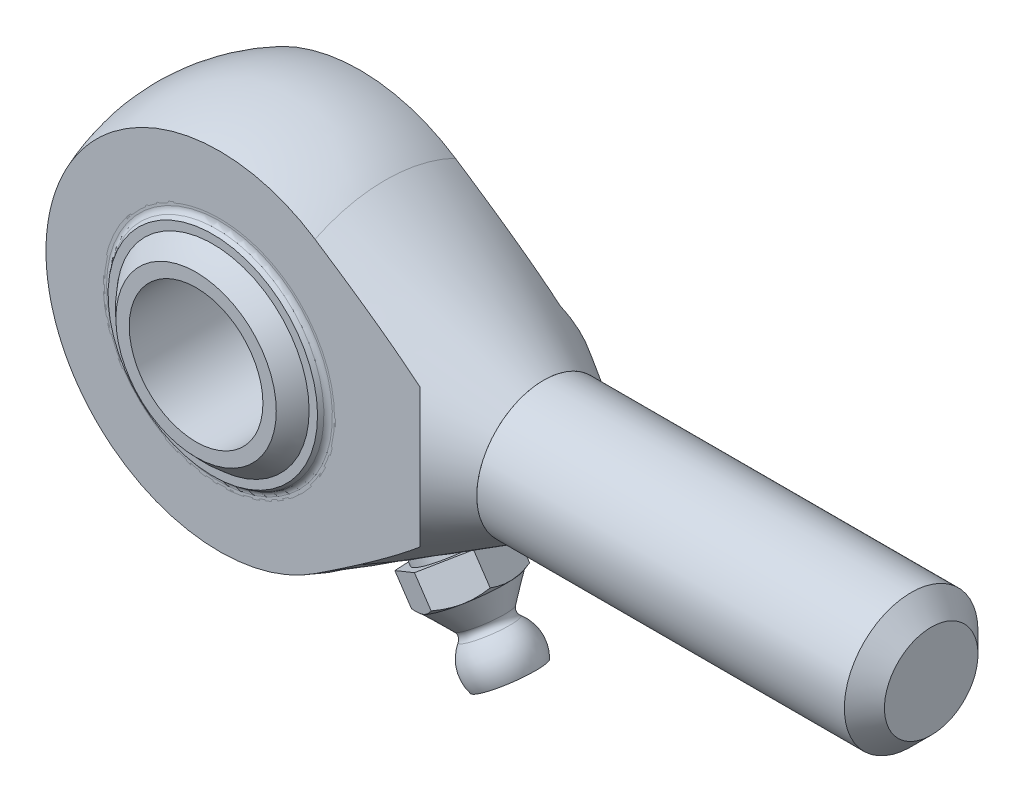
ISO-10303-21;
HEADER;
FILE_DESCRIPTION(('STEP AP214'),'2;1');
FILE_NAME('part.step','',(''),(''),'','','');
FILE_SCHEMA(('AUTOMOTIVE_DESIGN { 1 0 10303 214 1 1 1 1 }'));
ENDSEC;
DATA;
#1=APPLICATION_CONTEXT('core data for automotive mechanical design processes');
#2=APPLICATION_PROTOCOL_DEFINITION('international standard','automotive_design',2000,#1);
#3=PRODUCT_CONTEXT('',#1,'mechanical');
#4=PRODUCT('Part','Part','',(#3));
#5=PRODUCT_RELATED_PRODUCT_CATEGORY('part','',(#4));
#6=PRODUCT_DEFINITION_FORMATION('','',#4);
#7=PRODUCT_DEFINITION_CONTEXT('part definition',#1,'design');
#8=PRODUCT_DEFINITION('design','',#6,#7);
#9=PRODUCT_DEFINITION_SHAPE('','',#8);
#10=(LENGTH_UNIT() NAMED_UNIT(*) SI_UNIT(.MILLI.,.METRE.));
#11=(NAMED_UNIT(*) PLANE_ANGLE_UNIT() SI_UNIT($,.RADIAN.));
#12=(NAMED_UNIT(*) SI_UNIT($,.STERADIAN.) SOLID_ANGLE_UNIT());
#13=UNCERTAINTY_MEASURE_WITH_UNIT(LENGTH_MEASURE(1.E-05),#10,'distance_accuracy_value','');
#14=(GEOMETRIC_REPRESENTATION_CONTEXT(3) GLOBAL_UNCERTAINTY_ASSIGNED_CONTEXT((#13)) GLOBAL_UNIT_ASSIGNED_CONTEXT((#10,
#11,#12)) REPRESENTATION_CONTEXT('',''));
#15=CARTESIAN_POINT('',(0.,0.,0.));
#16=DIRECTION('',(0.,0.,1.));
#17=DIRECTION('',(1.,0.,0.));
#18=AXIS2_PLACEMENT_3D('',#15,#16,#17);
#19=CARTESIAN_POINT('',(-2.99722524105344,-9.22451078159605,1.36313712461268));
#20=DIRECTION('',(0.306009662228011,0.941800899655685,-0.139173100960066));
#21=DIRECTION('',(0.0430068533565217,0.132361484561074,0.99026806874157));
#22=AXIS2_PLACEMENT_3D('',#19,#20,#21);
#23=SPHERICAL_SURFACE('',#22,1.15);
#24=CARTESIAN_POINT('',(-2.64531412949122,-8.14143974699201,1.2030880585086));
#25=VERTEX_POINT('',#24);
#26=VERTEX_LOOP('',#25);
#27=FACE_BOUND('',#26,.T.);
#28=ADVANCED_FACE('P0_F12',(#27),#23,.T.);
#29=CLOSED_SHELL('',(#28));
#30=MANIFOLD_SOLID_BREP('P0_B1',#29);
#31=CARTESIAN_POINT('',(0.,9.69922462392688,1.36313712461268));
#32=DIRECTION('',(0.,-0.99026806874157,-0.139173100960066));
#33=DIRECTION('',(0.,-0.139173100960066,0.99026806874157));
#34=AXIS2_PLACEMENT_3D('',#31,#32,#33);
#35=SPHERICAL_SURFACE('',#34,1.15);
#36=CARTESIAN_POINT('',(0.,8.56041634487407,1.2030880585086));
#37=VERTEX_POINT('',#36);
#38=VERTEX_LOOP('',#37);
#39=FACE_BOUND('',#38,.T.);
#40=ADVANCED_FACE('P1_F12',(#39),#35,.T.);
#41=CLOSED_SHELL('',(#40));
#42=MANIFOLD_SOLID_BREP('P1_B1',#41);
#43=CARTESIAN_POINT('',(2.9972252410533,-9.22451078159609,-1.36313712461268));
#44=DIRECTION('',(-0.306009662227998,0.94180089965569,0.139173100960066));
#45=DIRECTION('',(-0.0430068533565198,0.132361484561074,-0.99026806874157));
#46=AXIS2_PLACEMENT_3D('',#43,#44,#45);
#47=SPHERICAL_SURFACE('',#46,1.15);
#48=CARTESIAN_POINT('',(2.64531412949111,-8.14143974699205,-1.2030880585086));
#49=VERTEX_POINT('',#48);
#50=VERTEX_LOOP('',#49);
#51=FACE_BOUND('',#50,.T.);
#52=ADVANCED_FACE('P2_F12',(#51),#47,.T.);
#53=CLOSED_SHELL('',(#52));
#54=MANIFOLD_SOLID_BREP('P2_B1',#53);
#55=CARTESIAN_POINT('',(0.,0.,0.));
#56=DIRECTION('',(0.,0.,1.));
#57=DIRECTION('',(0.999027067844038,0.044101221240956,0.));
#58=AXIS2_PLACEMENT_3D('',#55,#56,#57);
#59=CYLINDRICAL_SURFACE('',#58,8.7);
#60=CARTESIAN_POINT('',(0.,0.,-5.25));
#61=DIRECTION('',(0.,0.,1.));
#62=DIRECTION('',(0.999027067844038,0.044101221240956,0.));
#63=AXIS2_PLACEMENT_3D('',#60,#61,#62);
#64=CIRCLE('',#63,8.7);
#65=CARTESIAN_POINT('',(8.69153549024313,0.383680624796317,-5.25));
#66=VERTEX_POINT('',#65);
#67=EDGE_CURVE('P3_E34',#66,#66,#64,.T.);
#68=ORIENTED_EDGE('',*,*,#67,.T.);
#69=EDGE_LOOP('',(#68));
#70=FACE_BOUND('',#69,.T.);
#71=CARTESIAN_POINT('',(0.,0.,-4.75));
#72=DIRECTION('',(0.,0.,1.));
#73=DIRECTION('',(0.999027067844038,0.044101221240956,0.));
#74=AXIS2_PLACEMENT_3D('',#71,#72,#73);
#75=CIRCLE('',#74,8.7);
#76=CARTESIAN_POINT('',(8.69153549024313,0.383680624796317,-4.75));
#77=VERTEX_POINT('',#76);
#78=EDGE_CURVE('P3_E43',#77,#77,#75,.T.);
#79=ORIENTED_EDGE('',*,*,#78,.F.);
#80=EDGE_LOOP('',(#79));
#81=FACE_BOUND('',#80,.T.);
#82=ADVANCED_FACE('P3_F14',(#70,#81),#59,.T.);
#83=CARTESIAN_POINT('',(-0.383680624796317,8.69153549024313,-5.25));
#84=DIRECTION('',(0.,0.,-1.));
#85=DIRECTION('',(-0.999027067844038,-0.044101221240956,0.));
#86=AXIS2_PLACEMENT_3D('',#83,#84,#85);
#87=PLANE('',#86);
#88=CARTESIAN_POINT('',(0.,0.,-5.25));
#89=DIRECTION('',(0.,0.,-1.));
#90=DIRECTION('',(-0.999027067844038,-0.044101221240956,0.));
#91=AXIS2_PLACEMENT_3D('',#88,#89,#90);
#92=CIRCLE('',#91,8.44846666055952);
#93=CARTESIAN_POINT('',(-8.44024687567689,-0.372587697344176,-5.25));
#94=VERTEX_POINT('',#93);
#95=EDGE_CURVE('P3_E21',#94,#94,#92,.F.);
#96=ORIENTED_EDGE('',*,*,#95,.T.);
#97=EDGE_LOOP('',(#96));
#98=FACE_BOUND('',#97,.T.);
#99=ORIENTED_EDGE('',*,*,#67,.F.);
#100=EDGE_LOOP('',(#99));
#101=FACE_BOUND('',#100,.T.);
#102=ADVANCED_FACE('P3_F50',(#98,#101),#87,.T.);
#103=CARTESIAN_POINT('',(0.,0.,0.));
#104=DIRECTION('',(0.,0.,1.));
#105=DIRECTION('',(-0.044101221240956,0.999027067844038,0.));
#106=AXIS2_PLACEMENT_3D('',#103,#104,#105);
#107=SPHERICAL_SURFACE('',#106,9.71954445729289);
#108=CARTESIAN_POINT('',(0.,0.,-5.46867630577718));
#109=DIRECTION('',(0.,0.,1.));
#110=DIRECTION('',(0.999027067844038,0.044101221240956,0.));
#111=AXIS2_PLACEMENT_3D('',#108,#109,#110);
#112=CIRCLE('',#111,8.03511816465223);
#113=CARTESIAN_POINT('',(-0.354358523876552,8.02730053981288,-5.46867630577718));
#114=VERTEX_POINT('',#113);
#115=EDGE_CURVE('P3_E10',#114,#114,#112,.F.);
#116=CARTESIAN_POINT('',(0.,0.,-5.75));
#117=DIRECTION('',(0.,0.,1.));
#118=DIRECTION('',(0.999027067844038,0.044101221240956,0.));
#119=AXIS2_PLACEMENT_3D('',#116,#117,#118);
#120=CIRCLE('',#119,7.8362647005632);
#121=CARTESIAN_POINT('',(-0.345588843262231,7.82864054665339,-5.75));
#122=VERTEX_POINT('',#121);
#123=EDGE_CURVE('P3_E37',#122,#122,#120,.T.);
#124=CARTESIAN_POINT('',(-0.354358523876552,8.02730053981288,-5.46867630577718));
#125=CARTESIAN_POINT('',(-0.354269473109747,8.02528326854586,-5.47164316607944));
#126=CARTESIAN_POINT('',(-0.354180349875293,8.0232643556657,-5.47460890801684));
#127=CARTESIAN_POINT('',(-0.35400195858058,8.01922324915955,-5.48053815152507));
#128=CARTESIAN_POINT('',(-0.353912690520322,8.01720105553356,-5.48350165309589));
#129=CARTESIAN_POINT('',(-0.353734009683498,8.01315339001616,-5.4894264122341));
#130=CARTESIAN_POINT('',(-0.353644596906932,8.01112791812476,-5.49238766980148));
#131=CARTESIAN_POINT('',(-0.353465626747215,8.00707369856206,-5.49830793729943));
#132=CARTESIAN_POINT('',(-0.353376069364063,8.00504495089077,-5.50126694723));
#133=CARTESIAN_POINT('',(-0.35319681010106,8.00098418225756,-5.50718271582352));
#134=CARTESIAN_POINT('',(-0.353107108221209,7.99895216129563,-5.51013947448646));
#135=CARTESIAN_POINT('',(-0.352927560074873,7.9948848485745,-5.51605073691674));
#136=CARTESIAN_POINT('',(-0.352837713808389,7.9928495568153,-5.51900524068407));
#137=CARTESIAN_POINT('',(-0.35265787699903,7.98877570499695,-5.52491198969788));
#138=CARTESIAN_POINT('',(-0.352567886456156,7.98673714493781,-5.52786423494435));
#139=CARTESIAN_POINT('',(-0.352387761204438,7.98265675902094,-5.53376646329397));
#140=CARTESIAN_POINT('',(-0.352297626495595,7.98061493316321,-5.53671644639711));
#141=CARTESIAN_POINT('',(-0.352117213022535,7.97652801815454,-5.54261414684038));
#142=CARTESIAN_POINT('',(-0.352026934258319,7.9744829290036,-5.54556186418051));
#143=CARTESIAN_POINT('',(-0.351846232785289,7.97038948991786,-5.55145502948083));
#144=CARTESIAN_POINT('',(-0.351755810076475,7.96834113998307,-5.55440047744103));
#145=CARTESIAN_POINT('',(-0.351574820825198,7.964241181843,-5.56028910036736));
#146=CARTESIAN_POINT('',(-0.351484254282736,7.96218957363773,-5.56323227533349));
#147=CARTESIAN_POINT('',(-0.351302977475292,7.95808310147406,-5.56911634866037));
#148=CARTESIAN_POINT('',(-0.351212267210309,7.95602823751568,-5.57205724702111));
#149=CARTESIAN_POINT('',(-0.351030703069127,7.95191525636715,-5.57793676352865));
#150=CARTESIAN_POINT('',(-0.350939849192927,7.94985713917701,-5.58087538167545));
#151=CARTESIAN_POINT('',(-0.35075799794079,7.94573765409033,-5.58675033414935));
#152=CARTESIAN_POINT('',(-0.350667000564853,7.9436762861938,-5.58968666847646));
#153=CARTESIAN_POINT('',(-0.350484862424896,7.93955030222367,-5.59555704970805));
#154=CARTESIAN_POINT('',(-0.350393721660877,7.93748568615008,-5.59849109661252));
#155=CARTESIAN_POINT('',(-0.350211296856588,7.93335320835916,-5.6043568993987));
#156=CARTESIAN_POINT('',(-0.350120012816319,7.93128534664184,-5.6072886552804));
#157=CARTESIAN_POINT('',(-0.349937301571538,7.92714638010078,-5.6131498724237));
#158=CARTESIAN_POINT('',(-0.349845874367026,7.92507527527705,-5.6160793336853));
#159=CARTESIAN_POINT('',(-0.349662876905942,7.92092982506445,-5.62193595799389));
#160=CARTESIAN_POINT('',(-0.34957130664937,7.91885547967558,-5.62486312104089));
#161=CARTESIAN_POINT('',(-0.349388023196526,7.91470355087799,-5.63071514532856));
#162=CARTESIAN_POINT('',(-0.349296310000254,7.91262596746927,-5.63364000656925));
#163=CARTESIAN_POINT('',(-0.349112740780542,7.90846756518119,-5.63948742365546));
#164=CARTESIAN_POINT('',(-0.349020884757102,7.90638674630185,-5.64240997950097));
#165=CARTESIAN_POINT('',(-0.348837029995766,7.90222187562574,-5.6482527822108));
#166=CARTESIAN_POINT('',(-0.348745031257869,7.90013782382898,-5.65117302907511));
#167=CARTESIAN_POINT('',(-0.348560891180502,7.89596648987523,-5.65701121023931));
#168=CARTESIAN_POINT('',(-0.348468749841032,7.89387920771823,-5.65992914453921));
#169=CARTESIAN_POINT('',(-0.348284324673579,7.88970141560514,-5.66576269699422));
#170=CARTESIAN_POINT('',(-0.348192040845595,7.88761090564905,-5.66867831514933));
#171=CARTESIAN_POINT('',(-0.348007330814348,7.88342666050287,-5.67450723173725));
#172=CARTESIAN_POINT('',(-0.347914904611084,7.88133292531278,-5.67742053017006));
#173=CARTESIAN_POINT('',(-0.347729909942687,7.87714223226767,-5.68324480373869));
#174=CARTESIAN_POINT('',(-0.347637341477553,7.87504527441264,-5.6861557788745));
#175=CARTESIAN_POINT('',(-0.347452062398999,7.87084813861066,-5.69197540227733));
#176=CARTESIAN_POINT('',(-0.347359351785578,7.8687479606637,-5.69488405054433));
#177=CARTESIAN_POINT('',(-0.347173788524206,7.86454438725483,-5.70069901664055));
#178=CARTESIAN_POINT('',(-0.347080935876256,7.86244099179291,-5.70360533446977));
#179=CARTESIAN_POINT('',(-0.346895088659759,7.85823098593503,-5.7094156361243));
#180=CARTESIAN_POINT('',(-0.346802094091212,7.85612437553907,-5.71231961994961));
#181=CARTESIAN_POINT('',(-0.346615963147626,7.85190794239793,-5.71812525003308));
#182=CARTESIAN_POINT('',(-0.346522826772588,7.84979811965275,-5.72102689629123));
#183=CARTESIAN_POINT('',(-0.346336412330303,7.84557526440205,-5.72682784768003));
#184=CARTESIAN_POINT('',(-0.346243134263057,7.84346223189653,-5.72972715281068));
#185=CARTESIAN_POINT('',(-0.3460564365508,7.83923295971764,-5.73552341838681));
#186=CARTESIAN_POINT('',(-0.345963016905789,7.83711672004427,-5.73842037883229));
#187=CARTESIAN_POINT('',(-0.345776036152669,7.83288103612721,-5.74421195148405));
#188=CARTESIAN_POINT('',(-0.345682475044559,7.83076159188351,-5.74710656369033));
#189=CARTESIAN_POINT('',(-0.345588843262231,7.82864054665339,-5.75));
#190=B_SPLINE_CURVE_WITH_KNOTS('',3,(#124,#125,#126,#127,#128,#129,#130,#131,#132,#133,#134,
#135,#136,#137,#138,#139,#140,#141,#142,#143,#144,#145,#146,#147,#148,#149,#150,#151,#152,#153,
#154,#155,#156,#157,#158,#159,#160,#161,#162,#163,#164,#165,#166,#167,#168,#169,#170,#171,#172,
#173,#174,#175,#176,#177,#178,#179,#180,#181,#182,#183,#184,#185,#186,#187,#188,#189),
.UNSPECIFIED.,.F.,.F.,(4,2,2,2,2,2,2,2,2,2,2,2,2,2,2,2,2,2,2,2,2,2,2,2,2,2,2,2,2,2,2,2,4),(0.,
0.0107664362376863,0.0215328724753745,0.0322993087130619,0.0430657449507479,0.0538321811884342,
0.0645986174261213,0.0753650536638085,0.0861314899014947,0.096897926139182,0.107664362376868,
0.118430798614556,0.129197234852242,0.139963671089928,0.150730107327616,0.161496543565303,
0.17226297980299,0.183029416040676,0.193795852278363,0.204562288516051,0.215328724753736,
0.226095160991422,0.236861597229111,0.247628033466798,0.258394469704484,0.269160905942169,
0.279927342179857,0.290693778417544,0.30146021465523,0.312226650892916,0.322993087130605,
0.333759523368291,0.344525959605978),.UNSPECIFIED.);
#191=EDGE_CURVE('P3_BSEAM57',#114,#122,#190,.T.);
#192=ORIENTED_EDGE('',*,*,#115,.T.);
#193=ORIENTED_EDGE('',*,*,#123,.T.);
#194=ORIENTED_EDGE('',*,*,#191,.T.);
#195=ORIENTED_EDGE('',*,*,#191,.F.);
#196=EDGE_LOOP('',(#192,#194,#193,#195));
#197=FACE_BOUND('',#196,.T.);
#198=ADVANCED_FACE('P3_F57',(#197),#107,.T.);
#199=CARTESIAN_POINT('',(-0.317827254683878,7.19975595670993,-5.75));
#200=DIRECTION('',(0.,0.,-1.));
#201=DIRECTION('',(-0.999027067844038,-0.044101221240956,0.));
#202=AXIS2_PLACEMENT_3D('',#199,#200,#201);
#203=PLANE('',#202);
#204=CARTESIAN_POINT('',(0.,0.,-5.75));
#205=DIRECTION('',(0.,0.,1.));
#206=DIRECTION('',(0.999027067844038,0.044101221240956,0.));
#207=AXIS2_PLACEMENT_3D('',#204,#205,#206);
#208=CIRCLE('',#207,7.20676765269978);
#209=CARTESIAN_POINT('',(-0.317827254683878,7.19975595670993,-5.75));
#210=VERTEX_POINT('',#209);
#211=EDGE_CURVE('P3_E40',#210,#210,#208,.T.);
#212=ORIENTED_EDGE('',*,*,#211,.T.);
#213=EDGE_LOOP('',(#212));
#214=FACE_BOUND('',#213,.T.);
#215=ORIENTED_EDGE('',*,*,#123,.F.);
#216=EDGE_LOOP('',(#215));
#217=FACE_BOUND('',#216,.T.);
#218=ADVANCED_FACE('P3_F77',(#214,#217),#203,.T.);
#219=CARTESIAN_POINT('',(0.,0.,0.));
#220=DIRECTION('',(0.,0.,1.));
#221=DIRECTION('',(-0.044101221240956,0.999027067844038,0.));
#222=AXIS2_PLACEMENT_3D('',#219,#220,#221);
#223=SPHERICAL_SURFACE('',#222,9.21954445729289);
#224=CARTESIAN_POINT('',(0.,0.,-4.97992561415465));
#225=DIRECTION('',(0.,0.,1.));
#226=DIRECTION('',(0.999027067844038,0.044101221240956,0.));
#227=AXIS2_PLACEMENT_3D('',#224,#225,#226);
#228=CIRCLE('',#227,7.75888786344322);
#229=CARTESIAN_POINT('',(-0.342176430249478,7.75133899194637,-4.97992561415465));
#230=VERTEX_POINT('',#229);
#231=EDGE_CURVE('P3_E29',#230,#230,#228,.T.);
#232=CARTESIAN_POINT('',(-0.342176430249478,7.75133899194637,-4.97992561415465));
#233=CARTESIAN_POINT('',(-0.341941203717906,7.74601039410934,-4.98823583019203));
#234=CARTESIAN_POINT('',(-0.341705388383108,7.74066845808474,-4.9965374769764));
#235=CARTESIAN_POINT('',(-0.341232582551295,7.72995796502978,-5.01312354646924));
#236=CARTESIAN_POINT('',(-0.340995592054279,7.72458940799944,-5.02140796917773));
#237=CARTESIAN_POINT('',(-0.34052043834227,7.71382572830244,-5.03795950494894));
#238=CARTESIAN_POINT('',(-0.340282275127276,7.70843060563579,-5.04622661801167));
#239=CARTESIAN_POINT('',(-0.339804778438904,7.69761385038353,-5.06274344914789));
#240=CARTESIAN_POINT('',(-0.339565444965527,7.69219221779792,-5.07099316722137));
#241=CARTESIAN_POINT('',(-0.339085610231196,7.68132249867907,-5.08747512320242));
#242=CARTESIAN_POINT('',(-0.338845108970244,7.67587441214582,-5.09570736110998));
#243=CARTESIAN_POINT('',(-0.33836294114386,7.66495184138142,-5.1121542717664));
#244=CARTESIAN_POINT('',(-0.338121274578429,7.65947735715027,-5.12036894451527));
#245=CARTESIAN_POINT('',(-0.337636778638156,7.64850204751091,-5.13678064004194));
#246=CARTESIAN_POINT('',(-0.337393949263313,7.6430012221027,-5.14497766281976));
#247=CARTESIAN_POINT('',(-0.336907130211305,7.63197328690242,-5.16135397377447));
#248=CARTESIAN_POINT('',(-0.336663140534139,7.62644617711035,-5.16953326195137));
#249=CARTESIAN_POINT('',(-0.336174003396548,7.61536573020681,-5.18587401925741));
#250=CARTESIAN_POINT('',(-0.335928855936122,7.60981239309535,-5.19403548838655));
#251=CARTESIAN_POINT('',(-0.335437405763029,7.59867954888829,-5.21034052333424));
#252=CARTESIAN_POINT('',(-0.335191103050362,7.5931000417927,-5.21848408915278));
#253=CARTESIAN_POINT('',(-0.33469734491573,7.58191491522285,-5.23475323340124));
#254=CARTESIAN_POINT('',(-0.334449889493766,7.57630929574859,-5.24287881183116));
#255=CARTESIAN_POINT('',(-0.333953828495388,7.56507200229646,-5.2591118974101));
#256=CARTESIAN_POINT('',(-0.333705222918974,7.55944032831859,-5.26721940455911));
#257=CARTESIAN_POINT('',(-0.333206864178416,7.5481509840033,-5.2834162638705));
#258=CARTESIAN_POINT('',(-0.332957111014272,7.54249331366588,-5.29150561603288));
#259=CARTESIAN_POINT('',(-0.332456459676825,7.53115203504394,-5.30766608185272));
#260=CARTESIAN_POINT('',(-0.332205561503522,7.52546842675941,-5.31573719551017));
#261=CARTESIAN_POINT('',(-0.331702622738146,7.51407533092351,-5.3318611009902));
#262=CARTESIAN_POINT('',(-0.331450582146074,7.50836584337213,-5.33991389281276));
#263=CARTESIAN_POINT('',(-0.330945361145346,7.49692104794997,-5.35600107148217));
#264=CARTESIAN_POINT('',(-0.33069218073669,7.49118574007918,-5.36403545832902));
#265=CARTESIAN_POINT('',(-0.33018468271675,7.4796893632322,-5.38008574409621));
#266=CARTESIAN_POINT('',(-0.329930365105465,7.47392829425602,-5.38810164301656));
#267=CARTESIAN_POINT('',(-0.32942059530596,7.46238045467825,-5.40411487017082));
#268=CARTESIAN_POINT('',(-0.329165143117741,7.45659368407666,-5.41211219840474));
#269=CARTESIAN_POINT('',(-0.328653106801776,7.44499450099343,-5.42808820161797));
#270=CARTESIAN_POINT('',(-0.328396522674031,7.43918208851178,-5.43606687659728));
#271=CARTESIAN_POINT('',(-0.32788222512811,7.42753168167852,-5.4520054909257));
#272=CARTESIAN_POINT('',(-0.327624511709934,7.4216936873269,-5.45996543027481));
#273=CARTESIAN_POINT('',(-0.327107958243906,7.40999217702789,-5.47586649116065));
#274=CARTESIAN_POINT('',(-0.326849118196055,7.4041286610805,-5.48380761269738));
#275=CARTESIAN_POINT('',(-0.326330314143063,7.39237616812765,-5.49967095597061));
#276=CARTESIAN_POINT('',(-0.326070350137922,7.38648719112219,-5.5075931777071));
#277=CARTESIAN_POINT('',(-0.325549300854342,7.37468383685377,-5.52341863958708));
#278=CARTESIAN_POINT('',(-0.325288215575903,7.36876945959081,-5.53132187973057));
#279=CARTESIAN_POINT('',(-0.324764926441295,7.35691536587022,-5.54710929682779));
#280=CARTESIAN_POINT('',(-0.324502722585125,7.35097564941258,-5.55499347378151));
#281=CARTESIAN_POINT('',(-0.32397719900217,7.33907093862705,-5.57074268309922));
#282=CARTESIAN_POINT('',(-0.323713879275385,7.33310594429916,-5.57860771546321));
#283=CARTESIAN_POINT('',(-0.323186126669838,7.32115073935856,-5.59431855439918));
#284=CARTESIAN_POINT('',(-0.322921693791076,7.31516052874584,-5.60216436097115));
#285=CARTESIAN_POINT('',(-0.322391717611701,7.30315495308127,-5.61783666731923));
#286=CARTESIAN_POINT('',(-0.322126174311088,7.29713958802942,-5.62566316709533));
#287=CARTESIAN_POINT('',(-0.321593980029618,7.28508376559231,-5.64129677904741));
#288=CARTESIAN_POINT('',(-0.32132732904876,7.27904330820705,-5.64910389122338));
#289=CARTESIAN_POINT('',(-0.320792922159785,7.26693736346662,-5.66469864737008));
#290=CARTESIAN_POINT('',(-0.320525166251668,7.26087187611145,-5.6724862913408));
#291=CARTESIAN_POINT('',(-0.319988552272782,7.24871593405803,-5.68804203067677));
#292=CARTESIAN_POINT('',(-0.319719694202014,7.24262547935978,-5.69581012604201));
#293=CARTESIAN_POINT('',(-0.319180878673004,7.23041966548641,-5.71132668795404));
#294=CARTESIAN_POINT('',(-0.318910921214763,7.22430430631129,-5.71907515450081));
#295=CARTESIAN_POINT('',(-0.318369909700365,7.21204874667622,-5.73455237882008));
#296=CARTESIAN_POINT('',(-0.31809885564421,7.20590854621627,-5.74228113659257));
#297=CARTESIAN_POINT('',(-0.317827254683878,7.19975595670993,-5.75));
#298=B_SPLINE_CURVE_WITH_KNOTS('',3,(#232,#233,#234,#235,#236,#237,#238,#239,#240,#241,#242,
#243,#244,#245,#246,#247,#248,#249,#250,#251,#252,#253,#254,#255,#256,#257,#258,#259,#260,#261,
#262,#263,#264,#265,#266,#267,#268,#269,#270,#271,#272,#273,#274,#275,#276,#277,#278,#279,#280,
#281,#282,#283,#284,#285,#286,#287,#288,#289,#290,#291,#292,#293,#294,#295,#296,#297),
.UNSPECIFIED.,.F.,.F.,(4,2,2,2,2,2,2,2,2,2,2,2,2,2,2,2,2,2,2,2,2,2,2,2,2,2,2,2,2,2,2,2,4),(0.,
0.0296239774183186,0.0592479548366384,0.088871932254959,0.118495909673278,0.148119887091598,
0.177743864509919,0.207367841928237,0.236991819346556,0.266615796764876,0.296239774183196,
0.325863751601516,0.355487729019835,0.385111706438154,0.414735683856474,0.444359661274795,
0.473983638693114,0.503607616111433,0.533231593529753,0.562855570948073,0.592479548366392,
0.622103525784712,0.651727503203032,0.681351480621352,0.71097545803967,0.740599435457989,
0.77022341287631,0.799847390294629,0.829471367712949,0.859095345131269,0.888719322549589,
0.918343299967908,0.947967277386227),.UNSPECIFIED.);
#299=EDGE_CURVE('P3_BSEAM68',#230,#210,#298,.T.);
#300=ORIENTED_EDGE('',*,*,#231,.T.);
#301=ORIENTED_EDGE('',*,*,#211,.F.);
#302=ORIENTED_EDGE('',*,*,#299,.T.);
#303=ORIENTED_EDGE('',*,*,#299,.F.);
#304=EDGE_LOOP('',(#300,#302,#301,#303));
#305=FACE_BOUND('',#304,.T.);
#306=ADVANCED_FACE('P3_F68',(#305),#223,.F.);
#307=CARTESIAN_POINT('',(-0.383680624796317,8.69153549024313,-4.75));
#308=DIRECTION('',(0.,0.,1.));
#309=DIRECTION('',(0.999027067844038,0.044101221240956,0.));
#310=AXIS2_PLACEMENT_3D('',#307,#308,#309);
#311=PLANE('',#310);
#312=CARTESIAN_POINT('',(0.,0.,-4.75));
#313=DIRECTION('',(0.,0.,1.));
#314=DIRECTION('',(0.999027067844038,0.044101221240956,0.));
#315=AXIS2_PLACEMENT_3D('',#312,#313,#314);
#316=CIRCLE('',#315,8.17967263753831);
#317=CARTESIAN_POINT('',(8.171714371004,0.360733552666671,-4.75));
#318=VERTEX_POINT('',#317);
#319=EDGE_CURVE('P3_E25',#318,#318,#316,.F.);
#320=ORIENTED_EDGE('',*,*,#319,.T.);
#321=EDGE_LOOP('',(#320));
#322=FACE_BOUND('',#321,.T.);
#323=ORIENTED_EDGE('',*,*,#78,.T.);
#324=EDGE_LOOP('',(#323));
#325=FACE_BOUND('',#324,.T.);
#326=ADVANCED_FACE('P3_F47',(#322,#325),#311,.T.);
#327=CARTESIAN_POINT('',(0.,0.,-5.25));
#328=DIRECTION('',(0.,0.,1.));
#329=DIRECTION('',(0.999027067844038,0.044101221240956,0.));
#330=AXIS2_PLACEMENT_3D('',#327,#328,#329);
#331=TOROIDAL_SURFACE('',#330,8.17967263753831,0.5);
#332=ORIENTED_EDGE('',*,*,#319,.F.);
#333=EDGE_LOOP('',(#332));
#334=FACE_BOUND('',#333,.T.);
#335=ORIENTED_EDGE('',*,*,#231,.F.);
#336=EDGE_LOOP('',(#335));
#337=FACE_BOUND('',#336,.T.);
#338=ADVANCED_FACE('P3_F60',(#334,#337),#331,.T.);
#339=CARTESIAN_POINT('',(0.,0.,-5.75));
#340=DIRECTION('',(0.,0.,-1.));
#341=DIRECTION('',(-0.999027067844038,-0.044101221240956,0.));
#342=AXIS2_PLACEMENT_3D('',#339,#340,#341);
#343=TOROIDAL_SURFACE('',#342,8.44846666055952,0.5);
#344=ORIENTED_EDGE('',*,*,#115,.F.);
#345=EDGE_LOOP('',(#344));
#346=FACE_BOUND('',#345,.T.);
#347=ORIENTED_EDGE('',*,*,#95,.F.);
#348=EDGE_LOOP('',(#347));
#349=FACE_BOUND('',#348,.T.);
#350=ADVANCED_FACE('P3_F16',(#346,#349),#343,.F.);
#351=CLOSED_SHELL('',(#82,#102,#198,#218,#306,#326,#338,#350));
#352=MANIFOLD_SOLID_BREP('P3_B1',#351);
#353=CARTESIAN_POINT('',(-5.7010611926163,-7.84683755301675,1.36313712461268));
#354=DIRECTION('',(0.582064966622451,0.801143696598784,-0.139173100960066));
#355=DIRECTION('',(0.0818038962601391,0.112593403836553,0.99026806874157));
#356=AXIS2_PLACEMENT_3D('',#353,#354,#355);
#357=SPHERICAL_SURFACE('',#356,1.15);
#358=CARTESIAN_POINT('',(-5.03168648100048,-6.92552230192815,1.2030880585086));
#359=VERTEX_POINT('',#358);
#360=VERTEX_LOOP('',#359);
#361=FACE_BOUND('',#360,.T.);
#362=ADVANCED_FACE('P4_F12',(#361),#357,.T.);
#363=CLOSED_SHELL('',(#362));
#364=MANIFOLD_SOLID_BREP('P4_B1',#363);
#365=CARTESIAN_POINT('',(2.99722524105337,9.22451078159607,1.36313712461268));
#366=DIRECTION('',(-0.306009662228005,-0.941800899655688,-0.139173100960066));
#367=DIRECTION('',(-0.0430068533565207,-0.132361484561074,0.99026806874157));
#368=AXIS2_PLACEMENT_3D('',#365,#366,#367);
#369=SPHERICAL_SURFACE('',#368,1.15);
#370=CARTESIAN_POINT('',(2.64531412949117,8.14143974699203,1.2030880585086));
#371=VERTEX_POINT('',#370);
#372=VERTEX_LOOP('',#371);
#373=FACE_BOUND('',#372,.T.);
#374=ADVANCED_FACE('P5_F12',(#373),#369,.T.);
#375=CLOSED_SHELL('',(#374));
#376=MANIFOLD_SOLID_BREP('P5_B1',#375);
#377=CARTESIAN_POINT('',(0.,-9.69922462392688,-1.36313712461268));
#378=DIRECTION('',(0.,0.99026806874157,0.139173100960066));
#379=DIRECTION('',(0.,0.139173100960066,-0.99026806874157));
#380=AXIS2_PLACEMENT_3D('',#377,#378,#379);
#381=SPHERICAL_SURFACE('',#380,1.15);
#382=CARTESIAN_POINT('',(0.,-8.56041634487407,-1.2030880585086));
#383=VERTEX_POINT('',#382);
#384=VERTEX_LOOP('',#383);
#385=FACE_BOUND('',#384,.T.);
#386=ADVANCED_FACE('P6_F12',(#385),#381,.T.);
#387=CLOSED_SHELL('',(#386));
#388=MANIFOLD_SOLID_BREP('P6_B1',#387);
#389=CARTESIAN_POINT('',(-7.84683755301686,-5.70106119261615,1.36313712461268));
#390=DIRECTION('',(0.801143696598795,0.582064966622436,-0.139173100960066));
#391=DIRECTION('',(0.112593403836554,0.081803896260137,0.99026806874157));
#392=AXIS2_PLACEMENT_3D('',#389,#390,#391);
#393=SPHERICAL_SURFACE('',#392,1.15);
#394=CARTESIAN_POINT('',(-6.92552230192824,-5.03168648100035,1.2030880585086));
#395=VERTEX_POINT('',#394);
#396=VERTEX_LOOP('',#395);
#397=FACE_BOUND('',#396,.T.);
#398=ADVANCED_FACE('P7_F12',(#397),#393,.T.);
#399=CLOSED_SHELL('',(#398));
#400=MANIFOLD_SOLID_BREP('P7_B1',#399);
#401=CARTESIAN_POINT('',(5.70106119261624,7.8468375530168,1.36313712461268));
#402=DIRECTION('',(-0.582064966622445,-0.801143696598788,-0.139173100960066));
#403=DIRECTION('',(-0.0818038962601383,-0.112593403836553,0.99026806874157));
#404=AXIS2_PLACEMENT_3D('',#401,#402,#403);
#405=SPHERICAL_SURFACE('',#404,1.15);
#406=CARTESIAN_POINT('',(5.03168648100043,6.92552230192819,1.2030880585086));
#407=VERTEX_POINT('',#406);
#408=VERTEX_LOOP('',#407);
#409=FACE_BOUND('',#408,.T.);
#410=ADVANCED_FACE('P8_F12',(#409),#405,.T.);
#411=CLOSED_SHELL('',(#410));
#412=MANIFOLD_SOLID_BREP('P8_B1',#411);
#413=CARTESIAN_POINT('',(-2.99722524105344,-9.22451078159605,-1.36313712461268));
#414=DIRECTION('',(0.306009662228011,0.941800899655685,0.139173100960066));
#415=DIRECTION('',(0.0430068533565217,0.132361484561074,-0.99026806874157));
#416=AXIS2_PLACEMENT_3D('',#413,#414,#415);
#417=SPHERICAL_SURFACE('',#416,1.15);
#418=CARTESIAN_POINT('',(-2.64531412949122,-8.14143974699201,-1.2030880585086));
#419=VERTEX_POINT('',#418);
#420=VERTEX_LOOP('',#419);
#421=FACE_BOUND('',#420,.T.);
#422=ADVANCED_FACE('P9_F12',(#421),#417,.T.);
#423=CLOSED_SHELL('',(#422));
#424=MANIFOLD_SOLID_BREP('P9_B1',#423);
#425=CARTESIAN_POINT('',(0.,0.,0.));
#426=DIRECTION('',(0.,1.,0.));
#427=DIRECTION('',(1.,0.,0.));
#428=AXIS2_PLACEMENT_3D('',#425,#426,#427);
#429=SPHERICAL_SURFACE('',#428,9.21954445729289);
#430=CARTESIAN_POINT('',(0.,0.,0.));
#431=DIRECTION('',(0.,0.,1.));
#432=DIRECTION('',(1.,0.,0.));
#433=AXIS2_PLACEMENT_3D('',#430,#431,#432);
#434=SPHERICAL_SURFACE('',#433,9.21954445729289);
#435=CARTESIAN_POINT('',(0.,0.,2.23160101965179));
#436=DIRECTION('',(0.,0.,1.));
#437=DIRECTION('',(1.,0.,0.));
#438=AXIS2_PLACEMENT_3D('',#435,#436,#437);
#439=CIRCLE('',#438,8.94538746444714);
#440=CARTESIAN_POINT('',(8.94538746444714,0.,2.23160101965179));
#441=VERTEX_POINT('',#440);
#442=EDGE_CURVE('P10_E18',#441,#441,#439,.F.);
#443=ORIENTED_EDGE('',*,*,#442,.F.);
#444=EDGE_LOOP('',(#443));
#445=FACE_BOUND('',#444,.T.);
#446=CARTESIAN_POINT('',(0.,0.,7.));
#447=DIRECTION('',(0.,0.,-1.));
#448=DIRECTION('',(-1.,0.,0.));
#449=AXIS2_PLACEMENT_3D('',#446,#447,#448);
#450=CIRCLE('',#449,6.);
#451=CARTESIAN_POINT('',(-6.,0.,7.));
#452=VERTEX_POINT('',#451);
#453=EDGE_CURVE('P10_E27',#452,#452,#450,.F.);
#454=ORIENTED_EDGE('',*,*,#453,.F.);
#455=EDGE_LOOP('',(#454));
#456=FACE_BOUND('',#455,.T.);
#457=ADVANCED_FACE('P10_F14',(#445,#456),#434,.T.);
#458=CARTESIAN_POINT('',(0.,0.,0.));
#459=DIRECTION('',(0.,0.,-1.));
#460=DIRECTION('',(-1.,0.,0.));
#461=AXIS2_PLACEMENT_3D('',#458,#459,#460);
#462=SPHERICAL_SURFACE('',#461,9.21954445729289);
#463=CARTESIAN_POINT('',(0.,0.,-2.23160101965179));
#464=DIRECTION('',(0.,0.,-1.));
#465=DIRECTION('',(-1.,0.,0.));
#466=AXIS2_PLACEMENT_3D('',#463,#464,#465);
#467=CIRCLE('',#466,8.94538746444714);
#468=CARTESIAN_POINT('',(-8.94538746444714,0.,-2.23160101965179));
#469=VERTEX_POINT('',#468);
#470=EDGE_CURVE('P10_E34',#469,#469,#467,.F.);
#471=ORIENTED_EDGE('',*,*,#470,.F.);
#472=EDGE_LOOP('',(#471));
#473=FACE_BOUND('',#472,.T.);
#474=CARTESIAN_POINT('',(0.,0.,-7.));
#475=DIRECTION('',(0.,0.,1.));
#476=DIRECTION('',(1.,0.,0.));
#477=AXIS2_PLACEMENT_3D('',#474,#475,#476);
#478=CIRCLE('',#477,6.);
#479=CARTESIAN_POINT('',(6.,0.,-7.));
#480=VERTEX_POINT('',#479);
#481=EDGE_CURVE('P10_E10',#480,#480,#478,.F.);
#482=ORIENTED_EDGE('',*,*,#481,.F.);
#483=EDGE_LOOP('',(#482));
#484=FACE_BOUND('',#483,.T.);
#485=ADVANCED_FACE('P10_F50',(#473,#484),#462,.T.);
#486=CARTESIAN_POINT('',(0.,0.,0.));
#487=DIRECTION('',(0.,0.,-1.));
#488=DIRECTION('',(-1.,0.,0.));
#489=AXIS2_PLACEMENT_3D('',#486,#487,#488);
#490=SPHERICAL_SURFACE('',#489,9.21954445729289);
#491=CARTESIAN_POINT('',(0.,0.,0.320530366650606));
#492=DIRECTION('',(0.,0.,-1.));
#493=DIRECTION('',(-1.,0.,0.));
#494=AXIS2_PLACEMENT_3D('',#491,#492,#493);
#495=CIRCLE('',#494,9.21397092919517);
#496=CARTESIAN_POINT('',(-9.21397092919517,0.,0.320530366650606));
#497=VERTEX_POINT('',#496);
#498=EDGE_CURVE('P10_E39',#497,#497,#495,.F.);
#499=ORIENTED_EDGE('',*,*,#498,.F.);
#500=EDGE_LOOP('',(#499));
#501=FACE_BOUND('',#500,.T.);
#502=CARTESIAN_POINT('',(0.,0.,-0.320530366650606));
#503=DIRECTION('',(0.,0.,1.));
#504=DIRECTION('',(1.,0.,0.));
#505=AXIS2_PLACEMENT_3D('',#502,#503,#504);
#506=CIRCLE('',#505,9.21397092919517);
#507=CARTESIAN_POINT('',(9.21397092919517,0.,-0.320530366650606));
#508=VERTEX_POINT('',#507);
#509=EDGE_CURVE('P10_E35',#508,#508,#506,.F.);
#510=ORIENTED_EDGE('',*,*,#509,.F.);
#511=EDGE_LOOP('',(#510));
#512=FACE_BOUND('',#511,.T.);
#513=ADVANCED_FACE('P10_F16',(#501,#512),#490,.T.);
#514=CARTESIAN_POINT('',(0.,0.,-9.21954445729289));
#515=DIRECTION('',(0.,0.,1.));
#516=DIRECTION('',(1.,0.,0.));
#517=AXIS2_PLACEMENT_3D('',#514,#515,#516);
#518=CYLINDRICAL_SURFACE('',#517,5.);
#519=CARTESIAN_POINT('',(0.,0.,7.));
#520=DIRECTION('',(0.,0.,-1.));
#521=DIRECTION('',(-1.,0.,0.));
#522=AXIS2_PLACEMENT_3D('',#519,#520,#521);
#523=CIRCLE('',#522,5.);
#524=CARTESIAN_POINT('',(-5.,0.,7.));
#525=VERTEX_POINT('',#524);
#526=EDGE_CURVE('P10_E31',#525,#525,#523,.F.);
#527=ORIENTED_EDGE('',*,*,#526,.T.);
#528=EDGE_LOOP('',(#527));
#529=FACE_BOUND('',#528,.T.);
#530=CARTESIAN_POINT('',(0.,0.,-7.));
#531=DIRECTION('',(0.,0.,1.));
#532=DIRECTION('',(1.,0.,0.));
#533=AXIS2_PLACEMENT_3D('',#530,#531,#532);
#534=CIRCLE('',#533,5.);
#535=CARTESIAN_POINT('',(5.,0.,-7.));
#536=VERTEX_POINT('',#535);
#537=EDGE_CURVE('P10_E22',#536,#536,#534,.F.);
#538=ORIENTED_EDGE('',*,*,#537,.T.);
#539=EDGE_LOOP('',(#538));
#540=FACE_BOUND('',#539,.T.);
#541=ADVANCED_FACE('P10_F62',(#529,#540),#518,.F.);
#542=CARTESIAN_POINT('',(-9.21954445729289,-9.21954445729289,-7.));
#543=DIRECTION('',(0.,0.,1.));
#544=DIRECTION('',(1.,0.,0.));
#545=AXIS2_PLACEMENT_3D('',#542,#543,#544);
#546=PLANE('',#545);
#547=ORIENTED_EDGE('',*,*,#481,.T.);
#548=EDGE_LOOP('',(#547));
#549=FACE_BOUND('',#548,.T.);
#550=ORIENTED_EDGE('',*,*,#537,.F.);
#551=EDGE_LOOP('',(#550));
#552=FACE_BOUND('',#551,.T.);
#553=ADVANCED_FACE('P10_F58',(#549,#552),#546,.F.);
#554=CARTESIAN_POINT('',(-9.21954445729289,-9.21954445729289,7.));
#555=DIRECTION('',(0.,0.,-1.));
#556=DIRECTION('',(-1.,0.,0.));
#557=AXIS2_PLACEMENT_3D('',#554,#555,#556);
#558=PLANE('',#557);
#559=ORIENTED_EDGE('',*,*,#453,.T.);
#560=EDGE_LOOP('',(#559));
#561=FACE_BOUND('',#560,.T.);
#562=ORIENTED_EDGE('',*,*,#526,.F.);
#563=EDGE_LOOP('',(#562));
#564=FACE_BOUND('',#563,.T.);
#565=ADVANCED_FACE('P10_F54',(#561,#564),#558,.F.);
#566=CARTESIAN_POINT('',(0.,0.,-1.36313712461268));
#567=DIRECTION('',(0.,0.,-1.));
#568=DIRECTION('',(-1.,0.,0.));
#569=AXIS2_PLACEMENT_3D('',#566,#567,#568);
#570=TOROIDAL_SURFACE('',#569,9.69922462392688,1.15);
#571=ORIENTED_EDGE('',*,*,#470,.T.);
#572=EDGE_LOOP('',(#571));
#573=FACE_BOUND('',#572,.T.);
#574=ORIENTED_EDGE('',*,*,#509,.T.);
#575=EDGE_LOOP('',(#574));
#576=FACE_BOUND('',#575,.T.);
#577=ADVANCED_FACE('P10_F57',(#573,#576),#570,.F.);
#578=CARTESIAN_POINT('',(0.,0.,1.36313712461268));
#579=DIRECTION('',(0.,0.,-1.));
#580=DIRECTION('',(-1.,0.,0.));
#581=AXIS2_PLACEMENT_3D('',#578,#579,#580);
#582=TOROIDAL_SURFACE('',#581,9.69922462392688,1.15);
#583=ORIENTED_EDGE('',*,*,#442,.T.);
#584=EDGE_LOOP('',(#583));
#585=FACE_BOUND('',#584,.T.);
#586=ORIENTED_EDGE('',*,*,#498,.T.);
#587=EDGE_LOOP('',(#586));
#588=FACE_BOUND('',#587,.T.);
#589=ADVANCED_FACE('P10_F46',(#585,#588),#582,.F.);
#590=CLOSED_SHELL('',(#457,#485,#513,#541,#553,#565,#577,#589));
#591=MANIFOLD_SOLID_BREP('P10_B1',#590);
#592=CARTESIAN_POINT('',(-9.2245107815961,-2.99722524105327,1.36313712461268));
#593=DIRECTION('',(0.94180089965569,0.306009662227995,-0.139173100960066));
#594=DIRECTION('',(0.132361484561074,0.0430068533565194,0.99026806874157));
#595=AXIS2_PLACEMENT_3D('',#592,#593,#594);
#596=SPHERICAL_SURFACE('',#595,1.15);
#597=CARTESIAN_POINT('',(-8.14143974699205,-2.64531412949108,1.2030880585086));
#598=VERTEX_POINT('',#597);
#599=VERTEX_LOOP('',#598);
#600=FACE_BOUND('',#599,.T.);
#601=ADVANCED_FACE('P11_F12',(#600),#596,.T.);
#602=CLOSED_SHELL('',(#601));
#603=MANIFOLD_SOLID_BREP('P11_B1',#602);
#604=CARTESIAN_POINT('',(7.84683755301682,5.70106119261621,1.36313712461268));
#605=DIRECTION('',(-0.80114369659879,-0.582064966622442,-0.139173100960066));
#606=DIRECTION('',(-0.112593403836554,-0.0818038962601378,0.99026806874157));
#607=AXIS2_PLACEMENT_3D('',#604,#605,#606);
#608=SPHERICAL_SURFACE('',#607,1.15);
#609=CARTESIAN_POINT('',(6.92552230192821,5.0316864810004,1.2030880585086));
#610=VERTEX_POINT('',#609);
#611=VERTEX_LOOP('',#610);
#612=FACE_BOUND('',#611,.T.);
#613=ADVANCED_FACE('P12_F12',(#612),#608,.T.);
#614=CLOSED_SHELL('',(#613));
#615=MANIFOLD_SOLID_BREP('P12_B1',#614);
#616=CARTESIAN_POINT('',(-5.7010611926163,-7.84683755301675,-1.36313712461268));
#617=DIRECTION('',(0.582064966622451,0.801143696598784,0.139173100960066));
#618=DIRECTION('',(0.0818038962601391,0.112593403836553,-0.99026806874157));
#619=AXIS2_PLACEMENT_3D('',#616,#617,#618);
#620=SPHERICAL_SURFACE('',#619,1.15);
#621=CARTESIAN_POINT('',(-5.03168648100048,-6.92552230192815,-1.2030880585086));
#622=VERTEX_POINT('',#621);
#623=VERTEX_LOOP('',#622);
#624=FACE_BOUND('',#623,.T.);
#625=ADVANCED_FACE('P13_F12',(#624),#620,.T.);
#626=CLOSED_SHELL('',(#625));
#627=MANIFOLD_SOLID_BREP('P13_B1',#626);
#628=CARTESIAN_POINT('',(0.,9.69922462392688,-1.36313712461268));
#629=DIRECTION('',(0.,-0.99026806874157,0.139173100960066));
#630=DIRECTION('',(0.,-0.139173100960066,-0.99026806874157));
#631=AXIS2_PLACEMENT_3D('',#628,#629,#630);
#632=SPHERICAL_SURFACE('',#631,1.15);
#633=CARTESIAN_POINT('',(0.,8.56041634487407,-1.2030880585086));
#634=VERTEX_POINT('',#633);
#635=VERTEX_LOOP('',#634);
#636=FACE_BOUND('',#635,.T.);
#637=ADVANCED_FACE('P14_F12',(#636),#632,.T.);
#638=CLOSED_SHELL('',(#637));
#639=MANIFOLD_SOLID_BREP('P14_B1',#638);
#640=CARTESIAN_POINT('',(-9.69922462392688,1.01594044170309E-13,1.36313712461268));
#641=DIRECTION('',(0.99026806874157,0.,-0.139173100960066));
#642=DIRECTION('',(0.139173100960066,0.,0.99026806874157));
#643=AXIS2_PLACEMENT_3D('',#640,#641,#642);
#644=SPHERICAL_SURFACE('',#643,1.15);
#645=CARTESIAN_POINT('',(-8.56041634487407,0.,1.2030880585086));
#646=VERTEX_POINT('',#645);
#647=VERTEX_LOOP('',#646);
#648=FACE_BOUND('',#647,.T.);
#649=ADVANCED_FACE('P15_F12',(#648),#644,.T.);
#650=CLOSED_SHELL('',(#649));
#651=MANIFOLD_SOLID_BREP('P15_B1',#650);
#652=CARTESIAN_POINT('',(9.22451078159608,2.99722524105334,1.36313712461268));
#653=DIRECTION('',(-0.941800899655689,-0.306009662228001,-0.139173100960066));
#654=DIRECTION('',(-0.132361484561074,-0.0430068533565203,0.99026806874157));
#655=AXIS2_PLACEMENT_3D('',#652,#653,#654);
#656=SPHERICAL_SURFACE('',#655,1.15);
#657=CARTESIAN_POINT('',(8.14143974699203,2.64531412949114,1.2030880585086));
#658=VERTEX_POINT('',#657);
#659=VERTEX_LOOP('',#658);
#660=FACE_BOUND('',#659,.T.);
#661=ADVANCED_FACE('P16_F12',(#660),#656,.T.);
#662=CLOSED_SHELL('',(#661));
#663=MANIFOLD_SOLID_BREP('P16_B1',#662);
#664=CARTESIAN_POINT('',(-7.84683755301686,-5.70106119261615,-1.36313712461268));
#665=DIRECTION('',(0.801143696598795,0.582064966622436,0.139173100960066));
#666=DIRECTION('',(0.112593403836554,0.081803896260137,-0.99026806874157));
#667=AXIS2_PLACEMENT_3D('',#664,#665,#666);
#668=SPHERICAL_SURFACE('',#667,1.15);
#669=CARTESIAN_POINT('',(-6.92552230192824,-5.03168648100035,-1.2030880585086));
#670=VERTEX_POINT('',#669);
#671=VERTEX_LOOP('',#670);
#672=FACE_BOUND('',#671,.T.);
#673=ADVANCED_FACE('P17_F12',(#672),#668,.T.);
#674=CLOSED_SHELL('',(#673));
#675=MANIFOLD_SOLID_BREP('P17_B1',#674);
#676=CARTESIAN_POINT('',(2.99722524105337,9.22451078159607,-1.36313712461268));
#677=DIRECTION('',(-0.306009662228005,-0.941800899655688,0.139173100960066));
#678=DIRECTION('',(-0.0430068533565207,-0.132361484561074,-0.99026806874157));
#679=AXIS2_PLACEMENT_3D('',#676,#677,#678);
#680=SPHERICAL_SURFACE('',#679,1.15);
#681=CARTESIAN_POINT('',(2.64531412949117,8.14143974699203,-1.2030880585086));
#682=VERTEX_POINT('',#681);
#683=VERTEX_LOOP('',#682);
#684=FACE_BOUND('',#683,.T.);
#685=ADVANCED_FACE('P18_F12',(#684),#680,.T.);
#686=CLOSED_SHELL('',(#685));
#687=MANIFOLD_SOLID_BREP('P18_B1',#686);
#688=CARTESIAN_POINT('',(-9.22451078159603,2.99722524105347,1.36313712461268));
#689=DIRECTION('',(0.941800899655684,-0.306009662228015,-0.139173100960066));
#690=DIRECTION('',(0.132361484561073,-0.0430068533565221,0.99026806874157));
#691=AXIS2_PLACEMENT_3D('',#688,#689,#690);
#692=SPHERICAL_SURFACE('',#691,1.15);
#693=CARTESIAN_POINT('',(-8.141439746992,2.64531412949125,1.2030880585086));
#694=VERTEX_POINT('',#693);
#695=VERTEX_LOOP('',#694);
#696=FACE_BOUND('',#695,.T.);
#697=ADVANCED_FACE('P19_F12',(#696),#692,.T.);
#698=CLOSED_SHELL('',(#697));
#699=MANIFOLD_SOLID_BREP('P19_B1',#698);
#700=CARTESIAN_POINT('',(9.69922462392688,0.,1.36313712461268));
#701=DIRECTION('',(-0.99026806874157,0.,-0.139173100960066));
#702=DIRECTION('',(-0.139173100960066,0.,0.99026806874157));
#703=AXIS2_PLACEMENT_3D('',#700,#701,#702);
#704=SPHERICAL_SURFACE('',#703,1.15);
#705=CARTESIAN_POINT('',(8.56041634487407,0.,1.2030880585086));
#706=VERTEX_POINT('',#705);
#707=VERTEX_LOOP('',#706);
#708=FACE_BOUND('',#707,.T.);
#709=ADVANCED_FACE('P20_F12',(#708),#704,.T.);
#710=CLOSED_SHELL('',(#709));
#711=MANIFOLD_SOLID_BREP('P20_B1',#710);
#712=CARTESIAN_POINT('',(-9.2245107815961,-2.99722524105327,-1.36313712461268));
#713=DIRECTION('',(0.94180089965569,0.306009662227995,0.139173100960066));
#714=DIRECTION('',(0.132361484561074,0.0430068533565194,-0.99026806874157));
#715=AXIS2_PLACEMENT_3D('',#712,#713,#714);
#716=SPHERICAL_SURFACE('',#715,1.15);
#717=CARTESIAN_POINT('',(-8.14143974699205,-2.64531412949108,-1.2030880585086));
#718=VERTEX_POINT('',#717);
#719=VERTEX_LOOP('',#718);
#720=FACE_BOUND('',#719,.T.);
#721=ADVANCED_FACE('P21_F12',(#720),#716,.T.);
#722=CLOSED_SHELL('',(#721));
#723=MANIFOLD_SOLID_BREP('P21_B1',#722);
#724=CARTESIAN_POINT('',(5.70106119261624,7.8468375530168,-1.36313712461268));
#725=DIRECTION('',(-0.582064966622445,-0.801143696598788,0.139173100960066));
#726=DIRECTION('',(-0.0818038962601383,-0.112593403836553,-0.99026806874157));
#727=AXIS2_PLACEMENT_3D('',#724,#725,#726);
#728=SPHERICAL_SURFACE('',#727,1.15);
#729=CARTESIAN_POINT('',(5.03168648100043,6.92552230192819,-1.2030880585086));
#730=VERTEX_POINT('',#729);
#731=VERTEX_LOOP('',#730);
#732=FACE_BOUND('',#731,.T.);
#733=ADVANCED_FACE('P22_F12',(#732),#728,.T.);
#734=CLOSED_SHELL('',(#733));
#735=MANIFOLD_SOLID_BREP('P22_B1',#734);
#736=CARTESIAN_POINT('',(-7.84683755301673,5.70106119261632,1.36313712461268));
#737=DIRECTION('',(0.801143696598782,-0.582064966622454,-0.139173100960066));
#738=DIRECTION('',(0.112593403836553,-0.0818038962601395,0.99026806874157));
#739=AXIS2_PLACEMENT_3D('',#736,#737,#738);
#740=SPHERICAL_SURFACE('',#739,1.15);
#741=CARTESIAN_POINT('',(-6.92552230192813,5.0316864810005,1.2030880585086));
#742=VERTEX_POINT('',#741);
#743=VERTEX_LOOP('',#742);
#744=FACE_BOUND('',#743,.T.);
#745=ADVANCED_FACE('P23_F12',(#744),#740,.T.);
#746=CLOSED_SHELL('',(#745));
#747=MANIFOLD_SOLID_BREP('P23_B1',#746);
#748=CARTESIAN_POINT('',(9.22451078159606,-2.9972252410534,1.36313712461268));
#749=DIRECTION('',(-0.941800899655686,0.306009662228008,-0.139173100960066));
#750=DIRECTION('',(-0.132361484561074,0.0430068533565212,0.99026806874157));
#751=AXIS2_PLACEMENT_3D('',#748,#749,#750);
#752=SPHERICAL_SURFACE('',#751,1.15);
#753=CARTESIAN_POINT('',(8.14143974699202,-2.6453141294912,1.2030880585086));
#754=VERTEX_POINT('',#753);
#755=VERTEX_LOOP('',#754);
#756=FACE_BOUND('',#755,.T.);
#757=ADVANCED_FACE('P24_F12',(#756),#752,.T.);
#758=CLOSED_SHELL('',(#757));
#759=MANIFOLD_SOLID_BREP('P24_B1',#758);
#760=CARTESIAN_POINT('',(-9.69922462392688,1.01594044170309E-13,-1.36313712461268));
#761=DIRECTION('',(0.99026806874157,0.,0.139173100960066));
#762=DIRECTION('',(0.139173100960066,0.,-0.99026806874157));
#763=AXIS2_PLACEMENT_3D('',#760,#761,#762);
#764=SPHERICAL_SURFACE('',#763,1.15);
#765=CARTESIAN_POINT('',(-8.56041634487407,0.,-1.2030880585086));
#766=VERTEX_POINT('',#765);
#767=VERTEX_LOOP('',#766);
#768=FACE_BOUND('',#767,.T.);
#769=ADVANCED_FACE('P25_F12',(#768),#764,.T.);
#770=CLOSED_SHELL('',(#769));
#771=MANIFOLD_SOLID_BREP('P25_B1',#770);
#772=CARTESIAN_POINT('',(7.84683755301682,5.70106119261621,-1.36313712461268));
#773=DIRECTION('',(-0.80114369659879,-0.582064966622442,0.139173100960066));
#774=DIRECTION('',(-0.112593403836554,-0.0818038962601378,-0.99026806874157));
#775=AXIS2_PLACEMENT_3D('',#772,#773,#774);
#776=SPHERICAL_SURFACE('',#775,1.15);
#777=CARTESIAN_POINT('',(6.92552230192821,5.0316864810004,-1.2030880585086));
#778=VERTEX_POINT('',#777);
#779=VERTEX_LOOP('',#778);
#780=FACE_BOUND('',#779,.T.);
#781=ADVANCED_FACE('P26_F12',(#780),#776,.T.);
#782=CLOSED_SHELL('',(#781));
#783=MANIFOLD_SOLID_BREP('P26_B1',#782);
#784=CARTESIAN_POINT('',(12.2874939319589,-9.20214094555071,0.));
#785=DIRECTION('',(-0.559192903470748,0.829037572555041,0.));
#786=DIRECTION('',(0.291751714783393,0.196789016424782,-0.936031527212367));
#787=AXIS2_PLACEMENT_3D('',#784,#785,#786);
#788=CYLINDRICAL_SURFACE('',#787,2.5);
#789=CARTESIAN_POINT('',(10.3303187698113,-6.30050944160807,0.));
#790=DIRECTION('',(0.559192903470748,-0.829037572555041,0.));
#791=DIRECTION('',(-0.291751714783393,-0.196789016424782,0.936031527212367));
#792=AXIS2_PLACEMENT_3D('',#789,#790,#791);
#793=CIRCLE('',#792,2.5);
#794=CARTESIAN_POINT('',(9.60093948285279,-6.79248198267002,2.34007881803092));
#795=VERTEX_POINT('',#794);
#796=EDGE_CURVE('P27_E207',#795,#795,#793,.T.);
#797=ORIENTED_EDGE('',*,*,#796,.T.);
#798=EDGE_LOOP('',(#797));
#799=FACE_BOUND('',#798,.T.);
#800=CARTESIAN_POINT('',(12.2874939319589,-9.20214094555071,0.));
#801=DIRECTION('',(0.559192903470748,-0.829037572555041,0.));
#802=DIRECTION('',(-0.291751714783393,-0.196789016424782,0.936031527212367));
#803=AXIS2_PLACEMENT_3D('',#800,#801,#802);
#804=CIRCLE('',#803,2.5);
#805=CARTESIAN_POINT('',(11.5581146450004,-9.69411348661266,2.34007881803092));
#806=VERTEX_POINT('',#805);
#807=EDGE_CURVE('P27_E337',#806,#806,#804,.T.);
#808=ORIENTED_EDGE('',*,*,#807,.F.);
#809=EDGE_LOOP('',(#808));
#810=FACE_BOUND('',#809,.T.);
#811=ADVANCED_FACE('P27_F16',(#799,#810),#788,.T.);
#812=CARTESIAN_POINT('',(10.0507223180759,-5.88599065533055,0.));
#813=DIRECTION('',(0.559192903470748,-0.829037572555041,0.));
#814=DIRECTION('',(-0.291751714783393,-0.196789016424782,0.936031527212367));
#815=AXIS2_PLACEMENT_3D('',#812,#813,#814);
#816=PLANE('',#815);
#817=CARTESIAN_POINT('',(10.0507223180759,-5.88599065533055,0.));
#818=DIRECTION('',(0.559192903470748,-0.829037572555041,0.));
#819=DIRECTION('',(-0.291751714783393,-0.196789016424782,0.936031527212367));
#820=AXIS2_PLACEMENT_3D('',#817,#818,#819);
#821=CIRCLE('',#820,2.);
#822=CARTESIAN_POINT('',(9.46721888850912,-6.27956868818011,1.87206305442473));
#823=VERTEX_POINT('',#822);
#824=EDGE_CURVE('P27_E205',#823,#823,#821,.F.);
#825=ORIENTED_EDGE('',*,*,#824,.T.);
#826=EDGE_LOOP('',(#825));
#827=FACE_BOUND('',#826,.T.);
#828=CARTESIAN_POINT('',(10.0507223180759,-5.88599065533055,0.));
#829=DIRECTION('',(0.559192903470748,-0.829037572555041,0.));
#830=DIRECTION('',(-0.291751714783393,-0.196789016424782,0.936031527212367));
#831=AXIS2_PLACEMENT_3D('',#828,#829,#830);
#832=CIRCLE('',#831,1.);
#833=CARTESIAN_POINT('',(9.75897060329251,-6.08277967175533,0.936031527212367));
#834=VERTEX_POINT('',#833);
#835=EDGE_CURVE('P27_E280',#834,#834,#832,.T.);
#836=ORIENTED_EDGE('',*,*,#835,.T.);
#837=EDGE_LOOP('',(#836));
#838=FACE_BOUND('',#837,.T.);
#839=ADVANCED_FACE('P27_F180',(#827,#838),#816,.F.);
#840=CARTESIAN_POINT('',(10.068158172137,-10.6991018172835,2.19855792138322));
#841=DIRECTION('',(0.559192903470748,-0.829037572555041,0.));
#842=DIRECTION('',(-0.291751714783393,-0.196789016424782,0.936031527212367));
#843=AXIS2_PLACEMENT_3D('',#840,#841,#842);
#844=PLANE('',#843);
#845=DIRECTION('',(-0.776005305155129,-0.523422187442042,-0.351916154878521));
#846=VECTOR('',#845,1.);
#847=CARTESIAN_POINT('',(12.7563194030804,-8.8859141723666,3.41763124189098));
#848=LINE('',#847,#846);
#849=CARTESIAN_POINT('',(12.7563194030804,-8.8859141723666,3.41763124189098));
#850=VERTEX_POINT('',#849);
#851=CARTESIAN_POINT('',(10.068158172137,-10.6991018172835,2.19855792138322));
#852=VERTEX_POINT('',#851);
#853=EDGE_CURVE('P27_E314',#850,#852,#848,.T.);
#854=ORIENTED_EDGE('',*,*,#853,.F.);
#855=DIRECTION('',(-0.640667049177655,-0.432135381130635,0.634669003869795));
#856=VECTOR('',#855,1.);
#857=CARTESIAN_POINT('',(14.9756551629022,-7.3889533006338,1.21907332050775));
#858=LINE('',#857,#856);
#859=CARTESIAN_POINT('',(14.9756551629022,-7.3889533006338,1.21907332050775));
#860=VERTEX_POINT('',#859);
#861=EDGE_CURVE('P27_E347',#860,#850,#858,.T.);
#862=ORIENTED_EDGE('',*,*,#861,.F.);
#863=DIRECTION('',(0.135338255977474,0.091286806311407,0.986585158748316));
#864=VECTOR('',#863,1.);
#865=CARTESIAN_POINT('',(14.5068296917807,-7.70518007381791,-2.19855792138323));
#866=LINE('',#865,#864);
#867=CARTESIAN_POINT('',(14.5068296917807,-7.70518007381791,-2.19855792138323));
#868=VERTEX_POINT('',#867);
#869=EDGE_CURVE('P27_E349',#868,#860,#866,.T.);
#870=ORIENTED_EDGE('',*,*,#869,.F.);
#871=DIRECTION('',(0.776005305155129,0.523422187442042,0.351916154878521));
#872=VECTOR('',#871,1.);
#873=CARTESIAN_POINT('',(11.8186684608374,-9.51836771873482,-3.41763124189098));
#874=LINE('',#873,#872);
#875=CARTESIAN_POINT('',(11.8186684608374,-9.51836771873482,-3.41763124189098));
#876=VERTEX_POINT('',#875);
#877=EDGE_CURVE('P27_E352',#876,#868,#874,.T.);
#878=ORIENTED_EDGE('',*,*,#877,.F.);
#879=DIRECTION('',(0.640667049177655,0.432135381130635,-0.634669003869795));
#880=VECTOR('',#879,1.);
#881=CARTESIAN_POINT('',(9.59933270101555,-11.0153285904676,-1.21907332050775));
#882=LINE('',#881,#880);
#883=CARTESIAN_POINT('',(9.59933270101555,-11.0153285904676,-1.21907332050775));
#884=VERTEX_POINT('',#883);
#885=EDGE_CURVE('P27_E354',#884,#876,#882,.T.);
#886=ORIENTED_EDGE('',*,*,#885,.F.);
#887=DIRECTION('',(-0.135338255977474,-0.091286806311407,-0.986585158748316));
#888=VECTOR('',#887,1.);
#889=CARTESIAN_POINT('',(10.068158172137,-10.6991018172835,2.19855792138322));
#890=LINE('',#889,#888);
#891=EDGE_CURVE('P27_E355',#852,#884,#890,.T.);
#892=ORIENTED_EDGE('',*,*,#891,.F.);
#893=EDGE_LOOP('',(#854,#862,#870,#878,#886,#892));
#894=FACE_BOUND('',#893,.T.);
#895=ORIENTED_EDGE('',*,*,#807,.T.);
#896=EDGE_LOOP('',(#895));
#897=FACE_BOUND('',#896,.T.);
#898=ADVANCED_FACE('P27_F147',(#894,#897),#844,.F.);
#899=CARTESIAN_POINT('',(14.1543016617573,-10.9585081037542,3.41763124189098));
#900=DIRECTION('',(0.291751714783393,0.196789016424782,-0.936031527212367));
#901=DIRECTION('',(0.559192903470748,-0.829037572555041,0.));
#902=AXIS2_PLACEMENT_3D('',#899,#900,#901);
#903=PLANE('',#902);
#904=DIRECTION('',(-0.559192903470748,0.829037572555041,0.));
#905=VECTOR('',#904,1.);
#906=CARTESIAN_POINT('',(11.4661404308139,-12.7716957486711,2.19855792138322));
#907=LINE('',#906,#905);
#908=CARTESIAN_POINT('',(11.3163051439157,-12.5495558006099,2.19855792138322));
#909=VERTEX_POINT('',#908);
#910=EDGE_CURVE('P27_E300',#909,#852,#907,.T.);
#911=ORIENTED_EDGE('',*,*,#910,.F.);
#912=CARTESIAN_POINT('',(15.6143065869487,-8.19329714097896,4.45405155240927));
#913=CARTESIAN_POINT('',(15.5481104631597,-8.31486728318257,4.40786026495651));
#914=CARTESIAN_POINT('',(15.4813445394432,-8.43609267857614,4.36156385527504));
#915=CARTESIAN_POINT('',(15.3463600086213,-8.67765561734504,4.26870490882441));
#916=CARTESIAN_POINT('',(15.2781411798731,-8.79799302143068,4.22214233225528));
#917=CARTESIAN_POINT('',(15.1395883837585,-9.03818473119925,4.12845947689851));
#918=CARTESIAN_POINT('',(15.0692450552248,-9.1580330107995,4.08133754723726));
#919=CARTESIAN_POINT('',(14.9263828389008,-9.39627286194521,3.98672184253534));
#920=CARTESIAN_POINT('',(14.8538640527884,-9.5146645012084,3.93922808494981));
#921=CARTESIAN_POINT('',(14.7037231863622,-9.75339537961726,3.84224046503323));
#922=CARTESIAN_POINT('',(14.6260118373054,-9.87367272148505,3.79273179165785));
#923=CARTESIAN_POINT('',(14.4669712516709,-10.1116033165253,3.69313846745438));
#924=CARTESIAN_POINT('',(14.3856416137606,-10.2292562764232,3.64305375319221));
#925=CARTESIAN_POINT('',(14.2186352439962,-10.4608035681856,3.54231958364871));
#926=CARTESIAN_POINT('',(14.1329676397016,-10.5747050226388,3.49167147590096));
#927=CARTESIAN_POINT('',(13.9561031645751,-10.7977657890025,3.3896488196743));
#928=CARTESIAN_POINT('',(13.8649080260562,-10.9069265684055,3.33827450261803));
#929=CARTESIAN_POINT('',(13.6763751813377,-11.1184035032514,3.23505028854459));
#930=CARTESIAN_POINT('',(13.5790742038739,-11.220754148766,3.18320458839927));
#931=CARTESIAN_POINT('',(13.3769806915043,-11.4174578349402,3.0788595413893));
#932=CARTESIAN_POINT('',(13.2721889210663,-11.5118116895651,3.0263602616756));
#933=CARTESIAN_POINT('',(13.0561941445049,-11.6895961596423,2.92165985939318));
#934=CARTESIAN_POINT('',(12.9450948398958,-11.7731552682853,2.86946404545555));
#935=CARTESIAN_POINT('',(12.715671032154,-11.9296925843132,2.76504489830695));
#936=CARTESIAN_POINT('',(12.597346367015,-12.0026705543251,2.71282156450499));
#937=CARTESIAN_POINT('',(12.3912345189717,-12.1175359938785,2.62442951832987));
#938=CARTESIAN_POINT('',(12.3049953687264,-12.1621636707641,2.58816721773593));
#939=CARTESIAN_POINT('',(12.1300219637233,-12.2464771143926,2.51590389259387));
#940=CARTESIAN_POINT('',(12.041287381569,-12.2861622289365,2.47990290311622));
#941=CARTESIAN_POINT('',(11.7719442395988,-12.3984550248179,2.37234315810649));
#942=CARTESIAN_POINT('',(11.5882856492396,-12.4642516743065,2.30126567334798));
#943=CARTESIAN_POINT('',(11.307065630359,-12.5530188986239,2.19494998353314));
#944=CARTESIAN_POINT('',(11.2112641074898,-12.5812107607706,2.15916261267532));
#945=CARTESIAN_POINT('',(11.0186519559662,-12.6344447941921,2.08793552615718));
#946=CARTESIAN_POINT('',(10.9218413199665,-12.6594869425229,2.0524958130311));
#947=CARTESIAN_POINT('',(10.7274873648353,-12.7068851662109,1.98195273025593));
#948=CARTESIAN_POINT('',(10.629944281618,-12.7292420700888,1.94684925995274));
#949=CARTESIAN_POINT('',(10.4342670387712,-12.7716901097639,1.87693443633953));
#950=CARTESIAN_POINT('',(10.3361328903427,-12.7917812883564,1.84212307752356));
#951=CARTESIAN_POINT('',(10.0807581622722,-12.8414613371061,1.75208070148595));
#952=CARTESIAN_POINT('',(9.9231602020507,-12.869571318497,1.69704921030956));
#953=CARTESIAN_POINT('',(9.60715398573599,-12.9220553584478,1.58751909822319));
#954=CARTESIAN_POINT('',(9.44874565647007,-12.9464290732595,1.53302052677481));
#955=CARTESIAN_POINT('',(9.13131767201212,-12.9922779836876,1.42444221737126));
#956=CARTESIAN_POINT('',(8.97229785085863,-13.0137523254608,1.3703626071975));
#957=CARTESIAN_POINT('',(8.65384485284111,-13.0544115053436,1.26255588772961));
#958=CARTESIAN_POINT('',(8.49441166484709,-13.0735962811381,1.20882878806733));
#959=CARTESIAN_POINT('',(8.01521837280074,-13.1284939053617,1.04792746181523));
#960=CARTESIAN_POINT('',(7.69500398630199,-13.1614895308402,0.941182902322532));
#961=CARTESIAN_POINT('',(7.05393792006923,-13.2227524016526,0.728489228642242));
#962=CARTESIAN_POINT('',(6.73308636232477,-13.2510204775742,0.622539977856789));
#963=CARTESIAN_POINT('',(6.12262703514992,-13.3016634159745,0.421618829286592));
#964=CARTESIAN_POINT('',(5.83306131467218,-13.3243445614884,0.326595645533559));
#965=CARTESIAN_POINT('',(5.25366109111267,-13.3677523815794,0.136876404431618));
#966=CARTESIAN_POINT('',(4.96382657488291,-13.3884789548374,0.0421803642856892));
#967=CARTESIAN_POINT('',(4.38485362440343,-13.4283986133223,-0.146672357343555));
#968=CARTESIAN_POINT('',(4.09571574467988,-13.4475961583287,-0.240829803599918));
#969=CARTESIAN_POINT('',(3.51732117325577,-13.4848391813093,-0.428939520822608));
#970=CARTESIAN_POINT('',(3.22806449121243,-13.5028847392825,-0.522891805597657));
#971=CARTESIAN_POINT('',(2.93875990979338,-13.5205115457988,-0.616770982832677));
#972=B_SPLINE_CURVE_WITH_KNOTS('',3,(#912,#913,#914,#915,#916,#917,#918,#919,#920,#921,#922,
#923,#924,#925,#926,#927,#928,#929,#930,#931,#932,#933,#934,#935,#936,#937,#938,#939,#940,#941,
#942,#943,#944,#945,#946,#947,#948,#949,#950,#951,#952,#953,#954,#955,#956,#957,#958,#959,#960,
#961,#962,#963,#964,#965,#966,#967,#968,#969,#970,#971),.UNSPECIFIED.,.F.,.F.,(4,2,2,2,2,2,2,2,
2,2,2,2,2,2,2,2,2,2,2,2,2,2,2,2,2,2,2,2,2,4),(0.,0.437788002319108,0.875643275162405,
1.31584036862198,1.75601691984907,2.2105101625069,2.66505394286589,3.11867812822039,
3.5721608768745,4.02313767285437,4.47406851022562,4.91900709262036,5.36395565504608,
5.67476198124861,5.98560927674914,6.6076280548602,6.92584727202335,7.24406880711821,
7.56219190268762,7.88030898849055,8.38808558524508,8.89590887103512,9.40388138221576,
9.91186771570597,10.9292445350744,11.946442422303,12.8632373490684,13.7800797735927,
14.6941418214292,15.608140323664),.UNSPECIFIED.);
#973=CARTESIAN_POINT('',(12.8102210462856,-11.8651019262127,2.8080945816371));
#974=VERTEX_POINT('',#973);
#975=EDGE_CURVE('P27_E119',#909,#974,#972,.F.);
#976=ORIENTED_EDGE('',*,*,#975,.T.);
#977=CARTESIAN_POINT('',(14.0044663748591,-10.736368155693,3.41763124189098));
#978=VERTEX_POINT('',#977);
#979=EDGE_CURVE('P27_E127',#974,#978,#972,.F.);
#980=ORIENTED_EDGE('',*,*,#979,.T.);
#981=DIRECTION('',(-0.559192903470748,0.829037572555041,0.));
#982=VECTOR('',#981,1.);
#983=CARTESIAN_POINT('',(14.1543016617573,-10.9585081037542,3.41763124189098));
#984=LINE('',#983,#982);
#985=EDGE_CURVE('P27_E292',#978,#850,#984,.T.);
#986=ORIENTED_EDGE('',*,*,#985,.T.);
#987=ORIENTED_EDGE('',*,*,#853,.T.);
#988=EDGE_LOOP('',(#911,#976,#980,#986,#987));
#989=FACE_BOUND('',#988,.T.);
#990=ADVANCED_FACE('P27_F298',(#989),#903,.F.);
#991=CARTESIAN_POINT('',(11.4661404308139,-12.7716957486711,2.19855792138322));
#992=DIRECTION('',(0.817916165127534,0.551691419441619,-0.163247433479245));
#993=DIRECTION('',(0.135338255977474,0.091286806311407,0.986585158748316));
#994=AXIS2_PLACEMENT_3D('',#991,#992,#993);
#995=PLANE('',#994);
#996=DIRECTION('',(-0.559192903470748,0.829037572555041,0.));
#997=VECTOR('',#996,1.);
#998=CARTESIAN_POINT('',(10.9973149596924,-13.0879225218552,-1.21907332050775));
#999=LINE('',#998,#997);
#1000=CARTESIAN_POINT('',(10.8474796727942,-12.865782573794,-1.21907332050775));
#1001=VERTEX_POINT('',#1000);
#1002=EDGE_CURVE('P27_E308',#1001,#884,#999,.T.);
#1003=ORIENTED_EDGE('',*,*,#1002,.F.);
#1004=CARTESIAN_POINT('',(10.847411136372,-12.8657483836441,-1.21930116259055));
#1005=CARTESIAN_POINT('',(10.892597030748,-12.8882980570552,-1.06911312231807));
#1006=CARTESIAN_POINT('',(10.9357351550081,-12.9074281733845,-0.917628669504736));
#1007=CARTESIAN_POINT('',(11.0166816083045,-12.937010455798,-0.612036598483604));
#1008=CARTESIAN_POINT('',(11.0544768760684,-12.9474416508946,-0.457923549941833));
#1009=CARTESIAN_POINT('',(11.1224219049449,-12.9575342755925,-0.151607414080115));
#1010=CARTESIAN_POINT('',(11.1527377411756,-12.9574558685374,0.000548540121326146));
#1011=CARTESIAN_POINT('',(11.2058547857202,-12.9459462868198,0.305576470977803));
#1012=CARTESIAN_POINT('',(11.2286651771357,-12.9345290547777,0.458447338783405));
#1013=CARTESIAN_POINT('',(11.2640251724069,-12.9024267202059,0.744100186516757));
#1014=CARTESIAN_POINT('',(11.2775199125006,-12.8831301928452,0.876924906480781));
#1015=CARTESIAN_POINT('',(11.2988634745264,-12.836422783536,1.14170898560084));
#1016=CARTESIAN_POINT('',(11.306707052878,-12.8090043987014,1.27366742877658));
#1017=CARTESIAN_POINT('',(11.3174594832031,-12.746433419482,1.53899753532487));
#1018=CARTESIAN_POINT('',(11.3202550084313,-12.711122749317,1.67233561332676));
#1019=CARTESIAN_POINT('',(11.3213954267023,-12.6344915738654,1.93702295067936));
#1020=CARTESIAN_POINT('',(11.3197490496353,-12.5931830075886,2.06837560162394));
#1021=CARTESIAN_POINT('',(11.3162991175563,-12.5494794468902,2.19878576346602));
#1022=B_SPLINE_CURVE_WITH_KNOTS('',3,(#1004,#1005,#1006,#1007,#1008,#1009,#1010,#1011,#1012,
#1013,#1014,#1015,#1016,#1017,#1018,#1019,#1020,#1021),.UNSPECIFIED.,.F.,.F.,(4,2,2,2,2,2,2,2,
4),(0.,0.47553983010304,0.952222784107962,1.41710776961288,1.88142182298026,2.28572436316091,
2.69040156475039,3.10405572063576,3.5168974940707),.UNSPECIFIED.);
#1023=CARTESIAN_POINT('',(11.2317276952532,-12.9298091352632,0.489742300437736));
#1024=VERTEX_POINT('',#1023);
#1025=EDGE_CURVE('P27_E105',#1001,#1024,#1022,.T.);
#1026=ORIENTED_EDGE('',*,*,#1025,.T.);
#1027=EDGE_CURVE('P27_E116',#1024,#909,#1022,.T.);
#1028=ORIENTED_EDGE('',*,*,#1027,.T.);
#1029=ORIENTED_EDGE('',*,*,#910,.T.);
#1030=ORIENTED_EDGE('',*,*,#891,.T.);
#1031=EDGE_LOOP('',(#1003,#1026,#1028,#1029,#1030));
#1032=FACE_BOUND('',#1031,.T.);
#1033=ADVANCED_FACE('P27_F305',(#1032),#995,.F.);
#1034=CARTESIAN_POINT('',(10.9973149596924,-13.0879225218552,-1.21907332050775));
#1035=DIRECTION('',(0.52616445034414,0.354902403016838,0.772784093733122));
#1036=DIRECTION('',(-0.640667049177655,-0.432135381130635,0.634669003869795));
#1037=AXIS2_PLACEMENT_3D('',#1034,#1035,#1036);
#1038=PLANE('',#1037);
#1039=DIRECTION('',(-0.559192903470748,0.829037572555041,0.));
#1040=VECTOR('',#1039,1.);
#1041=CARTESIAN_POINT('',(13.2166507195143,-11.5909616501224,-3.41763124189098));
#1042=LINE('',#1041,#1040);
#1043=CARTESIAN_POINT('',(13.0668154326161,-11.3688217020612,-3.41763124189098));
#1044=VERTEX_POINT('',#1043);
#1045=EDGE_CURVE('P27_E341',#1044,#876,#1042,.T.);
#1046=ORIENTED_EDGE('',*,*,#1045,.F.);
#1047=CARTESIAN_POINT('',(13.0669261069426,-11.3686666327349,-3.41777781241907));
#1048=CARTESIAN_POINT('',(12.9939805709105,-11.4708969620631,-3.32116203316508));
#1049=CARTESIAN_POINT('',(12.9179675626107,-11.5703955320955,-3.22371227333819));
#1050=CARTESIAN_POINT('',(12.758548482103,-11.7621064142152,-3.0271252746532));
#1051=CARTESIAN_POINT('',(12.6751250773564,-11.8543006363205,-2.92798454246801));
#1052=CARTESIAN_POINT('',(12.5021350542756,-12.0269060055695,-2.73093175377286));
#1053=CARTESIAN_POINT('',(12.4127715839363,-12.1075523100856,-2.63305001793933));
#1054=CARTESIAN_POINT('',(12.2259668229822,-12.2578720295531,-2.43682592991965));
#1055=CARTESIAN_POINT('',(12.1285355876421,-12.3275587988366,-2.33848429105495));
#1056=CARTESIAN_POINT('',(11.9392133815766,-12.4470065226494,-2.15472416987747));
#1057=CARTESIAN_POINT('',(11.8482339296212,-12.498178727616,-2.06927819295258));
#1058=CARTESIAN_POINT('',(11.6613097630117,-12.5919496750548,-1.89894292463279));
#1059=CARTESIAN_POINT('',(11.5653605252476,-12.6345404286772,-1.81405422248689));
#1060=CARTESIAN_POINT('',(11.3674157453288,-12.7127374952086,-1.64336769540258));
#1061=CARTESIAN_POINT('',(11.2653332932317,-12.7481679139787,-1.5575914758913));
#1062=CARTESIAN_POINT('',(11.0582820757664,-12.8119637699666,-1.38731844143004));
#1063=CARTESIAN_POINT('',(10.953319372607,-12.840342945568,-1.30281944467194));
#1064=CARTESIAN_POINT('',(10.8472944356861,-12.8658270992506,-1.21892674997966));
#1065=B_SPLINE_CURVE_WITH_KNOTS('',3,(#1047,#1048,#1049,#1050,#1051,#1052,#1053,#1054,#1055,
#1056,#1057,#1058,#1059,#1060,#1061,#1062,#1063,#1064),.UNSPECIFIED.,.F.,.F.,(4,2,2,2,2,2,2,2,
4),(0.,0.475539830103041,0.952222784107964,1.41710776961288,1.88142182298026,2.28572436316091,
2.69040156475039,3.10405572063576,3.5168974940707),.UNSPECIFIED.);
#1066=CARTESIAN_POINT('',(12.1069828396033,-12.3394420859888,-2.31835228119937));
#1067=VERTEX_POINT('',#1066);
#1068=EDGE_CURVE('P27_E100',#1044,#1067,#1065,.T.);
#1069=ORIENTED_EDGE('',*,*,#1068,.T.);
#1070=EDGE_CURVE('P27_E104',#1067,#1001,#1065,.T.);
#1071=ORIENTED_EDGE('',*,*,#1070,.T.);
#1072=ORIENTED_EDGE('',*,*,#1002,.T.);
#1073=ORIENTED_EDGE('',*,*,#885,.T.);
#1074=EDGE_LOOP('',(#1046,#1069,#1071,#1072,#1073));
#1075=FACE_BOUND('',#1074,.T.);
#1076=ADVANCED_FACE('P27_F312',(#1075),#1038,.F.);
#1077=CARTESIAN_POINT('',(13.2166507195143,-11.5909616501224,-3.41763124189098));
#1078=DIRECTION('',(-0.291751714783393,-0.196789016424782,0.936031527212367));
#1079=DIRECTION('',(-0.776005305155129,-0.523422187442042,-0.351916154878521));
#1080=AXIS2_PLACEMENT_3D('',#1077,#1078,#1079);
#1081=PLANE('',#1080);
#1082=DIRECTION('',(-0.559192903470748,0.829037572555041,0.));
#1083=VECTOR('',#1082,1.);
#1084=CARTESIAN_POINT('',(15.9048119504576,-9.77777400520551,-2.19855792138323));
#1085=LINE('',#1084,#1083);
#1086=CARTESIAN_POINT('',(15.7549766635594,-9.55563405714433,-2.19855792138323));
#1087=VERTEX_POINT('',#1086);
#1088=EDGE_CURVE('P27_E115',#1087,#868,#1085,.T.);
#1089=ORIENTED_EDGE('',*,*,#1088,.F.);
#1090=CARTESIAN_POINT('',(17.3648168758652,-7.01256304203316,-1.16213761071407));
#1091=CARTESIAN_POINT('',(17.2986207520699,-7.13413318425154,-1.2083288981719));
#1092=CARTESIAN_POINT('',(17.2318548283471,-7.25535857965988,-1.25462530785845));
#1093=CARTESIAN_POINT('',(17.0968702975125,-7.4969215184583,-1.34748425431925));
#1094=CARTESIAN_POINT('',(17.0286514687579,-7.61725892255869,-1.39404683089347));
#1095=CARTESIAN_POINT('',(16.8900986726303,-7.8574506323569,-1.48772968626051));
#1096=CARTESIAN_POINT('',(16.8197553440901,-7.97729891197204,-1.53485161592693));
#1097=CARTESIAN_POINT('',(16.6768931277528,-8.21553876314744,-1.62946732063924));
#1098=CARTESIAN_POINT('',(16.6043743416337,-8.33393040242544,-1.67696107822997));
#1099=CARTESIAN_POINT('',(16.4542334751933,-8.5726612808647,-1.77394869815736));
#1100=CARTESIAN_POINT('',(16.376522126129,-8.69293862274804,-1.82345737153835));
#1101=CARTESIAN_POINT('',(16.2174815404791,-8.93086921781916,-1.92305069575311));
#1102=CARTESIAN_POINT('',(16.1361519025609,-9.04852217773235,-1.97313541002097));
#1103=CARTESIAN_POINT('',(15.9691455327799,-9.2800694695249,-2.07386957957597));
#1104=CARTESIAN_POINT('',(15.8834779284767,-9.39397092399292,-2.12451768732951));
#1105=CARTESIAN_POINT('',(15.7066134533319,-9.61703169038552,-2.22654034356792));
#1106=CARTESIAN_POINT('',(15.6154183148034,-9.72619246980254,-2.27791466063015));
#1107=CARTESIAN_POINT('',(15.4268854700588,-9.9376694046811,-2.38113887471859));
#1108=CARTESIAN_POINT('',(15.3295844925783,-10.040020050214,-2.43298457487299));
#1109=CARTESIAN_POINT('',(15.1274909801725,-10.2367237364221,-2.53732962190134));
#1110=CARTESIAN_POINT('',(15.0226992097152,-10.3310775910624,-2.58982890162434));
#1111=CARTESIAN_POINT('',(14.8067044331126,-10.5088620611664,-2.6945293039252));
#1112=CARTESIAN_POINT('',(14.6956051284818,-10.5924211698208,-2.74672511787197));
#1113=CARTESIAN_POINT('',(14.4661813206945,-10.7489584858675,-2.85114426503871));
#1114=CARTESIAN_POINT('',(14.3478566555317,-10.8219364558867,-2.90336759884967));
#1115=CARTESIAN_POINT('',(14.1417448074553,-10.936801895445,-2.99175964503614));
#1116=CARTESIAN_POINT('',(14.0555056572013,-10.9814295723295,-3.02802194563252));
#1117=CARTESIAN_POINT('',(13.8805322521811,-11.0657430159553,-3.10028527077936));
#1118=CARTESIAN_POINT('',(13.7917976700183,-11.1054281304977,-3.13628626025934));
#1119=CARTESIAN_POINT('',(13.5224545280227,-11.2177209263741,-3.24384600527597));
#1120=CARTESIAN_POINT('',(13.3387959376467,-11.283517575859,-3.31492349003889));
#1121=CARTESIAN_POINT('',(13.0575759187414,-11.3722848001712,-3.42123917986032));
#1122=CARTESIAN_POINT('',(12.9617743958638,-11.4004766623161,-3.45702655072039));
#1123=CARTESIAN_POINT('',(12.7691622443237,-11.4537106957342,-3.528253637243));
#1124=CARTESIAN_POINT('',(12.6723516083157,-11.4787528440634,-3.5636933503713));
#1125=CARTESIAN_POINT('',(12.4779976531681,-11.5261510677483,-3.63423643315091));
#1126=CARTESIAN_POINT('',(12.3804545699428,-11.5485079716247,-3.6693399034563));
#1127=CARTESIAN_POINT('',(12.18477732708,-11.590956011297,-3.73925472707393));
#1128=CARTESIAN_POINT('',(12.0866431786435,-11.6110471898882,-3.7740660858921));
#1129=CARTESIAN_POINT('',(11.8312684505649,-11.6607272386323,-3.86410846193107));
#1130=CARTESIAN_POINT('',(11.6736704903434,-11.6888372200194,-3.91913995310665));
#1131=CARTESIAN_POINT('',(11.3576642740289,-11.7413212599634,-4.02867006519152));
#1132=CARTESIAN_POINT('',(11.1992559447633,-11.7656949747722,-4.0831686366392));
#1133=CARTESIAN_POINT('',(10.8818279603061,-11.8115438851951,-4.19174694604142));
#1134=CARTESIAN_POINT('',(10.722808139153,-11.833018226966,-4.24582655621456));
#1135=CARTESIAN_POINT('',(10.4043551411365,-11.8736774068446,-4.35363327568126));
#1136=CARTESIAN_POINT('',(10.2449219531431,-11.8928621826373,-4.40736037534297));
#1137=CARTESIAN_POINT('',(9.76572866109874,-11.947759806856,-4.56826170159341));
#1138=CARTESIAN_POINT('',(9.44551427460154,-11.9807554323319,-4.67500626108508));
#1139=CARTESIAN_POINT('',(8.804448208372,-12.0420183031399,-4.88769993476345));
#1140=CARTESIAN_POINT('',(8.48359665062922,-12.0702863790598,-4.99364918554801));
#1141=CARTESIAN_POINT('',(7.87313732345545,-12.1209293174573,-5.1945703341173));
#1142=CARTESIAN_POINT('',(7.58357160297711,-12.1436104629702,-5.28959351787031));
#1143=CARTESIAN_POINT('',(7.00417137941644,-12.1870182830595,-5.47931275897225));
#1144=CARTESIAN_POINT('',(6.71433686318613,-12.2077448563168,-5.5740087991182));
#1145=CARTESIAN_POINT('',(6.13536391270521,-12.2476645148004,-5.76286152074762));
#1146=CARTESIAN_POINT('',(5.84622603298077,-12.2668620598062,-5.85701896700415));
#1147=CARTESIAN_POINT('',(5.2678314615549,-12.304105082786,-6.04512868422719));
#1148=CARTESIAN_POINT('',(4.97857477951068,-12.3221506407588,-6.13908096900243));
#1149=CARTESIAN_POINT('',(4.68927019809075,-12.3397774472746,-6.23296014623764));
#1150=B_SPLINE_CURVE_WITH_KNOTS('',3,(#1090,#1091,#1092,#1093,#1094,#1095,#1096,#1097,#1098,
#1099,#1100,#1101,#1102,#1103,#1104,#1105,#1106,#1107,#1108,#1109,#1110,#1111,#1112,#1113,#1114,
#1115,#1116,#1117,#1118,#1119,#1120,#1121,#1122,#1123,#1124,#1125,#1126,#1127,#1128,#1129,#1130,
#1131,#1132,#1133,#1134,#1135,#1136,#1137,#1138,#1139,#1140,#1141,#1142,#1143,#1144,#1145,#1146,
#1147,#1148,#1149),.UNSPECIFIED.,.F.,.F.,(4,2,2,2,2,2,2,2,2,2,2,2,2,2,2,2,2,2,2,2,2,2,2,2,2,2,2,
2,2,4),(0.,0.437788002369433,0.875643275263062,1.31584036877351,1.75601692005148,
2.21051016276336,2.66505394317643,3.11867812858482,3.57216087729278,4.02313767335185,
4.47406851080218,4.91900709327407,5.36395565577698,5.6747619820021,5.98560927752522,
6.60762805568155,6.9258472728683,7.24406880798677,7.56219190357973,7.88030898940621,
8.38808558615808,8.89590887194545,9.40388138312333,9.91186771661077,10.9292445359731,
11.9464424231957,12.8632373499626,13.7800797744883,14.6941418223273,15.6081403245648),.UNSPECIFIED.);
#1151=CARTESIAN_POINT('',(14.5607313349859,-10.684367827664,-2.8080945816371));
#1152=VERTEX_POINT('',#1151);
#1153=EDGE_CURVE('P27_E107',#1087,#1152,#1150,.T.);
#1154=ORIENTED_EDGE('',*,*,#1153,.T.);
#1155=EDGE_CURVE('P27_E98',#1152,#1044,#1150,.T.);
#1156=ORIENTED_EDGE('',*,*,#1155,.T.);
#1157=ORIENTED_EDGE('',*,*,#1045,.T.);
#1158=ORIENTED_EDGE('',*,*,#877,.T.);
#1159=EDGE_LOOP('',(#1089,#1154,#1156,#1157,#1158));
#1160=FACE_BOUND('',#1159,.T.);
#1161=ADVANCED_FACE('P27_F113',(#1160),#1081,.F.);
#1162=CARTESIAN_POINT('',(15.9048119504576,-9.77777400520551,-2.19855792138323));
#1163=DIRECTION('',(-0.817916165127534,-0.551691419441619,0.163247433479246));
#1164=DIRECTION('',(-0.135338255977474,-0.091286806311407,-0.986585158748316));
#1165=AXIS2_PLACEMENT_3D('',#1162,#1163,#1164);
#1166=PLANE('',#1165);
#1167=DIRECTION('',(-0.559192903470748,0.829037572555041,0.));
#1168=VECTOR('',#1167,1.);
#1169=CARTESIAN_POINT('',(16.3736374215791,-9.4615472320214,1.21907332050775));
#1170=LINE('',#1169,#1168);
#1171=CARTESIAN_POINT('',(16.2238021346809,-9.23940728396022,1.21907332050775));
#1172=VERTEX_POINT('',#1171);
#1173=EDGE_CURVE('P27_E344',#1172,#860,#1170,.T.);
#1174=ORIENTED_EDGE('',*,*,#1173,.F.);
#1175=CARTESIAN_POINT('',(16.2237961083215,-9.23933093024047,1.21930116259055));
#1176=CARTESIAN_POINT('',(16.2277768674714,-9.28967381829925,1.06911312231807));
#1177=CARTESIAN_POINT('',(16.2293541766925,-9.3368370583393,0.917628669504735));
#1178=CARTESIAN_POINT('',(16.2264593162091,-9.4229710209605,0.612036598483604));
#1179=CARTESIAN_POINT('',(16.2219725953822,-9.46192177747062,0.457923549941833));
#1180=CARTESIAN_POINT('',(16.2058776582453,-9.52870007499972,0.151607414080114));
#1181=CARTESIAN_POINT('',(16.1944484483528,-9.55677905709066,-0.000548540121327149));
#1182=CARTESIAN_POINT('',(16.1638789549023,-9.60171675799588,-0.305576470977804));
#1183=CARTESIAN_POINT('',(16.1447481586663,-9.61858921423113,-0.458447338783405));
#1184=CARTESIAN_POINT('',(16.1017373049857,-9.63934868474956,-0.744100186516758));
#1185=CARTESIAN_POINT('',(16.0787906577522,-9.6446321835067,-0.876924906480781));
#1186=CARTESIAN_POINT('',(16.0274888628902,-9.64692468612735,-1.14170898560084));
#1187=CARTESIAN_POINT('',(15.9991287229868,-9.64392601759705,-1.27366742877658));
#1188=CARTESIAN_POINT('',(15.937085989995,-9.63045599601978,-1.53899753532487));
#1189=CARTESIAN_POINT('',(15.9032992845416,-9.61982035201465,-1.67233561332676));
#1190=CARTESIAN_POINT('',(15.8318208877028,-9.59217118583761,-1.93702295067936));
#1191=CARTESIAN_POINT('',(15.7941369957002,-9.57517023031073,-2.06837560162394));
#1192=CARTESIAN_POINT('',(15.7549081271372,-9.55559986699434,-2.19878576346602));
#1193=B_SPLINE_CURVE_WITH_KNOTS('',3,(#1175,#1176,#1177,#1178,#1179,#1180,#1181,#1182,#1183,
#1184,#1185,#1186,#1187,#1188,#1189,#1190,#1191,#1192),.UNSPECIFIED.,.F.,.F.,(4,2,2,2,2,2,2,2,
4),(0.,0.475539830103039,0.952222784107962,1.41710776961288,1.88142182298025,2.28572436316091,
2.69040156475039,3.10405572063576,3.5168974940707),.UNSPECIFIED.);
#1194=CARTESIAN_POINT('',(16.1392246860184,-9.61966061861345,-0.489742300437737));
#1195=VERTEX_POINT('',#1194);
#1196=EDGE_CURVE('P27_E37',#1172,#1195,#1193,.T.);
#1197=ORIENTED_EDGE('',*,*,#1196,.T.);
#1198=EDGE_CURVE('P27_E111',#1195,#1087,#1193,.T.);
#1199=ORIENTED_EDGE('',*,*,#1198,.T.);
#1200=ORIENTED_EDGE('',*,*,#1088,.T.);
#1201=ORIENTED_EDGE('',*,*,#869,.T.);
#1202=EDGE_LOOP('',(#1174,#1197,#1199,#1200,#1201));
#1203=FACE_BOUND('',#1202,.T.);
#1204=ADVANCED_FACE('P27_F164',(#1203),#1166,.F.);
#1205=CARTESIAN_POINT('',(16.3736374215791,-9.4615472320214,1.21907332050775));
#1206=DIRECTION('',(-0.52616445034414,-0.354902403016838,-0.772784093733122));
#1207=DIRECTION('',(0.640667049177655,0.432135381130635,-0.634669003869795));
#1208=AXIS2_PLACEMENT_3D('',#1205,#1206,#1207);
#1209=PLANE('',#1208);
#1210=ORIENTED_EDGE('',*,*,#985,.F.);
#1211=CARTESIAN_POINT('',(14.0042811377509,-10.7364126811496,3.41777781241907));
#1212=CARTESIAN_POINT('',(14.1263933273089,-10.7070749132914,3.32116203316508));
#1213=CARTESIAN_POINT('',(14.2471217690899,-10.6738696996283,3.22371227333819));
#1214=CARTESIAN_POINT('',(14.4845924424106,-10.5978750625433,3.0271252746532));
#1215=CARTESIAN_POINT('',(14.6013243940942,-10.5550627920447,2.92798454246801));
#1216=CARTESIAN_POINT('',(14.8261645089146,-10.4593283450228,2.73093175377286));
#1217=CARTESIAN_POINT('',(14.9344146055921,-10.4066826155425,2.63305001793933));
#1218=CARTESIAN_POINT('',(15.1437669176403,-10.2897910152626,2.43682592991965));
#1219=CARTESIAN_POINT('',(15.2448777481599,-10.2255594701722,2.33848429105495));
#1220=CARTESIAN_POINT('',(15.426549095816,-10.0947688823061,2.15472416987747));
#1221=CARTESIAN_POINT('',(15.5080766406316,-10.0295836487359,2.06927819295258));
#1222=CARTESIAN_POINT('',(15.6650425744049,-9.89139779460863,1.89894292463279));
#1223=CARTESIAN_POINT('',(15.7404752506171,-9.81838998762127,1.81405422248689));
#1224=CARTESIAN_POINT('',(15.8871297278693,-9.6641519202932,1.64336769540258));
#1225=CARTESIAN_POINT('',(15.9582209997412,-9.58277518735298,1.5575914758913));
#1226=CARTESIAN_POINT('',(16.0949342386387,-9.41469898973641,1.38731844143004));
#1227=CARTESIAN_POINT('',(16.1605666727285,-9.32801029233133,1.30281944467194));
#1228=CARTESIAN_POINT('',(16.2239128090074,-9.2392522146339,1.21892674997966));
#1229=B_SPLINE_CURVE_WITH_KNOTS('',3,(#1211,#1212,#1213,#1214,#1215,#1216,#1217,#1218,#1219,
#1220,#1221,#1222,#1223,#1224,#1225,#1226,#1227,#1228),.UNSPECIFIED.,.F.,.F.,(4,2,2,2,2,2,2,2,
4),(0.,0.475539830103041,0.952222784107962,1.41710776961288,1.88142182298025,2.28572436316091,
2.69040156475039,3.10405572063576,3.5168974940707),.UNSPECIFIED.);
#1230=CARTESIAN_POINT('',(15.2639695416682,-10.2100276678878,2.31835228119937));
#1231=VERTEX_POINT('',#1230);
#1232=EDGE_CURVE('P27_E163',#978,#1231,#1229,.T.);
#1233=ORIENTED_EDGE('',*,*,#1232,.T.);
#1234=EDGE_CURVE('P27_E152',#1231,#1172,#1229,.T.);
#1235=ORIENTED_EDGE('',*,*,#1234,.T.);
#1236=ORIENTED_EDGE('',*,*,#1173,.T.);
#1237=ORIENTED_EDGE('',*,*,#861,.T.);
#1238=EDGE_LOOP('',(#1210,#1233,#1235,#1236,#1237));
#1239=FACE_BOUND('',#1238,.T.);
#1240=ADVANCED_FACE('P27_F167',(#1239),#1209,.F.);
#1241=CARTESIAN_POINT('',(12.7169256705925,-9.83879967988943,0.));
#1242=DIRECTION('',(-0.559192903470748,0.829037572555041,0.));
#1243=DIRECTION('',(0.291751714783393,0.196789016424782,-0.936031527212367));
#1244=AXIS2_PLACEMENT_3D('',#1241,#1242,#1243);
#1245=CONICAL_SURFACE('',#1244,6.,1.0471975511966);
#1246=CARTESIAN_POINT('',(13.6854761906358,-11.2747348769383,0.));
#1247=DIRECTION('',(0.559192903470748,-0.829037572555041,0.));
#1248=DIRECTION('',(-0.291751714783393,-0.196789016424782,0.936031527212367));
#1249=AXIS2_PLACEMENT_3D('',#1246,#1247,#1248);
#1250=CIRCLE('',#1249,3.);
#1251=EDGE_CURVE('P27_E279',#974,#1024,#1250,.T.);
#1252=ORIENTED_EDGE('',*,*,#1251,.F.);
#1253=ORIENTED_EDGE('',*,*,#975,.F.);
#1254=ORIENTED_EDGE('',*,*,#1027,.F.);
#1255=EDGE_LOOP('',(#1252,#1253,#1254));
#1256=FACE_BOUND('',#1255,.T.);
#1257=ADVANCED_FACE('P27_F171',(#1256),#1245,.T.);
#1258=CARTESIAN_POINT('',(13.6854761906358,-11.2747348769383,0.));
#1259=DIRECTION('',(0.559192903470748,-0.829037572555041,0.));
#1260=DIRECTION('',(-0.291751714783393,-0.196789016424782,0.936031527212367));
#1261=AXIS2_PLACEMENT_3D('',#1258,#1259,#1260);
#1262=CIRCLE('',#1261,3.);
#1263=EDGE_CURVE('P27_E92',#1067,#1024,#1262,.F.);
#1264=ORIENTED_EDGE('',*,*,#1263,.T.);
#1265=ORIENTED_EDGE('',*,*,#1025,.F.);
#1266=ORIENTED_EDGE('',*,*,#1070,.F.);
#1267=EDGE_LOOP('',(#1264,#1265,#1266));
#1268=FACE_BOUND('',#1267,.T.);
#1269=ADVANCED_FACE('P27_F144',(#1268),#1245,.T.);
#1270=ORIENTED_EDGE('',*,*,#1155,.F.);
#1271=EDGE_CURVE('P27_E85',#1152,#1067,#1262,.F.);
#1272=ORIENTED_EDGE('',*,*,#1271,.T.);
#1273=ORIENTED_EDGE('',*,*,#1068,.F.);
#1274=EDGE_LOOP('',(#1270,#1272,#1273));
#1275=FACE_BOUND('',#1274,.T.);
#1276=ADVANCED_FACE('P27_F99',(#1275),#1245,.T.);
#1277=ORIENTED_EDGE('',*,*,#1198,.F.);
#1278=EDGE_CURVE('P27_E89',#1195,#1152,#1262,.F.);
#1279=ORIENTED_EDGE('',*,*,#1278,.T.);
#1280=ORIENTED_EDGE('',*,*,#1153,.F.);
#1281=EDGE_LOOP('',(#1277,#1279,#1280));
#1282=FACE_BOUND('',#1281,.T.);
#1283=ADVANCED_FACE('P27_F109',(#1282),#1245,.T.);
#1284=ORIENTED_EDGE('',*,*,#1234,.F.);
#1285=EDGE_CURVE('P27_E31',#1231,#1195,#1262,.F.);
#1286=ORIENTED_EDGE('',*,*,#1285,.T.);
#1287=ORIENTED_EDGE('',*,*,#1196,.F.);
#1288=EDGE_LOOP('',(#1284,#1286,#1287));
#1289=FACE_BOUND('',#1288,.T.);
#1290=ADVANCED_FACE('P27_F145',(#1289),#1245,.T.);
#1291=EDGE_CURVE('P27_E208',#974,#1231,#1262,.F.);
#1292=ORIENTED_EDGE('',*,*,#1291,.T.);
#1293=ORIENTED_EDGE('',*,*,#1232,.F.);
#1294=ORIENTED_EDGE('',*,*,#979,.F.);
#1295=EDGE_LOOP('',(#1292,#1293,#1294));
#1296=FACE_BOUND('',#1295,.T.);
#1297=ADVANCED_FACE('P27_F219',(#1296),#1245,.T.);
#1298=CARTESIAN_POINT('',(13.6854761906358,-11.2747348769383,0.));
#1299=DIRECTION('',(-0.559192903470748,0.829037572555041,0.));
#1300=DIRECTION('',(0.291751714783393,0.196789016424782,-0.936031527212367));
#1301=AXIS2_PLACEMENT_3D('',#1298,#1299,#1300);
#1302=CONICAL_SURFACE('',#1301,3.,0.643501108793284);
#1303=CARTESIAN_POINT('',(14.5989558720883,-12.6290241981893,0.));
#1304=DIRECTION('',(-0.559192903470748,0.829037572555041,0.));
#1305=DIRECTION('',(0.291751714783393,0.196789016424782,-0.936031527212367));
#1306=AXIS2_PLACEMENT_3D('',#1303,#1304,#1305);
#1307=CIRCLE('',#1306,1.77482393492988);
#1308=CARTESIAN_POINT('',(15.1167637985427,-12.2797583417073,-1.66129115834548));
#1309=VERTEX_POINT('',#1308);
#1310=EDGE_CURVE('P27_E24',#1309,#1309,#1307,.T.);
#1311=ORIENTED_EDGE('',*,*,#1310,.T.);
#1312=EDGE_LOOP('',(#1311));
#1313=FACE_BOUND('',#1312,.T.);
#1314=ORIENTED_EDGE('',*,*,#1271,.F.);
#1315=ORIENTED_EDGE('',*,*,#1278,.F.);
#1316=ORIENTED_EDGE('',*,*,#1285,.F.);
#1317=ORIENTED_EDGE('',*,*,#1291,.F.);
#1318=ORIENTED_EDGE('',*,*,#1251,.T.);
#1319=ORIENTED_EDGE('',*,*,#1263,.F.);
#1320=EDGE_LOOP('',(#1314,#1315,#1316,#1317,#1318,#1319));
#1321=FACE_BOUND('',#1320,.T.);
#1322=ADVANCED_FACE('P27_F87',(#1313,#1321),#1302,.T.);
#1323=CARTESIAN_POINT('',(15.9222478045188,-14.5908851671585,0.));
#1324=DIRECTION('',(-0.559192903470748,0.829037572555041,0.));
#1325=DIRECTION('',(0.291751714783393,0.196789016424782,-0.936031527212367));
#1326=AXIS2_PLACEMENT_3D('',#1323,#1324,#1325);
#1327=SPHERICAL_SURFACE('',#1326,2.5);
#1328=CARTESIAN_POINT('',(14.9593027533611,-13.1632604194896,0.));
#1329=DIRECTION('',(0.559192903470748,-0.829037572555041,0.));
#1330=DIRECTION('',(-0.291751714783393,-0.196789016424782,0.936031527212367));
#1331=AXIS2_PLACEMENT_3D('',#1328,#1329,#1330);
#1332=CIRCLE('',#1331,1.81235327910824);
#1333=CARTESIAN_POINT('',(15.4880599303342,-12.8066092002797,-1.69641980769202));
#1334=VERTEX_POINT('',#1333);
#1335=EDGE_CURVE('P27_E11',#1334,#1334,#1332,.T.);
#1336=CARTESIAN_POINT('',(16.4814407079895,-15.4199227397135,0.));
#1337=DIRECTION('',(-0.559192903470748,0.829037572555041,0.));
#1338=DIRECTION('',(0.291751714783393,0.196789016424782,-0.936031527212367));
#1339=AXIS2_PLACEMENT_3D('',#1336,#1337,#1338);
#1340=CIRCLE('',#1339,2.29128784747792);
#1341=CARTESIAN_POINT('',(17.1499278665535,-14.9690224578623,-2.14471766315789));
#1342=VERTEX_POINT('',#1341);
#1343=EDGE_CURVE('P27_E277',#1342,#1342,#1340,.T.);
#1344=CARTESIAN_POINT('',(15.4880599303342,-12.8066092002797,-1.69641980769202));
#1345=CARTESIAN_POINT('',(15.5065559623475,-12.8208073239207,-1.71608757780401));
#1346=CARTESIAN_POINT('',(15.525149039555,-12.8354042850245,-1.73537613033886));
#1347=CARTESIAN_POINT('',(15.562504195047,-12.8653755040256,-1.7731697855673));
#1348=CARTESIAN_POINT('',(15.5812662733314,-12.8807497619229,-1.7916748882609));
#1349=CARTESIAN_POINT('',(15.6189343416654,-12.9122551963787,-1.82787662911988));
#1350=CARTESIAN_POINT('',(15.637840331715,-12.9283863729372,-1.84557326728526));
#1351=CARTESIAN_POINT('',(15.6757708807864,-12.9613839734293,-1.88013442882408));
#1352=CARTESIAN_POINT('',(15.6947954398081,-12.9782503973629,-1.89699895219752));
#1353=CARTESIAN_POINT('',(15.7329376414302,-13.0126959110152,-1.92987327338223));
#1354=CARTESIAN_POINT('',(15.7520552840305,-13.030275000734,-1.94588307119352));
#1355=CARTESIAN_POINT('',(15.7903580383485,-13.0661222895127,-1.9770264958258));
#1356=CARTESIAN_POINT('',(15.8095431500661,-13.0843904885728,-1.99216012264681));
#1357=CARTESIAN_POINT('',(15.8479551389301,-13.1215915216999,-2.0215309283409));
#1358=CARTESIAN_POINT('',(15.8671820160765,-13.1405243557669,-2.03576810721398));
#1359=CARTESIAN_POINT('',(15.9056517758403,-13.1790292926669,-2.06332694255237));
#1360=CARTESIAN_POINT('',(15.9248946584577,-13.1986013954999,-2.07664859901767));
#1361=CARTESIAN_POINT('',(15.9633706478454,-13.238358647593,-2.10235854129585));
#1362=CARTESIAN_POINT('',(15.9826037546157,-13.2585437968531,-2.11474682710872));
#1363=CARTESIAN_POINT('',(16.0210344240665,-13.299500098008,-2.13857343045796));
#1364=CARTESIAN_POINT('',(16.0402319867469,-13.3202712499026,-2.15001174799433));
#1365=CARTESIAN_POINT('',(16.0785658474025,-13.3623717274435,-2.17192308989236));
#1366=CARTESIAN_POINT('',(16.0977021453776,-13.3837010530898,-2.18239611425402));
#1367=CARTESIAN_POINT('',(16.1358878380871,-13.4268893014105,-2.20236283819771));
#1368=CARTESIAN_POINT('',(16.1549372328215,-13.4487482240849,-2.21185653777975));
#1369=CARTESIAN_POINT('',(16.1929235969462,-13.4929663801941,-2.22985189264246));
#1370=CARTESIAN_POINT('',(16.2118605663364,-13.5153256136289,-2.23835354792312));
#1371=CARTESIAN_POINT('',(16.2495967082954,-13.5605144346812,-2.25435342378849));
#1372=CARTESIAN_POINT('',(16.268395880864,-13.5833440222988,-2.26185164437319));
#1373=CARTESIAN_POINT('',(16.3058312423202,-13.6294429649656,-2.27583460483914));
#1374=CARTESIAN_POINT('',(16.3244674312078,-13.6527123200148,-2.28231934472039));
#1375=CARTESIAN_POINT('',(16.3615518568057,-13.6996596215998,-2.29426665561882));
#1376=CARTESIAN_POINT('',(16.3800000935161,-13.7233375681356,-2.29972922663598));
#1377=CARTESIAN_POINT('',(16.416683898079,-13.7710703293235,-2.30962488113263));
#1378=CARTESIAN_POINT('',(16.4349194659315,-13.7951251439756,-2.3140579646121));
#1379=CARTESIAN_POINT('',(16.4711535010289,-13.8435794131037,-2.32188870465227));
#1380=CARTESIAN_POINT('',(16.4891519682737,-13.8679788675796,-2.32528636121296));
#1381=CARTESIAN_POINT('',(16.5248876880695,-13.9170897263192,-2.33104169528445));
#1382=CARTESIAN_POINT('',(16.5426249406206,-13.9418011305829,-2.33339937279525));
#1383=CARTESIAN_POINT('',(16.5778144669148,-13.9915027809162,-2.33707158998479));
#1384=CARTESIAN_POINT('',(16.5952667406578,-14.0164930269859,-2.33838612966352));
#1385=CARTESIAN_POINT('',(16.6298629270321,-14.0667188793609,-2.33997030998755));
#1386=CARTESIAN_POINT('',(16.6470068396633,-14.0919544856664,-2.34023995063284));
#1387=CARTESIAN_POINT('',(16.680963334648,-14.142637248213,-2.33973397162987));
#1388=CARTESIAN_POINT('',(16.6977759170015,-14.1680844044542,-2.33895835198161));
#1389=CARTESIAN_POINT('',(16.7310472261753,-14.2191561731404,-2.33636289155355));
#1390=CARTESIAN_POINT('',(16.7475059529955,-14.2447807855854,-2.33454305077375));
#1391=CARTESIAN_POINT('',(16.7800474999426,-14.2961731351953,-2.32986158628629));
#1392=CARTESIAN_POINT('',(16.7961303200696,-14.3219408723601,-2.32699996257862));
#1393=CARTESIAN_POINT('',(16.8278985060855,-14.3735849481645,-2.32023876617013));
#1394=CARTESIAN_POINT('',(16.8435838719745,-14.3994612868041,-2.31633919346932));
#1395=CARTESIAN_POINT('',(16.874536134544,-14.4512878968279,-2.30750732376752));
#1396=CARTESIAN_POINT('',(16.8898030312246,-14.4772381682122,-2.30257502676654));
#1397=CARTESIAN_POINT('',(16.919897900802,-14.5291778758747,-2.29168431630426));
#1398=CARTESIAN_POINT('',(16.9347258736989,-14.555167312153,-2.28572590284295));
#1399=CARTESIAN_POINT('',(16.9639230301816,-14.6071505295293,-2.27279094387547));
#1400=CARTESIAN_POINT('',(16.9782922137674,-14.6331443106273,-2.26581439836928));
#1401=CARTESIAN_POINT('',(17.0065525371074,-14.6851013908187,-2.25085251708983));
#1402=CARTESIAN_POINT('',(17.0204436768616,-14.711064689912,-2.24286718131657));
#1403=CARTESIAN_POINT('',(17.0477293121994,-14.7629260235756,-2.22589843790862));
#1404=CARTESIAN_POINT('',(17.061123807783,-14.7888240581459,-2.21691503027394));
#1405=CARTESIAN_POINT('',(17.0873981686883,-14.8405201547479,-2.19796210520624));
#1406=CARTESIAN_POINT('',(17.10027803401,-14.8663182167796,-2.18799258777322));
#1407=CARTESIAN_POINT('',(17.1255060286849,-14.9177798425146,-2.16708107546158));
#1408=CARTESIAN_POINT('',(17.1378541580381,-14.9434434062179,-2.15613908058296));
#1409=CARTESIAN_POINT('',(17.1499278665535,-14.9690224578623,-2.1447176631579));
#1410=B_SPLINE_CURVE_WITH_KNOTS('',3,(#1344,#1345,#1346,#1347,#1348,#1349,#1350,#1351,#1352,
#1353,#1354,#1355,#1356,#1357,#1358,#1359,#1360,#1361,#1362,#1363,#1364,#1365,#1366,#1367,#1368,
#1369,#1370,#1371,#1372,#1373,#1374,#1375,#1376,#1377,#1378,#1379,#1380,#1381,#1382,#1383,#1384,
#1385,#1386,#1387,#1388,#1389,#1390,#1391,#1392,#1393,#1394,#1395,#1396,#1397,#1398,#1399,#1400,
#1401,#1402,#1403,#1404,#1405,#1406,#1407,#1408,#1409),.UNSPECIFIED.,.F.,.F.,(4,2,2,2,2,2,2,2,2,
2,2,2,2,2,2,2,2,2,2,2,2,2,2,2,2,2,2,2,2,2,2,2,4),(0.,0.0915077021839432,0.183015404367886,
0.27452310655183,0.366030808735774,0.457538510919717,0.549046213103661,0.640553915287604,
0.732061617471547,0.823569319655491,0.915077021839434,1.00658472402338,1.09809242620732,
1.18960012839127,1.28110783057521,1.37261553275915,1.4641232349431,1.55563093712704,
1.64713863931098,1.73864634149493,1.83015404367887,1.92166174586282,2.01316944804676,
2.1046771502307,2.19618485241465,2.28769255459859,2.37920025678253,2.47070795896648,
2.56221566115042,2.65372336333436,2.74523106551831,2.83673876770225,2.92824646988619),.UNSPECIFIED.);
#1411=EDGE_CURVE('P27_BSEAM218',#1334,#1342,#1410,.T.);
#1412=ORIENTED_EDGE('',*,*,#1335,.T.);
#1413=ORIENTED_EDGE('',*,*,#1343,.T.);
#1414=ORIENTED_EDGE('',*,*,#1411,.T.);
#1415=ORIENTED_EDGE('',*,*,#1411,.F.);
#1416=EDGE_LOOP('',(#1412,#1414,#1413,#1415));
#1417=FACE_BOUND('',#1416,.T.);
#1418=ADVANCED_FACE('P27_F218',(#1417),#1327,.T.);
#1419=CARTESIAN_POINT('',(17.1499278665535,-14.9690224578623,-2.14471766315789));
#1420=DIRECTION('',(0.559192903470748,-0.829037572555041,0.));
#1421=DIRECTION('',(-0.291751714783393,-0.196789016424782,0.936031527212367));
#1422=AXIS2_PLACEMENT_3D('',#1419,#1420,#1421);
#1423=PLANE('',#1422);
#1424=CARTESIAN_POINT('',(16.4814407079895,-15.4199227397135,0.));
#1425=DIRECTION('',(0.559192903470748,-0.829037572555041,0.));
#1426=DIRECTION('',(-0.291751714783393,-0.196789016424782,0.936031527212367));
#1427=AXIS2_PLACEMENT_3D('',#1424,#1425,#1426);
#1428=CIRCLE('',#1427,1.);
#1429=CARTESIAN_POINT('',(16.1896889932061,-15.6167117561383,0.936031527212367));
#1430=VERTEX_POINT('',#1429);
#1431=EDGE_CURVE('P27_E274',#1430,#1430,#1428,.T.);
#1432=ORIENTED_EDGE('',*,*,#1431,.F.);
#1433=EDGE_LOOP('',(#1432));
#1434=FACE_BOUND('',#1433,.T.);
#1435=ORIENTED_EDGE('',*,*,#1343,.F.);
#1436=EDGE_LOOP('',(#1435));
#1437=FACE_BOUND('',#1436,.T.);
#1438=ADVANCED_FACE('P27_F199',(#1434,#1437),#1423,.T.);
#1439=CARTESIAN_POINT('',(10.0507223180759,-5.88599065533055,0.));
#1440=DIRECTION('',(0.559192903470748,-0.829037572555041,0.));
#1441=DIRECTION('',(-0.291751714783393,-0.196789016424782,0.936031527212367));
#1442=AXIS2_PLACEMENT_3D('',#1439,#1440,#1441);
#1443=CYLINDRICAL_SURFACE('',#1442,1.);
#1444=ORIENTED_EDGE('',*,*,#835,.F.);
#1445=EDGE_LOOP('',(#1444));
#1446=FACE_BOUND('',#1445,.T.);
#1447=ORIENTED_EDGE('',*,*,#1431,.T.);
#1448=EDGE_LOOP('',(#1447));
#1449=FACE_BOUND('',#1448,.T.);
#1450=ADVANCED_FACE('P27_F192',(#1446,#1449),#1443,.F.);
#1451=CARTESIAN_POINT('',(10.3303187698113,-6.30050944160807,0.));
#1452=DIRECTION('',(0.559192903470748,-0.829037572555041,0.));
#1453=DIRECTION('',(-0.291751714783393,-0.196789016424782,0.936031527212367));
#1454=AXIS2_PLACEMENT_3D('',#1451,#1452,#1453);
#1455=TOROIDAL_SURFACE('',#1454,2.,0.5);
#1456=ORIENTED_EDGE('',*,*,#824,.F.);
#1457=EDGE_LOOP('',(#1456));
#1458=FACE_BOUND('',#1457,.T.);
#1459=ORIENTED_EDGE('',*,*,#796,.F.);
#1460=EDGE_LOOP('',(#1459));
#1461=FACE_BOUND('',#1460,.T.);
#1462=ADVANCED_FACE('P27_F190',(#1458,#1461),#1455,.T.);
#1463=CARTESIAN_POINT('',(14.7667137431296,-12.8777354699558,0.));
#1464=DIRECTION('',(0.559192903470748,-0.829037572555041,0.));
#1465=DIRECTION('',(-0.291751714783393,-0.196789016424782,0.936031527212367));
#1466=AXIS2_PLACEMENT_3D('',#1463,#1464,#1465);
#1467=TOROIDAL_SURFACE('',#1466,2.17482393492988,0.5);
#1468=ORIENTED_EDGE('',*,*,#1335,.F.);
#1469=EDGE_LOOP('',(#1468));
#1470=FACE_BOUND('',#1469,.T.);
#1471=ORIENTED_EDGE('',*,*,#1310,.F.);
#1472=EDGE_LOOP('',(#1471));
#1473=FACE_BOUND('',#1472,.T.);
#1474=ADVANCED_FACE('P27_F18',(#1470,#1473),#1467,.F.);
#1475=CLOSED_SHELL('',(#811,#839,#898,#990,#1033,#1076,#1161,#1204,#1240,#1257,#1269,#1276,
#1283,#1290,#1297,#1322,#1418,#1438,#1450,#1462,#1474));
#1476=MANIFOLD_SOLID_BREP('P27_B1',#1475);
#1477=CARTESIAN_POINT('',(7.84683755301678,-5.70106119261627,1.36313712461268));
#1478=DIRECTION('',(-0.801143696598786,0.582064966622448,-0.139173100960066));
#1479=DIRECTION('',(-0.112593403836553,0.0818038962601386,0.99026806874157));
#1480=AXIS2_PLACEMENT_3D('',#1477,#1478,#1479);
#1481=SPHERICAL_SURFACE('',#1480,1.15);
#1482=CARTESIAN_POINT('',(6.92552230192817,-5.03168648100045,1.2030880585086));
#1483=VERTEX_POINT('',#1482);
#1484=VERTEX_LOOP('',#1483);
#1485=FACE_BOUND('',#1484,.T.);
#1486=ADVANCED_FACE('P28_F12',(#1485),#1481,.T.);
#1487=CLOSED_SHELL('',(#1486));
#1488=MANIFOLD_SOLID_BREP('P28_B1',#1487);
#1489=CARTESIAN_POINT('',(-9.22451078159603,2.99722524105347,-1.36313712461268));
#1490=DIRECTION('',(0.941800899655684,-0.306009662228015,0.139173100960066));
#1491=DIRECTION('',(0.132361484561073,-0.0430068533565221,-0.99026806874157));
#1492=AXIS2_PLACEMENT_3D('',#1489,#1490,#1491);
#1493=SPHERICAL_SURFACE('',#1492,1.15);
#1494=CARTESIAN_POINT('',(-8.141439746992,2.64531412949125,-1.2030880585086));
#1495=VERTEX_POINT('',#1494);
#1496=VERTEX_LOOP('',#1495);
#1497=FACE_BOUND('',#1496,.T.);
#1498=ADVANCED_FACE('P29_F12',(#1497),#1493,.T.);
#1499=CLOSED_SHELL('',(#1498));
#1500=MANIFOLD_SOLID_BREP('P29_B1',#1499);
#1501=CARTESIAN_POINT('',(9.22451078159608,2.99722524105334,-1.36313712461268));
#1502=DIRECTION('',(-0.941800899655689,-0.306009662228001,0.139173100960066));
#1503=DIRECTION('',(-0.132361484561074,-0.0430068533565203,-0.99026806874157));
#1504=AXIS2_PLACEMENT_3D('',#1501,#1502,#1503);
#1505=SPHERICAL_SURFACE('',#1504,1.15);
#1506=CARTESIAN_POINT('',(8.14143974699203,2.64531412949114,-1.2030880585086));
#1507=VERTEX_POINT('',#1506);
#1508=VERTEX_LOOP('',#1507);
#1509=FACE_BOUND('',#1508,.T.);
#1510=ADVANCED_FACE('P30_F12',(#1509),#1505,.T.);
#1511=CLOSED_SHELL('',(#1510));
#1512=MANIFOLD_SOLID_BREP('P30_B1',#1511);
#1513=CARTESIAN_POINT('',(-7.84683755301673,5.70106119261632,-1.36313712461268));
#1514=DIRECTION('',(0.801143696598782,-0.582064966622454,0.139173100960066));
#1515=DIRECTION('',(0.112593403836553,-0.0818038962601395,-0.99026806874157));
#1516=AXIS2_PLACEMENT_3D('',#1513,#1514,#1515);
#1517=SPHERICAL_SURFACE('',#1516,1.15);
#1518=CARTESIAN_POINT('',(-6.92552230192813,5.0316864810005,-1.2030880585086));
#1519=VERTEX_POINT('',#1518);
#1520=VERTEX_LOOP('',#1519);
#1521=FACE_BOUND('',#1520,.T.);
#1522=ADVANCED_FACE('P31_F12',(#1521),#1517,.T.);
#1523=CLOSED_SHELL('',(#1522));
#1524=MANIFOLD_SOLID_BREP('P31_B1',#1523);
#1525=CARTESIAN_POINT('',(9.69922462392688,0.,-1.36313712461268));
#1526=DIRECTION('',(-0.99026806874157,0.,0.139173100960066));
#1527=DIRECTION('',(-0.139173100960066,0.,-0.99026806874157));
#1528=AXIS2_PLACEMENT_3D('',#1525,#1526,#1527);
#1529=SPHERICAL_SURFACE('',#1528,1.15);
#1530=CARTESIAN_POINT('',(8.56041634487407,0.,-1.2030880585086));
#1531=VERTEX_POINT('',#1530);
#1532=VERTEX_LOOP('',#1531);
#1533=FACE_BOUND('',#1532,.T.);
#1534=ADVANCED_FACE('P32_F12',(#1533),#1529,.T.);
#1535=CLOSED_SHELL('',(#1534));
#1536=MANIFOLD_SOLID_BREP('P32_B1',#1535);
#1537=CARTESIAN_POINT('',(9.22451078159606,-2.9972252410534,-1.36313712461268));
#1538=DIRECTION('',(-0.941800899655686,0.306009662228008,0.139173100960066));
#1539=DIRECTION('',(-0.132361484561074,0.0430068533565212,-0.99026806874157));
#1540=AXIS2_PLACEMENT_3D('',#1537,#1538,#1539);
#1541=SPHERICAL_SURFACE('',#1540,1.15);
#1542=CARTESIAN_POINT('',(8.14143974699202,-2.6453141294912,-1.2030880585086));
#1543=VERTEX_POINT('',#1542);
#1544=VERTEX_LOOP('',#1543);
#1545=FACE_BOUND('',#1544,.T.);
#1546=ADVANCED_FACE('P33_F12',(#1545),#1541,.T.);
#1547=CLOSED_SHELL('',(#1546));
#1548=MANIFOLD_SOLID_BREP('P33_B1',#1547);
#1549=CARTESIAN_POINT('',(7.84683755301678,-5.70106119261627,-1.36313712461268));
#1550=DIRECTION('',(-0.801143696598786,0.582064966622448,0.139173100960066));
#1551=DIRECTION('',(-0.112593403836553,0.0818038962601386,-0.99026806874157));
#1552=AXIS2_PLACEMENT_3D('',#1549,#1550,#1551);
#1553=SPHERICAL_SURFACE('',#1552,1.15);
#1554=CARTESIAN_POINT('',(6.92552230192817,-5.03168648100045,-1.2030880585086));
#1555=VERTEX_POINT('',#1554);
#1556=VERTEX_LOOP('',#1555);
#1557=FACE_BOUND('',#1556,.T.);
#1558=ADVANCED_FACE('P34_F12',(#1557),#1553,.T.);
#1559=CLOSED_SHELL('',(#1558));
#1560=MANIFOLD_SOLID_BREP('P34_B1',#1559);
#1561=CARTESIAN_POINT('',(0.,0.,0.));
#1562=DIRECTION('',(0.,0.,-1.));
#1563=DIRECTION('',(-0.999027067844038,-0.044101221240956,0.));
#1564=AXIS2_PLACEMENT_3D('',#1561,#1562,#1563);
#1565=CYLINDRICAL_SURFACE('',#1564,8.7);
#1566=CARTESIAN_POINT('',(0.,0.,5.25));
#1567=DIRECTION('',(0.,0.,-1.));
#1568=DIRECTION('',(-0.999027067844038,-0.044101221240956,0.));
#1569=AXIS2_PLACEMENT_3D('',#1566,#1567,#1568);
#1570=CIRCLE('',#1569,8.7);
#1571=CARTESIAN_POINT('',(-8.69153549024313,-0.383680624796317,5.25));
#1572=VERTEX_POINT('',#1571);
#1573=EDGE_CURVE('P35_E34',#1572,#1572,#1570,.T.);
#1574=CARTESIAN_POINT('',(0.,0.,4.75));
#1575=DIRECTION('',(0.,0.,-1.));
#1576=DIRECTION('',(-0.999027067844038,-0.044101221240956,0.));
#1577=AXIS2_PLACEMENT_3D('',#1574,#1575,#1576);
#1578=CIRCLE('',#1577,8.7);
#1579=CARTESIAN_POINT('',(-8.69153549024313,-0.383680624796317,4.75));
#1580=VERTEX_POINT('',#1579);
#1581=EDGE_CURVE('P35_E43',#1580,#1580,#1578,.T.);
#1582=CARTESIAN_POINT('',(-8.69153549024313,-0.383680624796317,5.25));
#1583=CARTESIAN_POINT('',(-8.69153549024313,-0.383680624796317,5.24479166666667));
#1584=CARTESIAN_POINT('',(-8.69153549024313,-0.383680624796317,5.23958333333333));
#1585=CARTESIAN_POINT('',(-8.69153549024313,-0.383680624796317,5.22916666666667));
#1586=CARTESIAN_POINT('',(-8.69153549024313,-0.383680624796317,5.22395833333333));
#1587=CARTESIAN_POINT('',(-8.69153549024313,-0.383680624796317,5.21354166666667));
#1588=CARTESIAN_POINT('',(-8.69153549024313,-0.383680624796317,5.20833333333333));
#1589=CARTESIAN_POINT('',(-8.69153549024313,-0.383680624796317,5.19791666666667));
#1590=CARTESIAN_POINT('',(-8.69153549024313,-0.383680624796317,5.19270833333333));
#1591=CARTESIAN_POINT('',(-8.69153549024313,-0.383680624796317,5.18229166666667));
#1592=CARTESIAN_POINT('',(-8.69153549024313,-0.383680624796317,5.17708333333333));
#1593=CARTESIAN_POINT('',(-8.69153549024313,-0.383680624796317,5.16666666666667));
#1594=CARTESIAN_POINT('',(-8.69153549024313,-0.383680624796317,5.16145833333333));
#1595=CARTESIAN_POINT('',(-8.69153549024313,-0.383680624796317,5.15104166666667));
#1596=CARTESIAN_POINT('',(-8.69153549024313,-0.383680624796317,5.14583333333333));
#1597=CARTESIAN_POINT('',(-8.69153549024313,-0.383680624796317,5.13541666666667));
#1598=CARTESIAN_POINT('',(-8.69153549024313,-0.383680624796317,5.13020833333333));
#1599=CARTESIAN_POINT('',(-8.69153549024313,-0.383680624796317,5.11979166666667));
#1600=CARTESIAN_POINT('',(-8.69153549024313,-0.383680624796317,5.11458333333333));
#1601=CARTESIAN_POINT('',(-8.69153549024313,-0.383680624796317,5.10416666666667));
#1602=CARTESIAN_POINT('',(-8.69153549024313,-0.383680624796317,5.09895833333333));
#1603=CARTESIAN_POINT('',(-8.69153549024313,-0.383680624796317,5.08854166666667));
#1604=CARTESIAN_POINT('',(-8.69153549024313,-0.383680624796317,5.08333333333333));
#1605=CARTESIAN_POINT('',(-8.69153549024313,-0.383680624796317,5.07291666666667));
#1606=CARTESIAN_POINT('',(-8.69153549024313,-0.383680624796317,5.06770833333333));
#1607=CARTESIAN_POINT('',(-8.69153549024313,-0.383680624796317,5.05729166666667));
#1608=CARTESIAN_POINT('',(-8.69153549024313,-0.383680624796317,5.05208333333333));
#1609=CARTESIAN_POINT('',(-8.69153549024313,-0.383680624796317,5.04166666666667));
#1610=CARTESIAN_POINT('',(-8.69153549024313,-0.383680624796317,5.03645833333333));
#1611=CARTESIAN_POINT('',(-8.69153549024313,-0.383680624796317,5.02604166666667));
#1612=CARTESIAN_POINT('',(-8.69153549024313,-0.383680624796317,5.02083333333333));
#1613=CARTESIAN_POINT('',(-8.69153549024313,-0.383680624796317,5.01041666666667));
#1614=CARTESIAN_POINT('',(-8.69153549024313,-0.383680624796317,5.00520833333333));
#1615=CARTESIAN_POINT('',(-8.69153549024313,-0.383680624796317,4.99479166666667));
#1616=CARTESIAN_POINT('',(-8.69153549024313,-0.383680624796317,4.98958333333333));
#1617=CARTESIAN_POINT('',(-8.69153549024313,-0.383680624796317,4.97916666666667));
#1618=CARTESIAN_POINT('',(-8.69153549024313,-0.383680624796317,4.97395833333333));
#1619=CARTESIAN_POINT('',(-8.69153549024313,-0.383680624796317,4.96354166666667));
#1620=CARTESIAN_POINT('',(-8.69153549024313,-0.383680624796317,4.95833333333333));
#1621=CARTESIAN_POINT('',(-8.69153549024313,-0.383680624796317,4.94791666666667));
#1622=CARTESIAN_POINT('',(-8.69153549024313,-0.383680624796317,4.94270833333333));
#1623=CARTESIAN_POINT('',(-8.69153549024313,-0.383680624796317,4.93229166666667));
#1624=CARTESIAN_POINT('',(-8.69153549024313,-0.383680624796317,4.92708333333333));
#1625=CARTESIAN_POINT('',(-8.69153549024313,-0.383680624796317,4.91666666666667));
#1626=CARTESIAN_POINT('',(-8.69153549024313,-0.383680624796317,4.91145833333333));
#1627=CARTESIAN_POINT('',(-8.69153549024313,-0.383680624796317,4.90104166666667));
#1628=CARTESIAN_POINT('',(-8.69153549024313,-0.383680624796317,4.89583333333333));
#1629=CARTESIAN_POINT('',(-8.69153549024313,-0.383680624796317,4.88541666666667));
#1630=CARTESIAN_POINT('',(-8.69153549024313,-0.383680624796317,4.88020833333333));
#1631=CARTESIAN_POINT('',(-8.69153549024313,-0.383680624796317,4.86979166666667));
#1632=CARTESIAN_POINT('',(-8.69153549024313,-0.383680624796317,4.86458333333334));
#1633=CARTESIAN_POINT('',(-8.69153549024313,-0.383680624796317,4.85416666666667));
#1634=CARTESIAN_POINT('',(-8.69153549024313,-0.383680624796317,4.84895833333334));
#1635=CARTESIAN_POINT('',(-8.69153549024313,-0.383680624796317,4.83854166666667));
#1636=CARTESIAN_POINT('',(-8.69153549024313,-0.383680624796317,4.83333333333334));
#1637=CARTESIAN_POINT('',(-8.69153549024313,-0.383680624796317,4.82291666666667));
#1638=CARTESIAN_POINT('',(-8.69153549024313,-0.383680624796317,4.81770833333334));
#1639=CARTESIAN_POINT('',(-8.69153549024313,-0.383680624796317,4.80729166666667));
#1640=CARTESIAN_POINT('',(-8.69153549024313,-0.383680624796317,4.80208333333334));
#1641=CARTESIAN_POINT('',(-8.69153549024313,-0.383680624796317,4.79166666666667));
#1642=CARTESIAN_POINT('',(-8.69153549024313,-0.383680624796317,4.78645833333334));
#1643=CARTESIAN_POINT('',(-8.69153549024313,-0.383680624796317,4.77604166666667));
#1644=CARTESIAN_POINT('',(-8.69153549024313,-0.383680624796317,4.77083333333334));
#1645=CARTESIAN_POINT('',(-8.69153549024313,-0.383680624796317,4.76041666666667));
#1646=CARTESIAN_POINT('',(-8.69153549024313,-0.383680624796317,4.75520833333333));
#1647=CARTESIAN_POINT('',(-8.69153549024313,-0.383680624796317,4.75));
#1648=B_SPLINE_CURVE_WITH_KNOTS('',3,(#1582,#1583,#1584,#1585,#1586,#1587,#1588,#1589,#1590,
#1591,#1592,#1593,#1594,#1595,#1596,#1597,#1598,#1599,#1600,#1601,#1602,#1603,#1604,#1605,#1606,
#1607,#1608,#1609,#1610,#1611,#1612,#1613,#1614,#1615,#1616,#1617,#1618,#1619,#1620,#1621,#1622,
#1623,#1624,#1625,#1626,#1627,#1628,#1629,#1630,#1631,#1632,#1633,#1634,#1635,#1636,#1637,#1638,
#1639,#1640,#1641,#1642,#1643,#1644,#1645,#1646,#1647),.UNSPECIFIED.,.F.,.F.,(4,2,2,2,2,2,2,2,2,
2,2,2,2,2,2,2,2,2,2,2,2,2,2,2,2,2,2,2,2,2,2,2,4),(0.,0.015625,0.03125,0.046875,
0.0625000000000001,0.0781250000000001,0.0937500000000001,0.109375,0.125,0.140624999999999,
0.156249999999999,0.171874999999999,0.187499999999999,0.203124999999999,0.218749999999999,
0.234374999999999,0.249999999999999,0.265624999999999,0.281249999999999,0.296874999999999,
0.312499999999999,0.328124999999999,0.343749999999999,0.359374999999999,0.374999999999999,
0.390624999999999,0.406249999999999,0.421874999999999,0.437499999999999,0.453124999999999,
0.468749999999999,0.484374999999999,0.499999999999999),.UNSPECIFIED.);
#1649=EDGE_CURVE('P35_BSEAM14',#1572,#1580,#1648,.T.);
#1650=ORIENTED_EDGE('',*,*,#1573,.T.);
#1651=ORIENTED_EDGE('',*,*,#1581,.F.);
#1652=ORIENTED_EDGE('',*,*,#1649,.T.);
#1653=ORIENTED_EDGE('',*,*,#1649,.F.);
#1654=EDGE_LOOP('',(#1650,#1652,#1651,#1653));
#1655=FACE_BOUND('',#1654,.T.);
#1656=ADVANCED_FACE('P35_F14',(#1655),#1565,.T.);
#1657=CARTESIAN_POINT('',(-0.383680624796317,8.69153549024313,5.25));
#1658=DIRECTION('',(0.,0.,1.));
#1659=DIRECTION('',(0.999027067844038,0.044101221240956,0.));
#1660=AXIS2_PLACEMENT_3D('',#1657,#1658,#1659);
#1661=PLANE('',#1660);
#1662=CARTESIAN_POINT('',(0.,0.,5.25));
#1663=DIRECTION('',(0.,0.,1.));
#1664=DIRECTION('',(0.999027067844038,0.044101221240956,0.));
#1665=AXIS2_PLACEMENT_3D('',#1662,#1663,#1664);
#1666=CIRCLE('',#1665,8.44846666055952);
#1667=CARTESIAN_POINT('',(8.44024687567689,0.372587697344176,5.25));
#1668=VERTEX_POINT('',#1667);
#1669=EDGE_CURVE('P35_E21',#1668,#1668,#1666,.F.);
#1670=ORIENTED_EDGE('',*,*,#1669,.T.);
#1671=EDGE_LOOP('',(#1670));
#1672=FACE_BOUND('',#1671,.T.);
#1673=ORIENTED_EDGE('',*,*,#1573,.F.);
#1674=EDGE_LOOP('',(#1673));
#1675=FACE_BOUND('',#1674,.T.);
#1676=ADVANCED_FACE('P35_F50',(#1672,#1675),#1661,.T.);
#1677=CARTESIAN_POINT('',(0.,0.,0.));
#1678=DIRECTION('',(0.,0.,-1.));
#1679=DIRECTION('',(-0.044101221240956,0.999027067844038,0.));
#1680=AXIS2_PLACEMENT_3D('',#1677,#1678,#1679);
#1681=SPHERICAL_SURFACE('',#1680,9.71954445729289);
#1682=CARTESIAN_POINT('',(0.,0.,5.46867630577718));
#1683=DIRECTION('',(0.,0.,-1.));
#1684=DIRECTION('',(-0.999027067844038,-0.044101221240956,0.));
#1685=AXIS2_PLACEMENT_3D('',#1682,#1683,#1684);
#1686=CIRCLE('',#1685,8.03511816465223);
#1687=CARTESIAN_POINT('',(-0.354358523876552,8.02730053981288,5.46867630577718));
#1688=VERTEX_POINT('',#1687);
#1689=EDGE_CURVE('P35_E10',#1688,#1688,#1686,.F.);
#1690=CARTESIAN_POINT('',(0.,0.,5.75));
#1691=DIRECTION('',(0.,0.,-1.));
#1692=DIRECTION('',(-0.999027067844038,-0.044101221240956,0.));
#1693=AXIS2_PLACEMENT_3D('',#1690,#1691,#1692);
#1694=CIRCLE('',#1693,7.8362647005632);
#1695=CARTESIAN_POINT('',(-0.345588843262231,7.82864054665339,5.75));
#1696=VERTEX_POINT('',#1695);
#1697=EDGE_CURVE('P35_E37',#1696,#1696,#1694,.T.);
#1698=CARTESIAN_POINT('',(-0.354358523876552,8.02730053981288,5.46867630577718));
#1699=CARTESIAN_POINT('',(-0.354269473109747,8.02528326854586,5.47164316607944));
#1700=CARTESIAN_POINT('',(-0.354180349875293,8.0232643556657,5.47460890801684));
#1701=CARTESIAN_POINT('',(-0.35400195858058,8.01922324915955,5.48053815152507));
#1702=CARTESIAN_POINT('',(-0.353912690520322,8.01720105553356,5.48350165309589));
#1703=CARTESIAN_POINT('',(-0.353734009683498,8.01315339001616,5.4894264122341));
#1704=CARTESIAN_POINT('',(-0.353644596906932,8.01112791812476,5.49238766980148));
#1705=CARTESIAN_POINT('',(-0.353465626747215,8.00707369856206,5.49830793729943));
#1706=CARTESIAN_POINT('',(-0.353376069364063,8.00504495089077,5.50126694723));
#1707=CARTESIAN_POINT('',(-0.35319681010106,8.00098418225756,5.50718271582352));
#1708=CARTESIAN_POINT('',(-0.353107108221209,7.99895216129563,5.51013947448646));
#1709=CARTESIAN_POINT('',(-0.352927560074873,7.9948848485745,5.51605073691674));
#1710=CARTESIAN_POINT('',(-0.352837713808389,7.9928495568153,5.51900524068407));
#1711=CARTESIAN_POINT('',(-0.35265787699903,7.98877570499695,5.52491198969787));
#1712=CARTESIAN_POINT('',(-0.352567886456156,7.98673714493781,5.52786423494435));
#1713=CARTESIAN_POINT('',(-0.352387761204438,7.98265675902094,5.53376646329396));
#1714=CARTESIAN_POINT('',(-0.352297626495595,7.98061493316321,5.53671644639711));
#1715=CARTESIAN_POINT('',(-0.352117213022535,7.97652801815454,5.54261414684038));
#1716=CARTESIAN_POINT('',(-0.352026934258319,7.9744829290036,5.54556186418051));
#1717=CARTESIAN_POINT('',(-0.351846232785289,7.97038948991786,5.55145502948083));
#1718=CARTESIAN_POINT('',(-0.351755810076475,7.96834113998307,5.55440047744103));
#1719=CARTESIAN_POINT('',(-0.351574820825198,7.964241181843,5.56028910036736));
#1720=CARTESIAN_POINT('',(-0.351484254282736,7.96218957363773,5.56323227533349));
#1721=CARTESIAN_POINT('',(-0.351302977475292,7.95808310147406,5.56911634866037));
#1722=CARTESIAN_POINT('',(-0.351212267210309,7.95602823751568,5.57205724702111));
#1723=CARTESIAN_POINT('',(-0.351030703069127,7.95191525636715,5.57793676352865));
#1724=CARTESIAN_POINT('',(-0.350939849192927,7.94985713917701,5.58087538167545));
#1725=CARTESIAN_POINT('',(-0.35075799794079,7.94573765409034,5.58675033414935));
#1726=CARTESIAN_POINT('',(-0.350667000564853,7.9436762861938,5.58968666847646));
#1727=CARTESIAN_POINT('',(-0.350484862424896,7.93955030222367,5.59555704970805));
#1728=CARTESIAN_POINT('',(-0.350393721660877,7.93748568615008,5.59849109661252));
#1729=CARTESIAN_POINT('',(-0.350211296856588,7.93335320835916,5.6043568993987));
#1730=CARTESIAN_POINT('',(-0.350120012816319,7.93128534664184,5.6072886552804));
#1731=CARTESIAN_POINT('',(-0.349937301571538,7.92714638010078,5.6131498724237));
#1732=CARTESIAN_POINT('',(-0.349845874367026,7.92507527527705,5.6160793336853));
#1733=CARTESIAN_POINT('',(-0.349662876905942,7.92092982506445,5.62193595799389));
#1734=CARTESIAN_POINT('',(-0.34957130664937,7.91885547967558,5.62486312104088));
#1735=CARTESIAN_POINT('',(-0.349388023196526,7.91470355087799,5.63071514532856));
#1736=CARTESIAN_POINT('',(-0.349296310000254,7.91262596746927,5.63364000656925));
#1737=CARTESIAN_POINT('',(-0.349112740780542,7.90846756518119,5.63948742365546));
#1738=CARTESIAN_POINT('',(-0.349020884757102,7.90638674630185,5.64240997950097));
#1739=CARTESIAN_POINT('',(-0.348837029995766,7.90222187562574,5.6482527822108));
#1740=CARTESIAN_POINT('',(-0.348745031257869,7.90013782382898,5.65117302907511));
#1741=CARTESIAN_POINT('',(-0.348560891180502,7.89596648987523,5.65701121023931));
#1742=CARTESIAN_POINT('',(-0.348468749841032,7.89387920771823,5.65992914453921));
#1743=CARTESIAN_POINT('',(-0.348284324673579,7.88970141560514,5.66576269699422));
#1744=CARTESIAN_POINT('',(-0.348192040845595,7.88761090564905,5.66867831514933));
#1745=CARTESIAN_POINT('',(-0.348007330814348,7.88342666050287,5.67450723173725));
#1746=CARTESIAN_POINT('',(-0.347914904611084,7.88133292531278,5.67742053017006));
#1747=CARTESIAN_POINT('',(-0.347729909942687,7.87714223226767,5.68324480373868));
#1748=CARTESIAN_POINT('',(-0.347637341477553,7.87504527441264,5.6861557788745));
#1749=CARTESIAN_POINT('',(-0.347452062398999,7.87084813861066,5.69197540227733));
#1750=CARTESIAN_POINT('',(-0.347359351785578,7.8687479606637,5.69488405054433));
#1751=CARTESIAN_POINT('',(-0.347173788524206,7.86454438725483,5.70069901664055));
#1752=CARTESIAN_POINT('',(-0.347080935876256,7.86244099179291,5.70360533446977));
#1753=CARTESIAN_POINT('',(-0.346895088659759,7.85823098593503,5.7094156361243));
#1754=CARTESIAN_POINT('',(-0.346802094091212,7.85612437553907,5.71231961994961));
#1755=CARTESIAN_POINT('',(-0.346615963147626,7.85190794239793,5.71812525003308));
#1756=CARTESIAN_POINT('',(-0.346522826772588,7.84979811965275,5.72102689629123));
#1757=CARTESIAN_POINT('',(-0.346336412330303,7.84557526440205,5.72682784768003));
#1758=CARTESIAN_POINT('',(-0.346243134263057,7.84346223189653,5.72972715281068));
#1759=CARTESIAN_POINT('',(-0.3460564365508,7.83923295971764,5.73552341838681));
#1760=CARTESIAN_POINT('',(-0.345963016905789,7.83711672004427,5.73842037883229));
#1761=CARTESIAN_POINT('',(-0.345776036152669,7.83288103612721,5.74421195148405));
#1762=CARTESIAN_POINT('',(-0.345682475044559,7.83076159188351,5.74710656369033));
#1763=CARTESIAN_POINT('',(-0.345588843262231,7.82864054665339,5.75));
#1764=B_SPLINE_CURVE_WITH_KNOTS('',3,(#1698,#1699,#1700,#1701,#1702,#1703,#1704,#1705,#1706,
#1707,#1708,#1709,#1710,#1711,#1712,#1713,#1714,#1715,#1716,#1717,#1718,#1719,#1720,#1721,#1722,
#1723,#1724,#1725,#1726,#1727,#1728,#1729,#1730,#1731,#1732,#1733,#1734,#1735,#1736,#1737,#1738,
#1739,#1740,#1741,#1742,#1743,#1744,#1745,#1746,#1747,#1748,#1749,#1750,#1751,#1752,#1753,#1754,
#1755,#1756,#1757,#1758,#1759,#1760,#1761,#1762,#1763),.UNSPECIFIED.,.F.,.F.,(4,2,2,2,2,2,2,2,2,
2,2,2,2,2,2,2,2,2,2,2,2,2,2,2,2,2,2,2,2,2,2,2,4),(0.,0.0107664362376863,0.0215328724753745,
0.0322993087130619,0.0430657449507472,0.0538321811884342,0.0645986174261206,0.0753650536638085,
0.0861314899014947,0.096897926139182,0.107664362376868,0.118430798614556,0.129197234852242,
0.139963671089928,0.150730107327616,0.161496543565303,0.17226297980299,0.183029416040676,
0.193795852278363,0.204562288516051,0.215328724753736,0.226095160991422,0.23686159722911,
0.247628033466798,0.258394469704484,0.269160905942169,0.279927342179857,0.290693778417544,
0.30146021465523,0.312226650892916,0.322993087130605,0.333759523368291,0.344525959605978),.UNSPECIFIED.);
#1765=EDGE_CURVE('P35_BSEAM57',#1688,#1696,#1764,.T.);
#1766=ORIENTED_EDGE('',*,*,#1689,.T.);
#1767=ORIENTED_EDGE('',*,*,#1697,.T.);
#1768=ORIENTED_EDGE('',*,*,#1765,.T.);
#1769=ORIENTED_EDGE('',*,*,#1765,.F.);
#1770=EDGE_LOOP('',(#1766,#1768,#1767,#1769));
#1771=FACE_BOUND('',#1770,.T.);
#1772=ADVANCED_FACE('P35_F57',(#1771),#1681,.T.);
#1773=CARTESIAN_POINT('',(-0.317827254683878,7.19975595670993,5.75));
#1774=DIRECTION('',(0.,0.,1.));
#1775=DIRECTION('',(0.999027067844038,0.044101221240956,0.));
#1776=AXIS2_PLACEMENT_3D('',#1773,#1774,#1775);
#1777=PLANE('',#1776);
#1778=CARTESIAN_POINT('',(0.,0.,5.75));
#1779=DIRECTION('',(0.,0.,-1.));
#1780=DIRECTION('',(-0.999027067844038,-0.044101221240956,0.));
#1781=AXIS2_PLACEMENT_3D('',#1778,#1779,#1780);
#1782=CIRCLE('',#1781,7.20676765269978);
#1783=CARTESIAN_POINT('',(-0.317827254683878,7.19975595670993,5.75));
#1784=VERTEX_POINT('',#1783);
#1785=EDGE_CURVE('P35_E40',#1784,#1784,#1782,.T.);
#1786=ORIENTED_EDGE('',*,*,#1785,.T.);
#1787=EDGE_LOOP('',(#1786));
#1788=FACE_BOUND('',#1787,.T.);
#1789=ORIENTED_EDGE('',*,*,#1697,.F.);
#1790=EDGE_LOOP('',(#1789));
#1791=FACE_BOUND('',#1790,.T.);
#1792=ADVANCED_FACE('P35_F77',(#1788,#1791),#1777,.T.);
#1793=CARTESIAN_POINT('',(0.,0.,0.));
#1794=DIRECTION('',(0.,0.,-1.));
#1795=DIRECTION('',(-0.044101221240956,0.999027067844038,0.));
#1796=AXIS2_PLACEMENT_3D('',#1793,#1794,#1795);
#1797=SPHERICAL_SURFACE('',#1796,9.21954445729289);
#1798=CARTESIAN_POINT('',(0.,0.,4.97992561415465));
#1799=DIRECTION('',(0.,0.,-1.));
#1800=DIRECTION('',(-0.999027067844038,-0.044101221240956,0.));
#1801=AXIS2_PLACEMENT_3D('',#1798,#1799,#1800);
#1802=CIRCLE('',#1801,7.75888786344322);
#1803=CARTESIAN_POINT('',(-0.342176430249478,7.75133899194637,4.97992561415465));
#1804=VERTEX_POINT('',#1803);
#1805=EDGE_CURVE('P35_E29',#1804,#1804,#1802,.T.);
#1806=CARTESIAN_POINT('',(-0.342176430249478,7.75133899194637,4.97992561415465));
#1807=CARTESIAN_POINT('',(-0.341941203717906,7.74601039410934,4.98823583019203));
#1808=CARTESIAN_POINT('',(-0.341705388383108,7.74066845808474,4.99653747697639));
#1809=CARTESIAN_POINT('',(-0.341232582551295,7.72995796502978,5.01312354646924));
#1810=CARTESIAN_POINT('',(-0.340995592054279,7.72458940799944,5.02140796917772));
#1811=CARTESIAN_POINT('',(-0.34052043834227,7.71382572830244,5.03795950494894));
#1812=CARTESIAN_POINT('',(-0.340282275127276,7.70843060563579,5.04622661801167));
#1813=CARTESIAN_POINT('',(-0.339804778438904,7.69761385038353,5.06274344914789));
#1814=CARTESIAN_POINT('',(-0.339565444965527,7.69219221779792,5.07099316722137));
#1815=CARTESIAN_POINT('',(-0.339085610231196,7.68132249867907,5.08747512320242));
#1816=CARTESIAN_POINT('',(-0.338845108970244,7.67587441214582,5.09570736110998));
#1817=CARTESIAN_POINT('',(-0.33836294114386,7.66495184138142,5.1121542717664));
#1818=CARTESIAN_POINT('',(-0.338121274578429,7.65947735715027,5.12036894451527));
#1819=CARTESIAN_POINT('',(-0.337636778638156,7.64850204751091,5.13678064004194));
#1820=CARTESIAN_POINT('',(-0.337393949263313,7.6430012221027,5.14497766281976));
#1821=CARTESIAN_POINT('',(-0.336907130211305,7.63197328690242,5.16135397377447));
#1822=CARTESIAN_POINT('',(-0.336663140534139,7.62644617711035,5.16953326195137));
#1823=CARTESIAN_POINT('',(-0.336174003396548,7.61536573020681,5.18587401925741));
#1824=CARTESIAN_POINT('',(-0.335928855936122,7.60981239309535,5.19403548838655));
#1825=CARTESIAN_POINT('',(-0.335437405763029,7.59867954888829,5.21034052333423));
#1826=CARTESIAN_POINT('',(-0.335191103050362,7.5931000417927,5.21848408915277));
#1827=CARTESIAN_POINT('',(-0.33469734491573,7.58191491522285,5.23475323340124));
#1828=CARTESIAN_POINT('',(-0.334449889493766,7.57630929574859,5.24287881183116));
#1829=CARTESIAN_POINT('',(-0.333953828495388,7.56507200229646,5.2591118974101));
#1830=CARTESIAN_POINT('',(-0.333705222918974,7.55944032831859,5.26721940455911));
#1831=CARTESIAN_POINT('',(-0.333206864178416,7.5481509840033,5.2834162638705));
#1832=CARTESIAN_POINT('',(-0.332957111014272,7.54249331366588,5.29150561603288));
#1833=CARTESIAN_POINT('',(-0.332456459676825,7.53115203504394,5.30766608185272));
#1834=CARTESIAN_POINT('',(-0.332205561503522,7.52546842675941,5.31573719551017));
#1835=CARTESIAN_POINT('',(-0.331702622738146,7.51407533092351,5.3318611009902));
#1836=CARTESIAN_POINT('',(-0.331450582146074,7.50836584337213,5.33991389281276));
#1837=CARTESIAN_POINT('',(-0.330945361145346,7.49692104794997,5.35600107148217));
#1838=CARTESIAN_POINT('',(-0.33069218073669,7.49118574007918,5.36403545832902));
#1839=CARTESIAN_POINT('',(-0.33018468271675,7.4796893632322,5.38008574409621));
#1840=CARTESIAN_POINT('',(-0.329930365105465,7.47392829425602,5.38810164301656));
#1841=CARTESIAN_POINT('',(-0.32942059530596,7.46238045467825,5.40411487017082));
#1842=CARTESIAN_POINT('',(-0.329165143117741,7.45659368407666,5.41211219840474));
#1843=CARTESIAN_POINT('',(-0.328653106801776,7.44499450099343,5.42808820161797));
#1844=CARTESIAN_POINT('',(-0.328396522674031,7.43918208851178,5.43606687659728));
#1845=CARTESIAN_POINT('',(-0.32788222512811,7.42753168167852,5.4520054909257));
#1846=CARTESIAN_POINT('',(-0.327624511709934,7.4216936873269,5.4599654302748));
#1847=CARTESIAN_POINT('',(-0.327107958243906,7.40999217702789,5.47586649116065));
#1848=CARTESIAN_POINT('',(-0.326849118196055,7.4041286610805,5.48380761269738));
#1849=CARTESIAN_POINT('',(-0.326330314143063,7.39237616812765,5.49967095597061));
#1850=CARTESIAN_POINT('',(-0.326070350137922,7.38648719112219,5.5075931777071));
#1851=CARTESIAN_POINT('',(-0.325549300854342,7.37468383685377,5.52341863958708));
#1852=CARTESIAN_POINT('',(-0.325288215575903,7.36876945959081,5.53132187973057));
#1853=CARTESIAN_POINT('',(-0.324764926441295,7.35691536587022,5.54710929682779));
#1854=CARTESIAN_POINT('',(-0.324502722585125,7.35097564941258,5.55499347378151));
#1855=CARTESIAN_POINT('',(-0.32397719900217,7.33907093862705,5.57074268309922));
#1856=CARTESIAN_POINT('',(-0.323713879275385,7.33310594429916,5.57860771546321));
#1857=CARTESIAN_POINT('',(-0.323186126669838,7.32115073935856,5.59431855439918));
#1858=CARTESIAN_POINT('',(-0.322921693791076,7.31516052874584,5.60216436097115));
#1859=CARTESIAN_POINT('',(-0.322391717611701,7.30315495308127,5.61783666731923));
#1860=CARTESIAN_POINT('',(-0.322126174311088,7.29713958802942,5.62566316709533));
#1861=CARTESIAN_POINT('',(-0.321593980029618,7.28508376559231,5.64129677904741));
#1862=CARTESIAN_POINT('',(-0.32132732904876,7.27904330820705,5.64910389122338));
#1863=CARTESIAN_POINT('',(-0.320792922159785,7.26693736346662,5.66469864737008));
#1864=CARTESIAN_POINT('',(-0.320525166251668,7.26087187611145,5.6724862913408));
#1865=CARTESIAN_POINT('',(-0.319988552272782,7.24871593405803,5.68804203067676));
#1866=CARTESIAN_POINT('',(-0.319719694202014,7.24262547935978,5.69581012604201));
#1867=CARTESIAN_POINT('',(-0.319180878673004,7.23041966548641,5.71132668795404));
#1868=CARTESIAN_POINT('',(-0.318910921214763,7.22430430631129,5.71907515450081));
#1869=CARTESIAN_POINT('',(-0.318369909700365,7.21204874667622,5.73455237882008));
#1870=CARTESIAN_POINT('',(-0.31809885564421,7.20590854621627,5.74228113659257));
#1871=CARTESIAN_POINT('',(-0.317827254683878,7.19975595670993,5.75));
#1872=B_SPLINE_CURVE_WITH_KNOTS('',3,(#1806,#1807,#1808,#1809,#1810,#1811,#1812,#1813,#1814,
#1815,#1816,#1817,#1818,#1819,#1820,#1821,#1822,#1823,#1824,#1825,#1826,#1827,#1828,#1829,#1830,
#1831,#1832,#1833,#1834,#1835,#1836,#1837,#1838,#1839,#1840,#1841,#1842,#1843,#1844,#1845,#1846,
#1847,#1848,#1849,#1850,#1851,#1852,#1853,#1854,#1855,#1856,#1857,#1858,#1859,#1860,#1861,#1862,
#1863,#1864,#1865,#1866,#1867,#1868,#1869,#1870,#1871),.UNSPECIFIED.,.F.,.F.,(4,2,2,2,2,2,2,2,2,
2,2,2,2,2,2,2,2,2,2,2,2,2,2,2,2,2,2,2,2,2,2,2,4),(0.,0.0296239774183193,0.0592479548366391,
0.0888719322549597,0.118495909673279,0.148119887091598,0.177743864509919,0.207367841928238,
0.236991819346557,0.266615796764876,0.296239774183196,0.325863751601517,0.355487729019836,
0.385111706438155,0.414735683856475,0.444359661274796,0.473983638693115,0.503607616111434,
0.533231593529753,0.562855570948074,0.592479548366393,0.622103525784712,0.651727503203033,
0.681351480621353,0.710975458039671,0.74059943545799,0.77022341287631,0.79984739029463,
0.82947136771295,0.859095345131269,0.888719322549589,0.918343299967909,0.947967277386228),.UNSPECIFIED.);
#1873=EDGE_CURVE('P35_BSEAM68',#1804,#1784,#1872,.T.);
#1874=ORIENTED_EDGE('',*,*,#1805,.T.);
#1875=ORIENTED_EDGE('',*,*,#1785,.F.);
#1876=ORIENTED_EDGE('',*,*,#1873,.T.);
#1877=ORIENTED_EDGE('',*,*,#1873,.F.);
#1878=EDGE_LOOP('',(#1874,#1876,#1875,#1877));
#1879=FACE_BOUND('',#1878,.T.);
#1880=ADVANCED_FACE('P35_F68',(#1879),#1797,.F.);
#1881=CARTESIAN_POINT('',(-0.383680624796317,8.69153549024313,4.75));
#1882=DIRECTION('',(0.,0.,-1.));
#1883=DIRECTION('',(-0.999027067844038,-0.044101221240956,0.));
#1884=AXIS2_PLACEMENT_3D('',#1881,#1882,#1883);
#1885=PLANE('',#1884);
#1886=CARTESIAN_POINT('',(0.,0.,4.75));
#1887=DIRECTION('',(0.,0.,-1.));
#1888=DIRECTION('',(-0.999027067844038,-0.044101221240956,0.));
#1889=AXIS2_PLACEMENT_3D('',#1886,#1887,#1888);
#1890=CIRCLE('',#1889,8.17967263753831);
#1891=CARTESIAN_POINT('',(-8.171714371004,-0.360733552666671,4.75));
#1892=VERTEX_POINT('',#1891);
#1893=EDGE_CURVE('P35_E25',#1892,#1892,#1890,.F.);
#1894=ORIENTED_EDGE('',*,*,#1893,.T.);
#1895=EDGE_LOOP('',(#1894));
#1896=FACE_BOUND('',#1895,.T.);
#1897=ORIENTED_EDGE('',*,*,#1581,.T.);
#1898=EDGE_LOOP('',(#1897));
#1899=FACE_BOUND('',#1898,.T.);
#1900=ADVANCED_FACE('P35_F47',(#1896,#1899),#1885,.T.);
#1901=CARTESIAN_POINT('',(0.,0.,5.25));
#1902=DIRECTION('',(0.,0.,-1.));
#1903=DIRECTION('',(-0.999027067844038,-0.044101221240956,0.));
#1904=AXIS2_PLACEMENT_3D('',#1901,#1902,#1903);
#1905=TOROIDAL_SURFACE('',#1904,8.17967263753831,0.5);
#1906=ORIENTED_EDGE('',*,*,#1893,.F.);
#1907=EDGE_LOOP('',(#1906));
#1908=FACE_BOUND('',#1907,.T.);
#1909=ORIENTED_EDGE('',*,*,#1805,.F.);
#1910=EDGE_LOOP('',(#1909));
#1911=FACE_BOUND('',#1910,.T.);
#1912=ADVANCED_FACE('P35_F60',(#1908,#1911),#1905,.T.);
#1913=CARTESIAN_POINT('',(0.,0.,5.75));
#1914=DIRECTION('',(0.,0.,1.));
#1915=DIRECTION('',(0.999027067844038,0.044101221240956,0.));
#1916=AXIS2_PLACEMENT_3D('',#1913,#1914,#1915);
#1917=TOROIDAL_SURFACE('',#1916,8.44846666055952,0.5);
#1918=ORIENTED_EDGE('',*,*,#1689,.F.);
#1919=EDGE_LOOP('',(#1918));
#1920=FACE_BOUND('',#1919,.T.);
#1921=ORIENTED_EDGE('',*,*,#1669,.F.);
#1922=EDGE_LOOP('',(#1921));
#1923=FACE_BOUND('',#1922,.T.);
#1924=ADVANCED_FACE('P35_F16',(#1920,#1923),#1917,.F.);
#1925=CLOSED_SHELL('',(#1656,#1676,#1772,#1792,#1880,#1900,#1912,#1924));
#1926=MANIFOLD_SOLID_BREP('P35_B1',#1925);
#1927=CARTESIAN_POINT('',(-5.70106119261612,7.84683755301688,1.36313712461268));
#1928=DIRECTION('',(0.582064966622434,-0.801143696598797,-0.139173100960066));
#1929=DIRECTION('',(0.0818038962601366,-0.112593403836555,0.99026806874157));
#1930=AXIS2_PLACEMENT_3D('',#1927,#1928,#1929);
#1931=SPHERICAL_SURFACE('',#1930,1.15);
#1932=CARTESIAN_POINT('',(-5.03168648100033,6.92552230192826,1.2030880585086));
#1933=VERTEX_POINT('',#1932);
#1934=VERTEX_LOOP('',#1933);
#1935=FACE_BOUND('',#1934,.T.);
#1936=ADVANCED_FACE('P36_F12',(#1935),#1931,.T.);
#1937=CLOSED_SHELL('',(#1936));
#1938=MANIFOLD_SOLID_BREP('P36_B1',#1937);
#1939=CARTESIAN_POINT('',(-2.99722524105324,9.22451078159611,1.36313712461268));
#1940=DIRECTION('',(0.306009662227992,-0.941800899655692,-0.139173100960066));
#1941=DIRECTION('',(0.0430068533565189,-0.132361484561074,0.99026806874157));
#1942=AXIS2_PLACEMENT_3D('',#1939,#1940,#1941);
#1943=SPHERICAL_SURFACE('',#1942,1.15);
#1944=CARTESIAN_POINT('',(-2.64531412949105,8.14143974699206,1.2030880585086));
#1945=VERTEX_POINT('',#1944);
#1946=VERTEX_LOOP('',#1945);
#1947=FACE_BOUND('',#1946,.T.);
#1948=ADVANCED_FACE('P37_F12',(#1947),#1943,.T.);
#1949=CLOSED_SHELL('',(#1948));
#1950=MANIFOLD_SOLID_BREP('P37_B1',#1949);
#1951=CARTESIAN_POINT('',(5.70106119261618,-7.84683755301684,1.36313712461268));
#1952=DIRECTION('',(-0.58206496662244,0.801143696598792,-0.139173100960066));
#1953=DIRECTION('',(-0.0818038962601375,0.112593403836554,0.99026806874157));
#1954=AXIS2_PLACEMENT_3D('',#1951,#1952,#1953);
#1955=SPHERICAL_SURFACE('',#1954,1.15);
#1956=CARTESIAN_POINT('',(5.03168648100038,-6.92552230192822,1.2030880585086));
#1957=VERTEX_POINT('',#1956);
#1958=VERTEX_LOOP('',#1957);
#1959=FACE_BOUND('',#1958,.T.);
#1960=ADVANCED_FACE('P38_F12',(#1959),#1955,.T.);
#1961=CLOSED_SHELL('',(#1960));
#1962=MANIFOLD_SOLID_BREP('P38_B1',#1961);
#1963=CARTESIAN_POINT('',(19.,0.,0.));
#1964=DIRECTION('',(1.,0.,0.));
#1965=DIRECTION('',(0.,0.,-1.));
#1966=AXIS2_PLACEMENT_3D('',#1963,#1964,#1965);
#1967=CYLINDRICAL_SURFACE('',#1966,5.);
#1968=CARTESIAN_POINT('',(46.5,0.,0.));
#1969=DIRECTION('',(1.,0.,0.));
#1970=DIRECTION('',(0.,0.,-1.));
#1971=AXIS2_PLACEMENT_3D('',#1968,#1969,#1970);
#1972=CIRCLE('',#1971,5.);
#1973=CARTESIAN_POINT('',(46.5,0.,-5.));
#1974=VERTEX_POINT('',#1973);
#1975=EDGE_CURVE('P39_E10',#1974,#1974,#1972,.F.);
#1976=CARTESIAN_POINT('',(19.,0.,0.));
#1977=DIRECTION('',(1.,0.,0.));
#1978=DIRECTION('',(0.,0.,-1.));
#1979=AXIS2_PLACEMENT_3D('',#1976,#1977,#1978);
#1980=CIRCLE('',#1979,5.);
#1981=CARTESIAN_POINT('',(19.,0.,-5.));
#1982=VERTEX_POINT('',#1981);
#1983=EDGE_CURVE('P39_E25',#1982,#1982,#1980,.T.);
#1984=CARTESIAN_POINT('',(46.5,0.,-5.));
#1985=CARTESIAN_POINT('',(46.2135416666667,0.,-5.));
#1986=CARTESIAN_POINT('',(45.9270833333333,0.,-5.));
#1987=CARTESIAN_POINT('',(45.3541666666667,0.,-5.));
#1988=CARTESIAN_POINT('',(45.0677083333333,0.,-5.));
#1989=CARTESIAN_POINT('',(44.4947916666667,0.,-5.));
#1990=CARTESIAN_POINT('',(44.2083333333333,0.,-5.));
#1991=CARTESIAN_POINT('',(43.6354166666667,0.,-5.));
#1992=CARTESIAN_POINT('',(43.3489583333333,0.,-5.));
#1993=CARTESIAN_POINT('',(42.7760416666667,0.,-5.));
#1994=CARTESIAN_POINT('',(42.4895833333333,0.,-5.));
#1995=CARTESIAN_POINT('',(41.9166666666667,0.,-5.));
#1996=CARTESIAN_POINT('',(41.6302083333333,0.,-5.));
#1997=CARTESIAN_POINT('',(41.0572916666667,0.,-5.));
#1998=CARTESIAN_POINT('',(40.7708333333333,0.,-5.));
#1999=CARTESIAN_POINT('',(40.1979166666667,0.,-5.));
#2000=CARTESIAN_POINT('',(39.9114583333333,0.,-5.));
#2001=CARTESIAN_POINT('',(39.3385416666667,0.,-5.));
#2002=CARTESIAN_POINT('',(39.0520833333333,0.,-5.));
#2003=CARTESIAN_POINT('',(38.4791666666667,0.,-5.));
#2004=CARTESIAN_POINT('',(38.1927083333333,0.,-5.));
#2005=CARTESIAN_POINT('',(37.6197916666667,0.,-5.));
#2006=CARTESIAN_POINT('',(37.3333333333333,0.,-5.));
#2007=CARTESIAN_POINT('',(36.7604166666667,0.,-5.));
#2008=CARTESIAN_POINT('',(36.4739583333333,0.,-5.));
#2009=CARTESIAN_POINT('',(35.9010416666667,0.,-5.));
#2010=CARTESIAN_POINT('',(35.6145833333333,0.,-5.));
#2011=CARTESIAN_POINT('',(35.0416666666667,0.,-5.));
#2012=CARTESIAN_POINT('',(34.7552083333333,0.,-5.));
#2013=CARTESIAN_POINT('',(34.1822916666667,0.,-5.));
#2014=CARTESIAN_POINT('',(33.8958333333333,0.,-5.));
#2015=CARTESIAN_POINT('',(33.3229166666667,0.,-5.));
#2016=CARTESIAN_POINT('',(33.0364583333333,0.,-5.));
#2017=CARTESIAN_POINT('',(32.4635416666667,0.,-5.));
#2018=CARTESIAN_POINT('',(32.1770833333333,0.,-5.));
#2019=CARTESIAN_POINT('',(31.6041666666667,0.,-5.));
#2020=CARTESIAN_POINT('',(31.3177083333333,0.,-5.));
#2021=CARTESIAN_POINT('',(30.7447916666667,0.,-5.));
#2022=CARTESIAN_POINT('',(30.4583333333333,0.,-5.));
#2023=CARTESIAN_POINT('',(29.8854166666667,0.,-5.));
#2024=CARTESIAN_POINT('',(29.5989583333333,0.,-5.));
#2025=CARTESIAN_POINT('',(29.0260416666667,0.,-5.));
#2026=CARTESIAN_POINT('',(28.7395833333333,0.,-5.));
#2027=CARTESIAN_POINT('',(28.1666666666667,0.,-5.));
#2028=CARTESIAN_POINT('',(27.8802083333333,0.,-5.));
#2029=CARTESIAN_POINT('',(27.3072916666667,0.,-5.));
#2030=CARTESIAN_POINT('',(27.0208333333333,0.,-5.));
#2031=CARTESIAN_POINT('',(26.4479166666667,0.,-5.));
#2032=CARTESIAN_POINT('',(26.1614583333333,0.,-5.));
#2033=CARTESIAN_POINT('',(25.5885416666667,0.,-5.));
#2034=CARTESIAN_POINT('',(25.3020833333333,0.,-5.));
#2035=CARTESIAN_POINT('',(24.7291666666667,0.,-5.));
#2036=CARTESIAN_POINT('',(24.4427083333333,0.,-5.));
#2037=CARTESIAN_POINT('',(23.8697916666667,0.,-5.));
#2038=CARTESIAN_POINT('',(23.5833333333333,0.,-5.));
#2039=CARTESIAN_POINT('',(23.0104166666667,0.,-5.));
#2040=CARTESIAN_POINT('',(22.7239583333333,0.,-5.));
#2041=CARTESIAN_POINT('',(22.1510416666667,0.,-5.));
#2042=CARTESIAN_POINT('',(21.8645833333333,0.,-5.));
#2043=CARTESIAN_POINT('',(21.2916666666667,0.,-5.));
#2044=CARTESIAN_POINT('',(21.0052083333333,0.,-5.));
#2045=CARTESIAN_POINT('',(20.4322916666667,0.,-5.));
#2046=CARTESIAN_POINT('',(20.1458333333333,0.,-5.));
#2047=CARTESIAN_POINT('',(19.5729166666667,0.,-5.));
#2048=CARTESIAN_POINT('',(19.2864583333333,0.,-5.));
#2049=CARTESIAN_POINT('',(19.,0.,-5.));
#2050=B_SPLINE_CURVE_WITH_KNOTS('',3,(#1984,#1985,#1986,#1987,#1988,#1989,#1990,#1991,#1992,
#1993,#1994,#1995,#1996,#1997,#1998,#1999,#2000,#2001,#2002,#2003,#2004,#2005,#2006,#2007,#2008,
#2009,#2010,#2011,#2012,#2013,#2014,#2015,#2016,#2017,#2018,#2019,#2020,#2021,#2022,#2023,#2024,
#2025,#2026,#2027,#2028,#2029,#2030,#2031,#2032,#2033,#2034,#2035,#2036,#2037,#2038,#2039,#2040,
#2041,#2042,#2043,#2044,#2045,#2046,#2047,#2048,#2049),.UNSPECIFIED.,.F.,.F.,(4,2,2,2,2,2,2,2,2,
2,2,2,2,2,2,2,2,2,2,2,2,2,2,2,2,2,2,2,2,2,2,2,4),(0.,0.859375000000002,1.71875,2.578125,3.4375,
4.296875,5.15625,6.015625,6.875,7.73437500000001,8.59375,9.45312500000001,10.3125,11.171875,
12.03125,12.890625,13.75,14.609375,15.46875,16.328125,17.1875,18.046875,18.90625,19.765625,
20.625,21.484375,22.34375,23.203125,24.0625,24.921875,25.78125,26.640625,27.5),.UNSPECIFIED.);
#2051=EDGE_CURVE('P39_BSEAM14',#1974,#1982,#2050,.T.);
#2052=ORIENTED_EDGE('',*,*,#1975,.T.);
#2053=ORIENTED_EDGE('',*,*,#1983,.T.);
#2054=ORIENTED_EDGE('',*,*,#2051,.T.);
#2055=ORIENTED_EDGE('',*,*,#2051,.F.);
#2056=EDGE_LOOP('',(#2052,#2054,#2053,#2055));
#2057=FACE_BOUND('',#2056,.T.);
#2058=ADVANCED_FACE('P39_F14',(#2057),#1967,.T.);
#2059=CARTESIAN_POINT('',(19.,0.,0.));
#2060=DIRECTION('',(1.,0.,0.));
#2061=DIRECTION('',(0.,0.,-1.));
#2062=AXIS2_PLACEMENT_3D('',#2059,#2060,#2061);
#2063=PLANE('',#2062);
#2064=ORIENTED_EDGE('',*,*,#1983,.F.);
#2065=EDGE_LOOP('',(#2064));
#2066=FACE_BOUND('',#2065,.T.);
#2067=ADVANCED_FACE('P39_F33',(#2066),#2063,.F.);
#2068=CARTESIAN_POINT('',(48.,0.,0.));
#2069=DIRECTION('',(1.,0.,0.));
#2070=DIRECTION('',(0.,0.,-1.));
#2071=AXIS2_PLACEMENT_3D('',#2068,#2069,#2070);
#2072=PLANE('',#2071);
#2073=CARTESIAN_POINT('',(48.,0.,0.));
#2074=DIRECTION('',(1.,0.,0.));
#2075=DIRECTION('',(0.,0.,-1.));
#2076=AXIS2_PLACEMENT_3D('',#2073,#2074,#2075);
#2077=CIRCLE('',#2076,3.50000000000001);
#2078=CARTESIAN_POINT('',(48.,0.,-3.50000000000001));
#2079=VERTEX_POINT('',#2078);
#2080=EDGE_CURVE('P39_E21',#2079,#2079,#2077,.T.);
#2081=ORIENTED_EDGE('',*,*,#2080,.T.);
#2082=EDGE_LOOP('',(#2081));
#2083=FACE_BOUND('',#2082,.T.);
#2084=ADVANCED_FACE('P39_F35',(#2083),#2072,.T.);
#2085=CARTESIAN_POINT('',(48.,0.,0.));
#2086=DIRECTION('',(-1.,0.,0.));
#2087=DIRECTION('',(0.,0.,1.));
#2088=AXIS2_PLACEMENT_3D('',#2085,#2086,#2087);
#2089=CONICAL_SURFACE('',#2088,3.50000000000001,0.785398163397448);
#2090=ORIENTED_EDGE('',*,*,#1975,.F.);
#2091=EDGE_LOOP('',(#2090));
#2092=FACE_BOUND('',#2091,.T.);
#2093=ORIENTED_EDGE('',*,*,#2080,.F.);
#2094=EDGE_LOOP('',(#2093));
#2095=FACE_BOUND('',#2094,.T.);
#2096=ADVANCED_FACE('P39_F16',(#2092,#2095),#2089,.T.);
#2097=CLOSED_SHELL('',(#2058,#2067,#2084,#2096));
#2098=MANIFOLD_SOLID_BREP('P39_B1',#2097);
#2099=CARTESIAN_POINT('',(2.9972252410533,-9.22451078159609,1.36313712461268));
#2100=DIRECTION('',(-0.306009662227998,0.94180089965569,-0.139173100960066));
#2101=DIRECTION('',(-0.0430068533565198,0.132361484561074,0.99026806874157));
#2102=AXIS2_PLACEMENT_3D('',#2099,#2100,#2101);
#2103=SPHERICAL_SURFACE('',#2102,1.15);
#2104=CARTESIAN_POINT('',(2.64531412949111,-8.14143974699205,1.2030880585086));
#2105=VERTEX_POINT('',#2104);
#2106=VERTEX_LOOP('',#2105);
#2107=FACE_BOUND('',#2106,.T.);
#2108=ADVANCED_FACE('P40_F12',(#2107),#2103,.T.);
#2109=CLOSED_SHELL('',(#2108));
#2110=MANIFOLD_SOLID_BREP('P40_B1',#2109);
#2111=CARTESIAN_POINT('',(-5.70106119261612,7.84683755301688,-1.36313712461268));
#2112=DIRECTION('',(0.582064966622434,-0.801143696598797,0.139173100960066));
#2113=DIRECTION('',(0.0818038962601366,-0.112593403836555,-0.99026806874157));
#2114=AXIS2_PLACEMENT_3D('',#2111,#2112,#2113);
#2115=SPHERICAL_SURFACE('',#2114,1.15);
#2116=CARTESIAN_POINT('',(-5.03168648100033,6.92552230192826,-1.2030880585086));
#2117=VERTEX_POINT('',#2116);
#2118=VERTEX_LOOP('',#2117);
#2119=FACE_BOUND('',#2118,.T.);
#2120=ADVANCED_FACE('P41_F12',(#2119),#2115,.T.);
#2121=CLOSED_SHELL('',(#2120));
#2122=MANIFOLD_SOLID_BREP('P41_B1',#2121);
#2123=CARTESIAN_POINT('',(19.,0.,0.));
#2124=DIRECTION('',(-1.,0.,0.));
#2125=DIRECTION('',(0.,0.,1.));
#2126=AXIS2_PLACEMENT_3D('',#2123,#2124,#2125);
#2127=PLANE('',#2126);
#2128=CARTESIAN_POINT('',(19.,0.,0.));
#2129=DIRECTION('',(-1.,0.,0.));
#2130=DIRECTION('',(0.,0.,1.));
#2131=AXIS2_PLACEMENT_3D('',#2128,#2129,#2130);
#2132=CIRCLE('',#2131,5.);
#2133=CARTESIAN_POINT('',(19.,0.,5.));
#2134=VERTEX_POINT('',#2133);
#2135=EDGE_CURVE('P42_E115',#2134,#2134,#2132,.T.);
#2136=ORIENTED_EDGE('',*,*,#2135,.F.);
#2137=EDGE_LOOP('',(#2136));
#2138=FACE_BOUND('',#2137,.T.);
#2139=ADVANCED_FACE('P42_F16',(#2138),#2127,.F.);
#2140=CARTESIAN_POINT('',(19.,0.,0.));
#2141=DIRECTION('',(-1.,0.,0.));
#2142=DIRECTION('',(0.,0.,1.));
#2143=AXIS2_PLACEMENT_3D('',#2140,#2141,#2142);
#2144=CONICAL_SURFACE('',#2143,5.,0.535846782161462);
#2145=CARTESIAN_POINT('',(10.1387206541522,-10.2273891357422,-0.839802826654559));
#2146=CARTESIAN_POINT('',(10.103709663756,-10.2589999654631,-0.708843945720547));
#2147=CARTESIAN_POINT('',(10.0769877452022,-10.2833860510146,-0.573876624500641));
#2148=CARTESIAN_POINT('',(10.0406930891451,-10.3165847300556,-0.299735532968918));
#2149=CARTESIAN_POINT('',(10.0311284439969,-10.3253899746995,-0.160559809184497));
#2150=CARTESIAN_POINT('',(10.0293639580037,-10.3270112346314,0.117984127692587));
#2151=CARTESIAN_POINT('',(10.0371620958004,-10.3198291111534,0.257352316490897));
#2152=CARTESIAN_POINT('',(10.0699568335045,-10.2898067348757,0.532310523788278));
#2153=CARTESIAN_POINT('',(10.0949520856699,-10.2669677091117,0.66790083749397));
#2154=CARTESIAN_POINT('',(10.161624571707,-10.2066657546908,0.931494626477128));
#2155=CARTESIAN_POINT('',(10.2033001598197,-10.1692042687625,1.05949884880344));
#2156=CARTESIAN_POINT('',(10.3025164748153,-10.0812999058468,1.30442399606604));
#2157=CARTESIAN_POINT('',(10.3600584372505,-10.0308560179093,1.42134405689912));
#2158=CARTESIAN_POINT('',(10.4905507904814,-9.91859263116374,1.64200373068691));
#2159=CARTESIAN_POINT('',(10.5636454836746,-9.85666734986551,1.74560421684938));
#2160=CARTESIAN_POINT('',(10.7235105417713,-9.72439327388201,1.93543047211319));
#2161=CARTESIAN_POINT('',(10.8102815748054,-9.65404406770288,2.02165539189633));
#2162=CARTESIAN_POINT('',(10.996206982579,-9.50752848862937,2.17463820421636));
#2163=CARTESIAN_POINT('',(11.0954137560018,-9.43133806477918,2.24130948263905));
#2164=CARTESIAN_POINT('',(11.3037938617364,-9.27657447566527,2.35270138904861));
#2165=CARTESIAN_POINT('',(11.4129661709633,-9.19800155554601,2.39742426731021));
#2166=CARTESIAN_POINT('',(11.6372268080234,-9.04268028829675,2.46312573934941));
#2167=CARTESIAN_POINT('',(11.7522191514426,-8.96592151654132,2.48440706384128));
#2168=CARTESIAN_POINT('',(11.9864525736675,-8.81606928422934,2.50365154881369));
#2169=CARTESIAN_POINT('',(12.1056931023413,-8.74297535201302,2.5016177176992));
#2170=CARTESIAN_POINT('',(12.3432521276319,-8.60396541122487,2.47463244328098));
#2171=CARTESIAN_POINT('',(12.4615565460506,-8.53795620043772,2.45003440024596));
#2172=CARTESIAN_POINT('',(12.6956952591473,-8.41353782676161,2.37932342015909));
#2173=CARTESIAN_POINT('',(12.8115293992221,-8.35512913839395,2.33320914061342));
#2174=CARTESIAN_POINT('',(13.0385586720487,-8.24630161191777,2.22033396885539));
#2175=CARTESIAN_POINT('',(13.1496895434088,-8.19597671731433,2.15335368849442));
#2176=CARTESIAN_POINT('',(13.3625722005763,-8.10439331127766,2.00084054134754));
#2177=CARTESIAN_POINT('',(13.4643218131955,-8.06313689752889,1.91530339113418));
#2178=CARTESIAN_POINT('',(13.6581890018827,-7.9883037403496,1.72488868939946));
#2179=CARTESIAN_POINT('',(13.7499002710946,-7.95501108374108,1.61948510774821));
#2180=CARTESIAN_POINT('',(13.9164229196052,-7.89723467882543,1.39391649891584));
#2181=CARTESIAN_POINT('',(13.9912333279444,-7.87275143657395,1.27375062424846));
#2182=CARTESIAN_POINT('',(14.1209416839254,-7.83180068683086,1.0213472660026));
#2183=CARTESIAN_POINT('',(14.1757784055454,-7.81535777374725,0.889074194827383));
#2184=CARTESIAN_POINT('',(14.262441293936,-7.78994736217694,0.616522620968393));
#2185=CARTESIAN_POINT('',(14.2942763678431,-7.78097696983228,0.476247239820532));
#2186=CARTESIAN_POINT('',(14.3323163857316,-7.77031610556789,0.198224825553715));
#2187=CARTESIAN_POINT('',(14.3395761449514,-7.76832589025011,0.0606333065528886));
#2188=CARTESIAN_POINT('',(14.3310299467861,-7.77069577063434,-0.213762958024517));
#2189=CARTESIAN_POINT('',(14.315227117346,-7.77505500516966,-0.350567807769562));
#2190=CARTESIAN_POINT('',(14.262148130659,-7.79011646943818,-0.61572856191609));
#2191=CARTESIAN_POINT('',(14.2254572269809,-7.8006460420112,-0.744212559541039));
#2192=CARTESIAN_POINT('',(14.1327992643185,-7.82832124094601,-0.993265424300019));
#2193=CARTESIAN_POINT('',(14.0768288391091,-7.84546802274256,-1.11383290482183));
#2194=CARTESIAN_POINT('',(13.9459120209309,-7.88759452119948,-1.34781966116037));
#2195=CARTESIAN_POINT('',(13.870422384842,-7.91280441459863,-1.46089314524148));
#2196=CARTESIAN_POINT('',(13.7043206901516,-7.97151084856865,-1.67291253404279));
#2197=CARTESIAN_POINT('',(13.6137048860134,-8.00500944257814,-1.77185492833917));
#2198=CARTESIAN_POINT('',(13.4163671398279,-8.08239985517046,-1.95707241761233));
#2199=CARTESIAN_POINT('',(13.3091288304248,-8.12666887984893,-2.0426415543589));
#2200=CARTESIAN_POINT('',(13.0852321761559,-8.224932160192,-2.19348210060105));
#2201=CARTESIAN_POINT('',(12.9685742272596,-8.27892600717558,-2.25875436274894));
#2202=CARTESIAN_POINT('',(12.7301577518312,-8.39589980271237,-2.36670143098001));
#2203=CARTESIAN_POINT('',(12.6084236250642,-8.45883963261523,-2.40947331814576));
#2204=CARTESIAN_POINT('',(12.3632596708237,-8.59256771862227,-2.47129726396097));
#2205=CARTESIAN_POINT('',(12.2398301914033,-8.66335438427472,-2.49035411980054));
#2206=CARTESIAN_POINT('',(11.9988955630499,-8.8083181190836,-2.50375237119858));
#2207=CARTESIAN_POINT('',(11.8813260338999,-8.88231916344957,-2.498850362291));
#2208=CARTESIAN_POINT('',(11.6512972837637,-9.03312652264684,-2.46612181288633));
#2209=CARTESIAN_POINT('',(11.5388378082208,-9.10993269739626,-2.4382964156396));
#2210=CARTESIAN_POINT('',(11.3227350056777,-9.26277722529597,-2.3608772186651));
#2211=CARTESIAN_POINT('',(11.2190235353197,-9.33881644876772,-2.3114747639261));
#2212=CARTESIAN_POINT('',(11.021554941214,-9.48787602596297,-2.19235602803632));
#2213=CARTESIAN_POINT('',(10.9277997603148,-9.5608957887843,-2.12263579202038));
#2214=CARTESIAN_POINT('',(10.7506618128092,-9.70218775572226,-1.9635101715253));
#2215=CARTESIAN_POINT('',(10.6674751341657,-9.77036205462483,-1.87379971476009));
#2216=CARTESIAN_POINT('',(10.5149332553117,-9.89778322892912,-1.67787478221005));
#2217=CARTESIAN_POINT('',(10.4455713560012,-9.9570344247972,-1.5716683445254));
#2218=CARTESIAN_POINT('',(10.331892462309,-10.0555355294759,-1.36383137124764));
#2219=CARTESIAN_POINT('',(10.2853422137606,-10.0964694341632,-1.26420578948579));
#2220=CARTESIAN_POINT('',(10.2034802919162,-10.1691022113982,-1.05726624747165));
#2221=CARTESIAN_POINT('',(10.1681684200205,-10.2008012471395,-0.949952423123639));
#2222=CARTESIAN_POINT('',(10.1387206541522,-10.2273891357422,-0.839802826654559));
#2223=B_SPLINE_CURVE_WITH_KNOTS('',3,(#2145,#2146,#2147,#2148,#2149,#2150,#2151,#2152,#2153,
#2154,#2155,#2156,#2157,#2158,#2159,#2160,#2161,#2162,#2163,#2164,#2165,#2166,#2167,#2168,#2169,
#2170,#2171,#2172,#2173,#2174,#2175,#2176,#2177,#2178,#2179,#2180,#2181,#2182,#2183,#2184,#2185,
#2186,#2187,#2188,#2189,#2190,#2191,#2192,#2193,#2194,#2195,#2196,#2197,#2198,#2199,#2200,#2201,
#2202,#2203,#2204,#2205,#2206,#2207,#2208,#2209,#2210,#2211,#2212,#2213,#2214,#2215,#2216,#2217,
#2218,#2219,#2220,#2221,#2222),.UNSPECIFIED.,.T.,.F.,(4,2,2,2,2,2,2,2,2,2,2,2,2,2,2,2,2,2,2,2,2,
2,2,2,2,2,2,2,2,2,2,2,2,2,2,2,2,2,4),(0.,0.417169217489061,0.834535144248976,1.25185248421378,
1.66913712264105,2.08638059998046,2.50365657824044,2.92498757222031,3.34633915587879,
3.76952989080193,4.19267722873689,4.6102934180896,5.02785572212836,5.4389878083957,
5.85014555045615,6.26578112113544,6.68151273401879,7.11039004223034,7.53929198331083,
7.96949780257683,8.39953693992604,8.81086665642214,9.22214059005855,9.62242153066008,
10.0227723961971,10.4357611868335,10.8488523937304,11.2792815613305,11.7096926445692,
12.1382311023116,12.5666828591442,12.9816936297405,13.3966837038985,13.8080660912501,
14.2195286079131,14.6377624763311,15.0557931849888,15.4066806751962,15.7575619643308),.UNSPECIFIED.);
#2224=CARTESIAN_POINT('',(10.1387206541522,-10.2273891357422,-0.839802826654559));
#2225=VERTEX_POINT('',#2224);
#2226=EDGE_CURVE('P42_E125',#2225,#2225,#2223,.T.);
#2227=ORIENTED_EDGE('',*,*,#2226,.T.);
#2228=EDGE_LOOP('',(#2227));
#2229=FACE_BOUND('',#2228,.T.);
#2230=CARTESIAN_POINT('',(7.14797043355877,0.,0.));
#2231=DIRECTION('',(-1.,0.,0.));
#2232=DIRECTION('',(0.,0.,1.));
#2233=AXIS2_PLACEMENT_3D('',#2230,#2231,#2232);
#2234=CIRCLE('',#2233,12.0377123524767);
#2235=CARTESIAN_POINT('',(7.14797043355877,10.832544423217,5.25));
#2236=VERTEX_POINT('',#2235);
#2237=CARTESIAN_POINT('',(7.14797043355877,10.832544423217,-5.25));
#2238=VERTEX_POINT('',#2237);
#2239=EDGE_CURVE('P42_E79',#2236,#2238,#2234,.T.);
#2240=ORIENTED_EDGE('',*,*,#2239,.F.);
#2241=CARTESIAN_POINT('',(-8.04633893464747,20.3951905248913,5.25));
#2242=CARTESIAN_POINT('',(-7.59226836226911,20.116772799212,5.25));
#2243=CARTESIAN_POINT('',(-7.13835389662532,19.8381005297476,5.25));
#2244=CARTESIAN_POINT('',(-6.23088304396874,19.2801725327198,5.25));
#2245=CARTESIAN_POINT('',(-5.77732665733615,19.000916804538,5.25));
#2246=CARTESIAN_POINT('',(-4.41705974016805,18.1620372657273,5.25));
#2247=CARTESIAN_POINT('',(-3.51095693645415,17.601427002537,5.25));
#2248=CARTESIAN_POINT('',(-1.69476284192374,16.4729442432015,5.25));
#2249=CARTESIAN_POINT('',(-0.784686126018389,15.9050482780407,5.25));
#2250=CARTESIAN_POINT('',(1.03231330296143,14.7646510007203,5.25));
#2251=CARTESIAN_POINT('',(1.93923664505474,14.1921506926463,5.25));
#2252=CARTESIAN_POINT('',(3.37553443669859,13.2780693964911,5.25));
#2253=CARTESIAN_POINT('',(3.90629667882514,12.9386698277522,5.25));
#2254=CARTESIAN_POINT('',(4.96596696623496,12.2569900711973,5.25));
#2255=CARTESIAN_POINT('',(5.49487501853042,11.9147098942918,5.25));
#2256=CARTESIAN_POINT('',(6.55068923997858,11.2262536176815,5.25));
#2257=CARTESIAN_POINT('',(7.07759371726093,10.8800749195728,5.25));
#2258=CARTESIAN_POINT('',(8.12823309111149,10.182988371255,5.25));
#2259=CARTESIAN_POINT('',(8.65196813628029,9.83208074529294,5.25));
#2260=CARTESIAN_POINT('',(9.69304861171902,9.1254031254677,5.25));
#2261=CARTESIAN_POINT('',(10.2104113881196,8.76965879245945,5.25));
#2262=CARTESIAN_POINT('',(10.9819833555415,8.22953505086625,5.25));
#2263=CARTESIAN_POINT('',(11.2384560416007,8.04838939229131,5.25));
#2264=CARTESIAN_POINT('',(11.7495553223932,7.68351447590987,5.25));
#2265=CARTESIAN_POINT('',(12.004181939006,7.49978524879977,5.25));
#2266=CARTESIAN_POINT('',(12.5108651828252,7.12944099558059,5.25));
#2267=CARTESIAN_POINT('',(12.7629245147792,6.942829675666,5.25));
#2268=CARTESIAN_POINT('',(13.2642001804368,6.56583327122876,5.25));
#2269=CARTESIAN_POINT('',(13.5134166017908,6.37544830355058,5.25));
#2270=CARTESIAN_POINT('',(14.008130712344,5.99007000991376,5.25));
#2271=CARTESIAN_POINT('',(14.2536296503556,5.79507829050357,5.25));
#2272=CARTESIAN_POINT('',(14.7398495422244,5.39924097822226,5.25));
#2273=CARTESIAN_POINT('',(14.9805710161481,5.1983960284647,5.25));
#2274=CARTESIAN_POINT('',(15.3292672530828,4.89795943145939,5.25));
#2275=CARTESIAN_POINT('',(15.4397759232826,4.80130613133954,5.25));
#2276=CARTESIAN_POINT('',(15.659130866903,4.6061132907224,5.25));
#2277=CARTESIAN_POINT('',(15.7679770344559,4.50757363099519,5.25));
#2278=CARTESIAN_POINT('',(15.9837716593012,4.30829689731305,5.25));
#2279=CARTESIAN_POINT('',(16.0907188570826,4.20755845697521,5.25));
#2280=CARTESIAN_POINT('',(16.3022648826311,4.00364424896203,5.25));
#2281=CARTESIAN_POINT('',(16.4068637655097,3.90046853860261,5.25));
#2282=CARTESIAN_POINT('',(16.6122969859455,3.69227332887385,5.25));
#2283=CARTESIAN_POINT('',(16.7131569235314,3.58727916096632,5.25));
#2284=CARTESIAN_POINT('',(16.9114949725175,3.37414673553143,5.25));
#2285=CARTESIAN_POINT('',(17.0089733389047,3.26600871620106,5.25));
#2286=CARTESIAN_POINT('',(17.1996895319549,3.04620758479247,5.25));
#2287=CARTESIAN_POINT('',(17.2929310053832,2.93454764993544,5.25));
#2288=CARTESIAN_POINT('',(17.4742204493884,2.70710782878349,5.25));
#2289=CARTESIAN_POINT('',(17.5622698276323,2.59132907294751,5.25));
#2290=CARTESIAN_POINT('',(17.7133450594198,2.38082398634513,5.25));
#2291=CARTESIAN_POINT('',(17.777641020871,2.28701173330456,5.25));
#2292=CARTESIAN_POINT('',(17.9014091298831,2.09623808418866,5.25));
#2293=CARTESIAN_POINT('',(17.9608811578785,1.99927661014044,5.25));
#2294=CARTESIAN_POINT('',(18.0739579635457,1.8020193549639,5.25));
#2295=CARTESIAN_POINT('',(18.1275656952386,1.70172528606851,5.25));
#2296=CARTESIAN_POINT('',(18.2277194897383,1.49770795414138,5.25));
#2297=CARTESIAN_POINT('',(18.2742665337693,1.3939851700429,5.25));
#2298=CARTESIAN_POINT('',(18.3888305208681,1.10847500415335,5.25));
#2299=CARTESIAN_POINT('',(18.4488176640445,0.923252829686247,5.25));
#2300=CARTESIAN_POINT('',(18.5149122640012,0.640073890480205,5.25));
#2301=CARTESIAN_POINT('',(18.5329609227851,0.544819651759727,5.25));
#2302=CARTESIAN_POINT('',(18.5604697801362,0.353049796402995,5.25));
#2303=CARTESIAN_POINT('',(18.5699302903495,0.256534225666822,5.25));
#2304=CARTESIAN_POINT('',(18.5798713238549,0.0625163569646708,5.25));
#2305=CARTESIAN_POINT('',(18.5803029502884,-0.034988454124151,5.25));
#2306=CARTESIAN_POINT('',(18.5720464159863,-0.229606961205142,5.25));
#2307=CARTESIAN_POINT('',(18.5633582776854,-0.326720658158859,5.25));
#2308=CARTESIAN_POINT('',(18.5372277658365,-0.519823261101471,5.25));
#2309=CARTESIAN_POINT('',(18.519778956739,-0.615811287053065,5.25));
#2310=CARTESIAN_POINT('',(18.4768103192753,-0.805973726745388,5.25));
#2311=CARTESIAN_POINT('',(18.4512876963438,-0.900147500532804,5.25));
#2312=CARTESIAN_POINT('',(18.382949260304,-1.11845012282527,5.25));
#2313=CARTESIAN_POINT('',(18.3372055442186,-1.24166229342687,5.25));
#2314=CARTESIAN_POINT('',(18.2349022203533,-1.48349700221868,5.25));
#2315=CARTESIAN_POINT('',(18.1783374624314,-1.60211732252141,5.25));
#2316=CARTESIAN_POINT('',(18.0562944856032,-1.83507887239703,5.25));
#2317=CARTESIAN_POINT('',(17.9907906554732,-1.94940655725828,5.25));
#2318=CARTESIAN_POINT('',(17.8527522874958,-2.17366043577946,5.25));
#2319=CARTESIAN_POINT('',(17.7802191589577,-2.28358750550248,5.25));
#2320=CARTESIAN_POINT('',(17.5923262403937,-2.55274184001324,5.25));
#2321=CARTESIAN_POINT('',(17.4734916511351,-2.70953658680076,5.25));
#2322=CARTESIAN_POINT('',(17.2266150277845,-3.01575205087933,5.25));
#2323=CARTESIAN_POINT('',(17.0985673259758,-3.16516813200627,5.25));
#2324=CARTESIAN_POINT('',(16.8353466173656,-3.45813719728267,5.25));
#2325=CARTESIAN_POINT('',(16.7001586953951,-3.60167669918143,5.25));
#2326=CARTESIAN_POINT('',(16.4245781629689,-3.88357614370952,5.25));
#2327=CARTESIAN_POINT('',(16.2841867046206,-4.02193721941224,5.25));
#2328=CARTESIAN_POINT('',(15.9983552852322,-4.29530044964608,5.25));
#2329=CARTESIAN_POINT('',(15.8528875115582,-4.43027340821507,5.25));
#2330=CARTESIAN_POINT('',(15.5586620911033,-4.69658607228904,5.25));
#2331=CARTESIAN_POINT('',(15.4099042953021,-4.82792561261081,5.25));
#2332=CARTESIAN_POINT('',(15.1099447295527,-5.08734934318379,5.25));
#2333=CARTESIAN_POINT('',(14.958746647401,-5.21543780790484,5.25));
#2334=CARTESIAN_POINT('',(14.6541851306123,-5.46899667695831,5.25));
#2335=CARTESIAN_POINT('',(14.5008217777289,-5.59446717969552,5.25));
#2336=CARTESIAN_POINT('',(14.1667217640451,-5.86377710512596,5.25));
#2337=CARTESIAN_POINT('',(13.9856611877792,-6.00721426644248,5.25));
#2338=CARTESIAN_POINT('',(13.6215278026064,-6.29151403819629,5.25));
#2339=CARTESIAN_POINT('',(13.4384549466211,-6.4323765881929,5.25));
#2340=CARTESIAN_POINT('',(12.8867125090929,-6.85171414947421,5.25));
#2341=CARTESIAN_POINT('',(12.5155523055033,-7.12691253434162,5.25));
#2342=CARTESIAN_POINT('',(11.7683826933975,-7.67090924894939,5.25));
#2343=CARTESIAN_POINT('',(11.3923715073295,-7.93970512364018,5.25));
#2344=CARTESIAN_POINT('',(10.6368250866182,-8.4723068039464,5.25));
#2345=CARTESIAN_POINT('',(10.2572897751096,-8.73611250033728,5.25));
#2346=CARTESIAN_POINT('',(9.49492546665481,-9.26022153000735,5.25));
#2347=CARTESIAN_POINT('',(9.11209219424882,-9.52051863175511,5.25));
#2348=CARTESIAN_POINT('',(8.34430545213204,-10.0379723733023,5.25));
#2349=CARTESIAN_POINT('',(7.95935195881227,-10.2951289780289,5.25));
#2350=CARTESIAN_POINT('',(7.18784403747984,-10.80682809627,5.25));
#2351=CARTESIAN_POINT('',(6.80129000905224,-11.0613712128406,5.25));
#2352=CARTESIAN_POINT('',(6.0268028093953,-11.5683505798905,5.25));
#2353=CARTESIAN_POINT('',(5.63886963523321,-11.8207868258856,5.25));
#2354=CARTESIAN_POINT('',(4.47619065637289,-12.573653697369,5.25));
#2355=CARTESIAN_POINT('',(3.69976582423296,-13.0714911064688,5.25));
#2356=CARTESIAN_POINT('',(2.14371712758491,-14.0622267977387,5.25));
#2357=CARTESIAN_POINT('',(1.36409308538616,-14.5551248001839,5.25));
#2358=CARTESIAN_POINT('',(-0.196950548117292,-15.5368754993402,5.25));
#2359=CARTESIAN_POINT('',(-0.978368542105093,-16.0257307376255,5.25));
#2360=CARTESIAN_POINT('',(-2.54296883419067,-17.0006093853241,5.25));
#2361=CARTESIAN_POINT('',(-3.32615113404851,-17.4866327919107,5.25));
#2362=CARTESIAN_POINT('',(-4.43751974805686,-18.1741416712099,5.25));
#2363=CARTESIAN_POINT('',(-4.76513940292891,-18.3765439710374,5.25));
#2364=CARTESIAN_POINT('',(-5.42062799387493,-18.7810139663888,5.25));
#2365=CARTESIAN_POINT('',(-5.7484969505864,-18.9830816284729,5.25));
#2366=CARTESIAN_POINT('',(-6.4046061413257,-19.3870021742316,5.25));
#2367=CARTESIAN_POINT('',(-6.73284647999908,-19.5888548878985,5.25));
#2368=CARTESIAN_POINT('',(-7.3894768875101,-19.9922464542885,5.25));
#2369=CARTESIAN_POINT('',(-7.71786693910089,-20.1937853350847,5.25));
#2370=CARTESIAN_POINT('',(-8.04633893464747,-20.3951905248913,5.25));
#2371=B_SPLINE_CURVE_WITH_KNOTS('',3,(#2241,#2242,#2243,#2244,#2245,#2246,#2247,#2248,#2249,
#2250,#2251,#2252,#2253,#2254,#2255,#2256,#2257,#2258,#2259,#2260,#2261,#2262,#2263,#2264,#2265,
#2266,#2267,#2268,#2269,#2270,#2271,#2272,#2273,#2274,#2275,#2276,#2277,#2278,#2279,#2280,#2281,
#2282,#2283,#2284,#2285,#2286,#2287,#2288,#2289,#2290,#2291,#2292,#2293,#2294,#2295,#2296,#2297,
#2298,#2299,#2300,#2301,#2302,#2303,#2304,#2305,#2306,#2307,#2308,#2309,#2310,#2311,#2312,#2313,
#2314,#2315,#2316,#2317,#2318,#2319,#2320,#2321,#2322,#2323,#2324,#2325,#2326,#2327,#2328,#2329,
#2330,#2331,#2332,#2333,#2334,#2335,#2336,#2337,#2338,#2339,#2340,#2341,#2342,#2343,#2344,#2345,
#2346,#2347,#2348,#2349,#2350,#2351,#2352,#2353,#2354,#2355,#2356,#2357,#2358,#2359,#2360,#2361,
#2362,#2363,#2364,#2365,#2366,#2367,#2368,#2369,#2370),.UNSPECIFIED.,.F.,.F.,(4,2,2,2,2,2,2,2,2,
2,2,2,2,2,2,2,2,2,2,2,2,2,2,2,2,2,2,2,2,2,2,2,2,2,2,2,2,2,2,2,2,2,2,2,2,2,2,2,2,2,2,2,2,2,2,2,2,
2,2,2,2,2,2,2,4),(0.,1.5978948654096,3.19579142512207,6.39230750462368,9.61048238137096,
12.8279735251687,14.7179679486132,16.6079552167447,18.4992870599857,20.3905295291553,
22.2740603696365,23.2160288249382,24.1579860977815,25.0988190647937,26.0396229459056,
26.980103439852,27.920480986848,28.3609026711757,28.8013522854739,29.2420838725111,
29.6828051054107,30.1195147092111,30.5561913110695,30.9924846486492,31.4286591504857,
31.7697292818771,32.1108078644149,32.4517138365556,32.7925723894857,33.3739755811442,
33.6645010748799,33.9550160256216,34.2471038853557,34.5391910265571,34.8314930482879,
35.1238963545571,35.5175295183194,35.9113504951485,36.3063244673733,36.7012194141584,
37.2909301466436,37.8810068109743,38.4723689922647,39.0636010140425,39.658848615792,
40.2541232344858,40.8485697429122,41.4429938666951,42.1359399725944,42.8289023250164,
44.2149546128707,45.6015300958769,46.9881358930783,48.3769450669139,49.7657697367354,
51.1542663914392,52.5427660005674,55.3097010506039,58.0767919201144,60.8419858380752,
63.6071825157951,64.7624797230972,65.9178861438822,67.0739033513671,68.229810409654),.UNSPECIFIED.);
#2372=CARTESIAN_POINT('',(15.,5.17986114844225,5.25));
#2373=VERTEX_POINT('',#2372);
#2374=EDGE_CURVE('P42_E36',#2236,#2373,#2371,.T.);
#2375=ORIENTED_EDGE('',*,*,#2374,.T.);
#2376=CARTESIAN_POINT('',(0.126169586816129,0.,-9.62383041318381));
#2377=DIRECTION('',(0.707106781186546,0.,-0.707106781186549));
#2378=DIRECTION('',(-0.707106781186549,0.,-0.707106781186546));
#2379=AXIS2_PLACEMENT_3D('',#2376,#2377,#2378);
#2380=ELLIPSE('',#2379,22.9205045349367,13.0405771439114);
#2381=CARTESIAN_POINT('',(15.,-5.17986114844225,5.25));
#2382=VERTEX_POINT('',#2381);
#2383=EDGE_CURVE('P42_E11',#2373,#2382,#2380,.T.);
#2384=ORIENTED_EDGE('',*,*,#2383,.T.);
#2385=CARTESIAN_POINT('',(7.14797043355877,-10.832544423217,5.25));
#2386=VERTEX_POINT('',#2385);
#2387=EDGE_CURVE('P42_E63',#2382,#2386,#2371,.T.);
#2388=ORIENTED_EDGE('',*,*,#2387,.T.);
#2389=CARTESIAN_POINT('',(7.14797043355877,-10.832544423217,-5.25));
#2390=VERTEX_POINT('',#2389);
#2391=EDGE_CURVE('P42_E113',#2390,#2386,#2234,.T.);
#2392=ORIENTED_EDGE('',*,*,#2391,.F.);
#2393=CARTESIAN_POINT('',(-8.04633893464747,-20.3951905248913,-5.25));
#2394=CARTESIAN_POINT('',(-7.59226836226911,-20.116772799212,-5.25));
#2395=CARTESIAN_POINT('',(-7.13835389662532,-19.8381005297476,-5.25));
#2396=CARTESIAN_POINT('',(-6.23088304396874,-19.2801725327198,-5.25));
#2397=CARTESIAN_POINT('',(-5.77732665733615,-19.000916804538,-5.25));
#2398=CARTESIAN_POINT('',(-4.41705974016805,-18.1620372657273,-5.25));
#2399=CARTESIAN_POINT('',(-3.51095693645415,-17.601427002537,-5.25));
#2400=CARTESIAN_POINT('',(-1.69476284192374,-16.4729442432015,-5.25));
#2401=CARTESIAN_POINT('',(-0.784686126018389,-15.9050482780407,-5.25));
#2402=CARTESIAN_POINT('',(1.03231330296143,-14.7646510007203,-5.25));
#2403=CARTESIAN_POINT('',(1.93923664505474,-14.1921506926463,-5.25));
#2404=CARTESIAN_POINT('',(3.37553443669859,-13.2780693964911,-5.25));
#2405=CARTESIAN_POINT('',(3.90629667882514,-12.9386698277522,-5.25));
#2406=CARTESIAN_POINT('',(4.96596696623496,-12.2569900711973,-5.25));
#2407=CARTESIAN_POINT('',(5.49487501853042,-11.9147098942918,-5.25));
#2408=CARTESIAN_POINT('',(6.55068923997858,-11.2262536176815,-5.25));
#2409=CARTESIAN_POINT('',(7.07759371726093,-10.8800749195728,-5.25));
#2410=CARTESIAN_POINT('',(8.12823309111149,-10.182988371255,-5.25));
#2411=CARTESIAN_POINT('',(8.65196813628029,-9.83208074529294,-5.25));
#2412=CARTESIAN_POINT('',(9.69304861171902,-9.1254031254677,-5.25));
#2413=CARTESIAN_POINT('',(10.2104113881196,-8.76965879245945,-5.25));
#2414=CARTESIAN_POINT('',(10.9819833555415,-8.22953505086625,-5.25));
#2415=CARTESIAN_POINT('',(11.2384560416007,-8.04838939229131,-5.25));
#2416=CARTESIAN_POINT('',(11.7495553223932,-7.68351447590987,-5.25));
#2417=CARTESIAN_POINT('',(12.004181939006,-7.49978524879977,-5.25));
#2418=CARTESIAN_POINT('',(12.5108651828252,-7.12944099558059,-5.25));
#2419=CARTESIAN_POINT('',(12.7629245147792,-6.942829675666,-5.25));
#2420=CARTESIAN_POINT('',(13.2642001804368,-6.56583327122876,-5.25));
#2421=CARTESIAN_POINT('',(13.5134166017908,-6.37544830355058,-5.25));
#2422=CARTESIAN_POINT('',(14.008130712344,-5.99007000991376,-5.25));
#2423=CARTESIAN_POINT('',(14.2536296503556,-5.79507829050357,-5.25));
#2424=CARTESIAN_POINT('',(14.7398495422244,-5.39924097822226,-5.25));
#2425=CARTESIAN_POINT('',(14.9805710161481,-5.1983960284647,-5.25));
#2426=CARTESIAN_POINT('',(15.3292672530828,-4.89795943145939,-5.25));
#2427=CARTESIAN_POINT('',(15.4397759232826,-4.80130613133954,-5.25));
#2428=CARTESIAN_POINT('',(15.659130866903,-4.6061132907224,-5.25));
#2429=CARTESIAN_POINT('',(15.7679770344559,-4.50757363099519,-5.25));
#2430=CARTESIAN_POINT('',(15.9837716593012,-4.30829689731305,-5.25));
#2431=CARTESIAN_POINT('',(16.0907188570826,-4.20755845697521,-5.25));
#2432=CARTESIAN_POINT('',(16.3022648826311,-4.00364424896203,-5.25));
#2433=CARTESIAN_POINT('',(16.4068637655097,-3.90046853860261,-5.25));
#2434=CARTESIAN_POINT('',(16.6122969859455,-3.69227332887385,-5.25));
#2435=CARTESIAN_POINT('',(16.7131569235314,-3.58727916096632,-5.25));
#2436=CARTESIAN_POINT('',(16.9114949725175,-3.37414673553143,-5.25));
#2437=CARTESIAN_POINT('',(17.0089733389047,-3.26600871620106,-5.25));
#2438=CARTESIAN_POINT('',(17.1996895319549,-3.04620758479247,-5.25));
#2439=CARTESIAN_POINT('',(17.2929310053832,-2.93454764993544,-5.25));
#2440=CARTESIAN_POINT('',(17.4742204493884,-2.70710782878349,-5.25));
#2441=CARTESIAN_POINT('',(17.5622698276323,-2.59132907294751,-5.25));
#2442=CARTESIAN_POINT('',(17.7133450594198,-2.38082398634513,-5.25));
#2443=CARTESIAN_POINT('',(17.777641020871,-2.28701173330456,-5.25));
#2444=CARTESIAN_POINT('',(17.9014091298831,-2.09623808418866,-5.25));
#2445=CARTESIAN_POINT('',(17.9608811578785,-1.99927661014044,-5.25));
#2446=CARTESIAN_POINT('',(18.0739579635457,-1.8020193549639,-5.25));
#2447=CARTESIAN_POINT('',(18.1275656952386,-1.70172528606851,-5.25));
#2448=CARTESIAN_POINT('',(18.2277194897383,-1.49770795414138,-5.25));
#2449=CARTESIAN_POINT('',(18.2742665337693,-1.3939851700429,-5.25));
#2450=CARTESIAN_POINT('',(18.3888305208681,-1.10847500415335,-5.25));
#2451=CARTESIAN_POINT('',(18.4488176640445,-0.923252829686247,-5.25));
#2452=CARTESIAN_POINT('',(18.5149122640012,-0.640073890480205,-5.25));
#2453=CARTESIAN_POINT('',(18.5329609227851,-0.544819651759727,-5.25));
#2454=CARTESIAN_POINT('',(18.5604697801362,-0.353049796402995,-5.25));
#2455=CARTESIAN_POINT('',(18.5699302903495,-0.256534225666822,-5.25));
#2456=CARTESIAN_POINT('',(18.5798713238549,-0.0625163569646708,-5.25));
#2457=CARTESIAN_POINT('',(18.5803029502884,0.034988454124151,-5.25));
#2458=CARTESIAN_POINT('',(18.5720464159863,0.229606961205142,-5.25));
#2459=CARTESIAN_POINT('',(18.5633582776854,0.326720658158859,-5.25));
#2460=CARTESIAN_POINT('',(18.5372277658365,0.519823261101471,-5.25));
#2461=CARTESIAN_POINT('',(18.519778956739,0.615811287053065,-5.25));
#2462=CARTESIAN_POINT('',(18.4768103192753,0.805973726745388,-5.25));
#2463=CARTESIAN_POINT('',(18.4512876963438,0.900147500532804,-5.25));
#2464=CARTESIAN_POINT('',(18.382949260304,1.11845012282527,-5.25));
#2465=CARTESIAN_POINT('',(18.3372055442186,1.24166229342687,-5.25));
#2466=CARTESIAN_POINT('',(18.2349022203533,1.48349700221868,-5.25));
#2467=CARTESIAN_POINT('',(18.1783374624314,1.60211732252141,-5.25));
#2468=CARTESIAN_POINT('',(18.0562944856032,1.83507887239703,-5.25));
#2469=CARTESIAN_POINT('',(17.9907906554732,1.94940655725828,-5.25));
#2470=CARTESIAN_POINT('',(17.8527522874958,2.17366043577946,-5.25));
#2471=CARTESIAN_POINT('',(17.7802191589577,2.28358750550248,-5.25));
#2472=CARTESIAN_POINT('',(17.5923262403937,2.55274184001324,-5.25));
#2473=CARTESIAN_POINT('',(17.4734916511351,2.70953658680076,-5.25));
#2474=CARTESIAN_POINT('',(17.2266150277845,3.01575205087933,-5.25));
#2475=CARTESIAN_POINT('',(17.0985673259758,3.16516813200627,-5.25));
#2476=CARTESIAN_POINT('',(16.8353466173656,3.45813719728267,-5.25));
#2477=CARTESIAN_POINT('',(16.7001586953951,3.60167669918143,-5.25));
#2478=CARTESIAN_POINT('',(16.4245781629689,3.88357614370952,-5.25));
#2479=CARTESIAN_POINT('',(16.2841867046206,4.02193721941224,-5.25));
#2480=CARTESIAN_POINT('',(15.9983552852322,4.29530044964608,-5.25));
#2481=CARTESIAN_POINT('',(15.8528875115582,4.43027340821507,-5.25));
#2482=CARTESIAN_POINT('',(15.5586620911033,4.69658607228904,-5.25));
#2483=CARTESIAN_POINT('',(15.4099042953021,4.82792561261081,-5.25));
#2484=CARTESIAN_POINT('',(15.1099447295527,5.08734934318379,-5.25));
#2485=CARTESIAN_POINT('',(14.958746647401,5.21543780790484,-5.25));
#2486=CARTESIAN_POINT('',(14.6541851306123,5.46899667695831,-5.25));
#2487=CARTESIAN_POINT('',(14.5008217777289,5.59446717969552,-5.25));
#2488=CARTESIAN_POINT('',(14.1667217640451,5.86377710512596,-5.25));
#2489=CARTESIAN_POINT('',(13.9856611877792,6.00721426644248,-5.25));
#2490=CARTESIAN_POINT('',(13.6215278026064,6.29151403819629,-5.25));
#2491=CARTESIAN_POINT('',(13.4384549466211,6.4323765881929,-5.25));
#2492=CARTESIAN_POINT('',(12.8867125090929,6.85171414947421,-5.25));
#2493=CARTESIAN_POINT('',(12.5155523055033,7.12691253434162,-5.25));
#2494=CARTESIAN_POINT('',(11.7683826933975,7.67090924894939,-5.25));
#2495=CARTESIAN_POINT('',(11.3923715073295,7.93970512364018,-5.25));
#2496=CARTESIAN_POINT('',(10.6368250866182,8.4723068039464,-5.25));
#2497=CARTESIAN_POINT('',(10.2572897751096,8.73611250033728,-5.25));
#2498=CARTESIAN_POINT('',(9.49492546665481,9.26022153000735,-5.25));
#2499=CARTESIAN_POINT('',(9.11209219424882,9.52051863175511,-5.25));
#2500=CARTESIAN_POINT('',(8.34430545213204,10.0379723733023,-5.25));
#2501=CARTESIAN_POINT('',(7.95935195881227,10.2951289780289,-5.25));
#2502=CARTESIAN_POINT('',(7.18784403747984,10.80682809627,-5.25));
#2503=CARTESIAN_POINT('',(6.80129000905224,11.0613712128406,-5.25));
#2504=CARTESIAN_POINT('',(6.0268028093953,11.5683505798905,-5.25));
#2505=CARTESIAN_POINT('',(5.63886963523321,11.8207868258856,-5.25));
#2506=CARTESIAN_POINT('',(4.47619065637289,12.573653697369,-5.25));
#2507=CARTESIAN_POINT('',(3.69976582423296,13.0714911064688,-5.25));
#2508=CARTESIAN_POINT('',(2.14371712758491,14.0622267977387,-5.25));
#2509=CARTESIAN_POINT('',(1.36409308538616,14.5551248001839,-5.25));
#2510=CARTESIAN_POINT('',(-0.196950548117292,15.5368754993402,-5.25));
#2511=CARTESIAN_POINT('',(-0.978368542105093,16.0257307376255,-5.25));
#2512=CARTESIAN_POINT('',(-2.54296883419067,17.0006093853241,-5.25));
#2513=CARTESIAN_POINT('',(-3.32615113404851,17.4866327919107,-5.25));
#2514=CARTESIAN_POINT('',(-4.43751974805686,18.1741416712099,-5.25));
#2515=CARTESIAN_POINT('',(-4.76513940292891,18.3765439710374,-5.25));
#2516=CARTESIAN_POINT('',(-5.42062799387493,18.7810139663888,-5.25));
#2517=CARTESIAN_POINT('',(-5.7484969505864,18.9830816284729,-5.25));
#2518=CARTESIAN_POINT('',(-6.4046061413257,19.3870021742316,-5.25));
#2519=CARTESIAN_POINT('',(-6.73284647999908,19.5888548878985,-5.25));
#2520=CARTESIAN_POINT('',(-7.3894768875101,19.9922464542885,-5.25));
#2521=CARTESIAN_POINT('',(-7.71786693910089,20.1937853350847,-5.25));
#2522=CARTESIAN_POINT('',(-8.04633893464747,20.3951905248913,-5.25));
#2523=B_SPLINE_CURVE_WITH_KNOTS('',3,(#2393,#2394,#2395,#2396,#2397,#2398,#2399,#2400,#2401,
#2402,#2403,#2404,#2405,#2406,#2407,#2408,#2409,#2410,#2411,#2412,#2413,#2414,#2415,#2416,#2417,
#2418,#2419,#2420,#2421,#2422,#2423,#2424,#2425,#2426,#2427,#2428,#2429,#2430,#2431,#2432,#2433,
#2434,#2435,#2436,#2437,#2438,#2439,#2440,#2441,#2442,#2443,#2444,#2445,#2446,#2447,#2448,#2449,
#2450,#2451,#2452,#2453,#2454,#2455,#2456,#2457,#2458,#2459,#2460,#2461,#2462,#2463,#2464,#2465,
#2466,#2467,#2468,#2469,#2470,#2471,#2472,#2473,#2474,#2475,#2476,#2477,#2478,#2479,#2480,#2481,
#2482,#2483,#2484,#2485,#2486,#2487,#2488,#2489,#2490,#2491,#2492,#2493,#2494,#2495,#2496,#2497,
#2498,#2499,#2500,#2501,#2502,#2503,#2504,#2505,#2506,#2507,#2508,#2509,#2510,#2511,#2512,#2513,
#2514,#2515,#2516,#2517,#2518,#2519,#2520,#2521,#2522),.UNSPECIFIED.,.F.,.F.,(4,2,2,2,2,2,2,2,2,
2,2,2,2,2,2,2,2,2,2,2,2,2,2,2,2,2,2,2,2,2,2,2,2,2,2,2,2,2,2,2,2,2,2,2,2,2,2,2,2,2,2,2,2,2,2,2,2,
2,2,2,2,2,2,2,4),(0.,1.5978948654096,3.19579142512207,6.39230750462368,9.61048238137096,
12.8279735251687,14.7179679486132,16.6079552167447,18.4992870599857,20.3905295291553,
22.2740603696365,23.2160288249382,24.1579860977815,25.0988190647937,26.0396229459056,
26.980103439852,27.920480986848,28.3609026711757,28.8013522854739,29.2420838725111,
29.6828051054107,30.1195147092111,30.5561913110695,30.9924846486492,31.4286591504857,
31.7697292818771,32.1108078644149,32.4517138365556,32.7925723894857,33.3739755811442,
33.6645010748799,33.9550160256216,34.2471038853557,34.5391910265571,34.8314930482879,
35.1238963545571,35.5175295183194,35.9113504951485,36.3063244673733,36.7012194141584,
37.2909301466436,37.8810068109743,38.4723689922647,39.0636010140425,39.658848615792,
40.2541232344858,40.8485697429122,41.4429938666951,42.1359399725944,42.8289023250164,
44.2149546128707,45.6015300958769,46.9881358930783,48.3769450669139,49.7657697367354,
51.1542663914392,52.5427660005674,55.3097010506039,58.0767919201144,60.8419858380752,
63.6071825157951,64.7624797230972,65.9178861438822,67.0739033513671,68.229810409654),.UNSPECIFIED.);
#2524=CARTESIAN_POINT('',(15.,-5.17986114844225,-5.25));
#2525=VERTEX_POINT('',#2524);
#2526=EDGE_CURVE('P42_E44',#2390,#2525,#2523,.T.);
#2527=ORIENTED_EDGE('',*,*,#2526,.T.);
#2528=CARTESIAN_POINT('',(0.126169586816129,0.,9.62383041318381));
#2529=DIRECTION('',(0.707106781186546,0.,0.707106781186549));
#2530=DIRECTION('',(-0.707106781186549,0.,0.707106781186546));
#2531=AXIS2_PLACEMENT_3D('',#2528,#2529,#2530);
#2532=ELLIPSE('',#2531,22.9205045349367,13.0405771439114);
#2533=CARTESIAN_POINT('',(15.,5.17986114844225,-5.25));
#2534=VERTEX_POINT('',#2533);
#2535=EDGE_CURVE('P42_E120',#2525,#2534,#2532,.T.);
#2536=ORIENTED_EDGE('',*,*,#2535,.T.);
#2537=EDGE_CURVE('P42_E82',#2534,#2238,#2523,.T.);
#2538=ORIENTED_EDGE('',*,*,#2537,.T.);
#2539=EDGE_LOOP('',(#2240,#2375,#2384,#2388,#2392,#2527,#2536,#2538));
#2540=FACE_BOUND('',#2539,.T.);
#2541=ORIENTED_EDGE('',*,*,#2135,.T.);
#2542=EDGE_LOOP('',(#2541));
#2543=FACE_BOUND('',#2542,.T.);
#2544=ADVANCED_FACE('P42_F76',(#2229,#2540,#2543),#2144,.T.);
#2545=CARTESIAN_POINT('',(0.,0.,0.));
#2546=DIRECTION('',(-1.,0.,0.));
#2547=DIRECTION('',(0.,1.,0.));
#2548=AXIS2_PLACEMENT_3D('',#2545,#2546,#2547);
#2549=SPHERICAL_SURFACE('',#2548,14.);
#2550=ORIENTED_EDGE('',*,*,#2391,.T.);
#2551=CARTESIAN_POINT('',(0.,0.,5.25));
#2552=DIRECTION('',(0.,0.,-1.));
#2553=DIRECTION('',(-1.,0.,0.));
#2554=AXIS2_PLACEMENT_3D('',#2551,#2552,#2553);
#2555=CIRCLE('',#2554,12.9783473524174);
#2556=EDGE_CURVE('P42_E28',#2386,#2236,#2555,.T.);
#2557=ORIENTED_EDGE('',*,*,#2556,.T.);
#2558=ORIENTED_EDGE('',*,*,#2239,.T.);
#2559=CARTESIAN_POINT('',(0.,0.,-5.25));
#2560=DIRECTION('',(0.,0.,1.));
#2561=DIRECTION('',(1.,0.,0.));
#2562=AXIS2_PLACEMENT_3D('',#2559,#2560,#2561);
#2563=CIRCLE('',#2562,12.9783473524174);
#2564=EDGE_CURVE('P42_E118',#2238,#2390,#2563,.T.);
#2565=ORIENTED_EDGE('',*,*,#2564,.T.);
#2566=EDGE_LOOP('',(#2550,#2557,#2558,#2565));
#2567=FACE_BOUND('',#2566,.T.);
#2568=ADVANCED_FACE('P42_F104',(#2567),#2549,.T.);
#2569=CARTESIAN_POINT('',(15.,-14.,-5.25));
#2570=DIRECTION('',(0.707106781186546,0.,0.707106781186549));
#2571=DIRECTION('',(0.707106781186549,0.,-0.707106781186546));
#2572=AXIS2_PLACEMENT_3D('',#2569,#2570,#2571);
#2573=PLANE('',#2572);
#2574=DIRECTION('',(0.,1.,0.));
#2575=VECTOR('',#2574,1.);
#2576=CARTESIAN_POINT('',(15.,-14.,-5.25));
#2577=LINE('',#2576,#2575);
#2578=EDGE_CURVE('P42_E80',#2525,#2534,#2577,.T.);
#2579=ORIENTED_EDGE('',*,*,#2578,.T.);
#2580=ORIENTED_EDGE('',*,*,#2535,.F.);
#2581=EDGE_LOOP('',(#2579,#2580));
#2582=FACE_BOUND('',#2581,.T.);
#2583=ADVANCED_FACE('P42_F101',(#2582),#2573,.F.);
#2584=CARTESIAN_POINT('',(-15.,-14.,-5.25));
#2585=DIRECTION('',(0.,0.,1.));
#2586=DIRECTION('',(1.,0.,0.));
#2587=AXIS2_PLACEMENT_3D('',#2584,#2585,#2586);
#2588=PLANE('',#2587);
#2589=CARTESIAN_POINT('',(0.,0.,-5.25));
#2590=DIRECTION('',(0.,0.,1.));
#2591=DIRECTION('',(1.,0.,0.));
#2592=AXIS2_PLACEMENT_3D('',#2589,#2590,#2591);
#2593=CIRCLE('',#2592,8.60727137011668);
#2594=CARTESIAN_POINT('',(8.60727137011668,0.,-5.25));
#2595=VERTEX_POINT('',#2594);
#2596=EDGE_CURVE('P42_E73',#2595,#2595,#2593,.T.);
#2597=ORIENTED_EDGE('',*,*,#2596,.T.);
#2598=EDGE_LOOP('',(#2597));
#2599=FACE_BOUND('',#2598,.T.);
#2600=ORIENTED_EDGE('',*,*,#2564,.F.);
#2601=ORIENTED_EDGE('',*,*,#2537,.F.);
#2602=ORIENTED_EDGE('',*,*,#2578,.F.);
#2603=ORIENTED_EDGE('',*,*,#2526,.F.);
#2604=EDGE_LOOP('',(#2600,#2601,#2602,#2603));
#2605=FACE_BOUND('',#2604,.T.);
#2606=ADVANCED_FACE('P42_F100',(#2599,#2605),#2588,.F.);
#2607=CARTESIAN_POINT('',(15.,-14.,5.25));
#2608=DIRECTION('',(0.707106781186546,0.,-0.707106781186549));
#2609=DIRECTION('',(-0.707106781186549,0.,-0.707106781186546));
#2610=AXIS2_PLACEMENT_3D('',#2607,#2608,#2609);
#2611=PLANE('',#2610);
#2612=DIRECTION('',(0.,1.,0.));
#2613=VECTOR('',#2612,1.);
#2614=CARTESIAN_POINT('',(15.,-14.,5.25));
#2615=LINE('',#2614,#2613);
#2616=EDGE_CURVE('P42_E66',#2382,#2373,#2615,.T.);
#2617=ORIENTED_EDGE('',*,*,#2616,.F.);
#2618=ORIENTED_EDGE('',*,*,#2383,.F.);
#2619=EDGE_LOOP('',(#2617,#2618));
#2620=FACE_BOUND('',#2619,.T.);
#2621=ADVANCED_FACE('P42_F72',(#2620),#2611,.F.);
#2622=CARTESIAN_POINT('',(-15.,-14.,5.25));
#2623=DIRECTION('',(0.,0.,-1.));
#2624=DIRECTION('',(-1.,0.,0.));
#2625=AXIS2_PLACEMENT_3D('',#2622,#2623,#2624);
#2626=PLANE('',#2625);
#2627=CARTESIAN_POINT('',(0.,0.,5.25));
#2628=DIRECTION('',(0.,0.,-1.));
#2629=DIRECTION('',(-1.,0.,0.));
#2630=AXIS2_PLACEMENT_3D('',#2627,#2628,#2629);
#2631=CIRCLE('',#2630,8.60727137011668);
#2632=CARTESIAN_POINT('',(-8.60727137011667,0.,5.25));
#2633=VERTEX_POINT('',#2632);
#2634=EDGE_CURVE('P42_E123',#2633,#2633,#2631,.T.);
#2635=ORIENTED_EDGE('',*,*,#2634,.T.);
#2636=EDGE_LOOP('',(#2635));
#2637=FACE_BOUND('',#2636,.T.);
#2638=ORIENTED_EDGE('',*,*,#2556,.F.);
#2639=ORIENTED_EDGE('',*,*,#2387,.F.);
#2640=ORIENTED_EDGE('',*,*,#2616,.T.);
#2641=ORIENTED_EDGE('',*,*,#2374,.F.);
#2642=EDGE_LOOP('',(#2638,#2639,#2640,#2641));
#2643=FACE_BOUND('',#2642,.T.);
#2644=ADVANCED_FACE('P42_F65',(#2637,#2643),#2626,.F.);
#2645=CARTESIAN_POINT('',(0.,0.,0.));
#2646=DIRECTION('',(0.,1.,0.));
#2647=DIRECTION('',(1.,0.,0.));
#2648=AXIS2_PLACEMENT_3D('',#2645,#2646,#2647);
#2649=SPHERICAL_SURFACE('',#2648,10.0820444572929);
#2650=CARTESIAN_POINT('',(7.63674738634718,-6.53124990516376,-0.818830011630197));
#2651=CARTESIAN_POINT('',(7.66100438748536,-6.4865806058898,-0.948873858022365));
#2652=CARTESIAN_POINT('',(7.69086527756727,-6.43143802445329,-1.07438390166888));
#2653=CARTESIAN_POINT('',(7.76017892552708,-6.30266597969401,-1.31272945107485));
#2654=CARTESIAN_POINT('',(7.79964708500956,-6.22900682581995,-1.42554417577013));
#2655=CARTESIAN_POINT('',(7.88606526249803,-6.06650279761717,-1.63539579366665));
#2656=CARTESIAN_POINT('',(7.93297977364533,-5.9777298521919,-1.73250335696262));
#2657=CARTESIAN_POINT('',(8.03250999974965,-5.78771334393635,-1.91001835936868));
#2658=CARTESIAN_POINT('',(8.08512490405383,-5.68647155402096,-1.99042816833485));
#2659=CARTESIAN_POINT('',(8.19885886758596,-5.46537834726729,-2.13979361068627));
#2660=CARTESIAN_POINT('',(8.26032113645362,-5.34467865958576,-2.20722849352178));
#2661=CARTESIAN_POINT('',(8.38583613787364,-5.09508248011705,-2.3212720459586));
#2662=CARTESIAN_POINT('',(8.44989015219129,-4.96618191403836,-2.36787026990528));
#2663=CARTESIAN_POINT('',(8.58679145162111,-4.68682109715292,-2.44480436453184));
#2664=CARTESIAN_POINT('',(8.65974772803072,-4.53566426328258,-2.4724210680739));
#2665=CARTESIAN_POINT('',(8.80457827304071,-4.23036041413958,-2.50197441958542));
#2666=CARTESIAN_POINT('',(8.87645205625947,-4.07621212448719,-2.50389987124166));
#2667=CARTESIAN_POINT('',(9.02436584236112,-3.75296208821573,-2.4816304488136));
#2668=CARTESIAN_POINT('',(9.10010785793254,-3.58390006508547,-2.45481503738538));
#2669=CARTESIAN_POINT('',(9.24615901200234,-3.25059652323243,-2.3716360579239));
#2670=CARTESIAN_POINT('',(9.31646360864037,-3.08635910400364,-2.31524808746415));
#2671=CARTESIAN_POINT('',(9.45190659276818,-2.76253264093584,-2.17131658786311));
#2672=CARTESIAN_POINT('',(9.51681043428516,-2.60325619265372,-2.08284172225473));
#2673=CARTESIAN_POINT('',(9.63686327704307,-2.30148356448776,-1.87579357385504));
#2674=CARTESIAN_POINT('',(9.69202806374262,-2.15896035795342,-1.75726976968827));
#2675=CARTESIAN_POINT('',(9.77670332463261,-1.93531794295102,-1.52887149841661));
#2676=CARTESIAN_POINT('',(9.80906899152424,-1.84819029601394,-1.42590142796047));
#2677=CARTESIAN_POINT('',(9.86683209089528,-1.69048516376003,-1.2060511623));
#2678=CARTESIAN_POINT('',(9.89223402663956,-1.61989698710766,-1.08918002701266));
#2679=CARTESIAN_POINT('',(9.92446715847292,-1.5293629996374,-0.904718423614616));
#2680=CARTESIAN_POINT('',(9.93426701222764,-1.50164435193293,-0.841367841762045));
#2681=CARTESIAN_POINT('',(9.9517313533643,-1.45201398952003,-0.712161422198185));
#2682=CARTESIAN_POINT('',(9.95939701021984,-1.43009909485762,-0.646306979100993));
#2683=CARTESIAN_POINT('',(9.97248527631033,-1.3925535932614,-0.512650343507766));
#2684=CARTESIAN_POINT('',(9.97790931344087,-1.37691898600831,-0.444849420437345));
#2685=CARTESIAN_POINT('',(9.98644129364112,-1.35227491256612,-0.307936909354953));
#2686=CARTESIAN_POINT('',(9.98954964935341,-1.34326426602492,-0.238825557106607));
#2687=CARTESIAN_POINT('',(9.9947622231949,-1.32815411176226,-0.0505103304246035));
#2688=CARTESIAN_POINT('',(9.99458066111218,-1.32868094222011,0.0693676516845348));
#2689=CARTESIAN_POINT('',(9.98726238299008,-1.34989480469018,0.307012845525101));
#2690=CARTESIAN_POINT('',(9.98012670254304,-1.37057883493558,0.424780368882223));
#2691=CARTESIAN_POINT('',(9.95977354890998,-1.42905379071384,0.648976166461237));
#2692=CARTESIAN_POINT('',(9.9468812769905,-1.46592842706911,0.755676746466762));
#2693=CARTESIAN_POINT('',(9.91559738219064,-1.55440986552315,0.961873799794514));
#2694=CARTESIAN_POINT('',(9.8972044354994,-1.60602021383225,1.06136853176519));
#2695=CARTESIAN_POINT('',(9.85329530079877,-1.72759831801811,1.26142355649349));
#2696=CARTESIAN_POINT('',(9.82724218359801,-1.79890556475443,1.36104753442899));
#2697=CARTESIAN_POINT('',(9.76976584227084,-1.95366170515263,1.54859111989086));
#2698=CARTESIAN_POINT('',(9.73833961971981,-2.03711737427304,1.63650414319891));
#2699=CARTESIAN_POINT('',(9.66464265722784,-2.22949922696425,1.81476289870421));
#2700=CARTESIAN_POINT('',(9.62143819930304,-2.3403053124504,1.90269286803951));
#2701=CARTESIAN_POINT('',(9.52934598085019,-2.57169598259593,2.06091538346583));
#2702=CARTESIAN_POINT('',(9.4804546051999,-2.69228677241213,2.13119661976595));
#2703=CARTESIAN_POINT('',(9.36883282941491,-2.96215710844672,2.26457075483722));
#2704=CARTESIAN_POINT('',(9.30517974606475,-3.11275648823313,2.32423551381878));
#2705=CARTESIAN_POINT('',(9.17262710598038,-3.41947916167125,2.4182356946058));
#2706=CARTESIAN_POINT('',(9.10372460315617,-3.57560553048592,2.45255677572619));
#2707=CARTESIAN_POINT('',(8.9551564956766,-3.90543411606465,2.49735573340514));
#2708=CARTESIAN_POINT('',(8.87510229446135,-4.07933861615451,2.50511955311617));
#2709=CARTESIAN_POINT('',(8.7128991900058,-4.42468307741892,2.48830618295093));
#2710=CARTESIAN_POINT('',(8.6307498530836,-4.59612251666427,2.46372224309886));
#2711=CARTESIAN_POINT('',(8.46798672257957,-4.92989679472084,2.38175487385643));
#2712=CARTESIAN_POINT('',(8.3873657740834,-5.09229874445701,2.32466344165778));
#2713=CARTESIAN_POINT('',(8.23041700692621,-5.40383607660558,2.17766162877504));
#2714=CARTESIAN_POINT('',(8.15408671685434,-5.5529791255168,2.08777036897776));
#2715=CARTESIAN_POINT('',(8.01692329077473,-5.81781489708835,1.88643642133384));
#2716=CARTESIAN_POINT('',(7.95530414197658,-5.93535654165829,1.77799930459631));
#2717=CARTESIAN_POINT('',(7.87062884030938,-6.09553545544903,1.59767330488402));
#2718=CARTESIAN_POINT('',(7.84369334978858,-6.14624435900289,1.53461139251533));
#2719=CARTESIAN_POINT('',(7.79280929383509,-6.24168006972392,1.40300587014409));
#2720=CARTESIAN_POINT('',(7.76886022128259,-6.28640789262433,1.33446319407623));
#2721=CARTESIAN_POINT('',(7.70815910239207,-6.39942045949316,1.14059803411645));
#2722=CARTESIAN_POINT('',(7.67477795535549,-6.46115179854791,1.01026410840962));
#2723=CARTESIAN_POINT('',(7.62026636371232,-6.56164365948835,0.738706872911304));
#2724=CARTESIAN_POINT('',(7.59912769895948,-6.60041959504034,0.597490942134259));
#2725=CARTESIAN_POINT('',(7.57200528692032,-6.6501151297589,0.324890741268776));
#2726=CARTESIAN_POINT('',(7.56462209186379,-6.66360799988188,0.194110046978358));
#2727=CARTESIAN_POINT('',(7.5610617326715,-6.6701187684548,-0.0680102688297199));
#2728=CARTESIAN_POINT('',(7.56487028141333,-6.66316277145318,-0.199348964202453));
#2729=CARTESIAN_POINT('',(7.58014311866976,-6.63520514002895,-0.41267802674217));
#2730=CARTESIAN_POINT('',(7.5884302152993,-6.6200286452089,-0.495721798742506));
#2731=CARTESIAN_POINT('',(7.60937309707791,-6.58160309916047,-0.659343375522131));
#2732=CARTESIAN_POINT('',(7.62202859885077,-6.55835457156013,-0.739921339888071));
#2733=CARTESIAN_POINT('',(7.63674738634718,-6.53124990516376,-0.818830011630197));
#2734=B_SPLINE_CURVE_WITH_KNOTS('',3,(#2650,#2651,#2652,#2653,#2654,#2655,#2656,#2657,#2658,
#2659,#2660,#2661,#2662,#2663,#2664,#2665,#2666,#2667,#2668,#2669,#2670,#2671,#2672,#2673,#2674,
#2675,#2676,#2677,#2678,#2679,#2680,#2681,#2682,#2683,#2684,#2685,#2686,#2687,#2688,#2689,#2690,
#2691,#2692,#2693,#2694,#2695,#2696,#2697,#2698,#2699,#2700,#2701,#2702,#2703,#2704,#2705,#2706,
#2707,#2708,#2709,#2710,#2711,#2712,#2713,#2714,#2715,#2716,#2717,#2718,#2719,#2720,#2721,#2722,
#2723,#2724,#2725,#2726,#2727,#2728,#2729,#2730,#2731,#2732,#2733),.UNSPECIFIED.,.T.,.F.,(4,2,2,
2,2,2,2,2,2,2,2,2,2,2,2,2,2,2,2,2,2,2,2,2,2,2,2,2,2,2,2,2,2,2,2,2,2,2,2,2,2,4),(0.,
0.418530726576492,0.837736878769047,1.25500104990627,1.67220595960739,2.12430931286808,
2.5766390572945,3.08483215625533,3.59324671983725,4.15229653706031,4.71180839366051,
5.28906426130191,5.86537572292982,6.27998148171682,6.69431848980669,6.90357448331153,
7.11271558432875,7.32172325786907,7.53069367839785,7.88826130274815,8.24577568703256,
8.58524227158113,8.92479061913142,9.29914650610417,9.67371198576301,10.1157667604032,
10.5581040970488,11.0780981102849,11.5983861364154,12.1704745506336,12.7426823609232,
13.3098296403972,13.8766468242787,14.3874794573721,14.6429539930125,14.898385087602,
15.3397565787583,15.7808313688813,16.173882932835,16.5664329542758,16.8204076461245,
17.0743658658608),.UNSPECIFIED.);
#2735=CARTESIAN_POINT('',(7.63674738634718,-6.53124990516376,-0.818830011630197));
#2736=VERTEX_POINT('',#2735);
#2737=EDGE_CURVE('P42_E19',#2736,#2736,#2734,.T.);
#2738=ORIENTED_EDGE('',*,*,#2737,.T.);
#2739=EDGE_LOOP('',(#2738));
#2740=FACE_BOUND('',#2739,.T.);
#2741=ORIENTED_EDGE('',*,*,#2634,.F.);
#2742=EDGE_LOOP('',(#2741));
#2743=FACE_BOUND('',#2742,.T.);
#2744=ORIENTED_EDGE('',*,*,#2596,.F.);
#2745=EDGE_LOOP('',(#2744));
#2746=FACE_BOUND('',#2745,.T.);
#2747=ADVANCED_FACE('P42_F95',(#2740,#2743,#2746),#2649,.F.);
#2748=CARTESIAN_POINT('',(25.6789255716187,-29.0557548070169,0.));
#2749=DIRECTION('',(-0.559192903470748,0.829037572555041,0.));
#2750=DIRECTION('',(-0.829037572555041,-0.559192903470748,0.));
#2751=AXIS2_PLACEMENT_3D('',#2748,#2749,#2750);
#2752=CYLINDRICAL_SURFACE('',#2751,2.5);
#2753=ORIENTED_EDGE('',*,*,#2737,.F.);
#2754=EDGE_LOOP('',(#2753));
#2755=FACE_BOUND('',#2754,.T.);
#2756=ORIENTED_EDGE('',*,*,#2226,.F.);
#2757=EDGE_LOOP('',(#2756));
#2758=FACE_BOUND('',#2757,.T.);
#2759=ADVANCED_FACE('P42_F135',(#2755,#2758),#2752,.F.);
#2760=CLOSED_SHELL('',(#2139,#2544,#2568,#2583,#2606,#2621,#2644,#2747,#2759));
#2761=MANIFOLD_SOLID_BREP('P42_B1',#2760);
#2762=CARTESIAN_POINT('',(0.,-9.69922462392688,1.36313712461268));
#2763=DIRECTION('',(0.,0.99026806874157,-0.139173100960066));
#2764=DIRECTION('',(0.,0.139173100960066,0.99026806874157));
#2765=AXIS2_PLACEMENT_3D('',#2762,#2763,#2764);
#2766=SPHERICAL_SURFACE('',#2765,1.15);
#2767=CARTESIAN_POINT('',(0.,-8.56041634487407,1.2030880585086));
#2768=VERTEX_POINT('',#2767);
#2769=VERTEX_LOOP('',#2768);
#2770=FACE_BOUND('',#2769,.T.);
#2771=ADVANCED_FACE('P43_F12',(#2770),#2766,.T.);
#2772=CLOSED_SHELL('',(#2771));
#2773=MANIFOLD_SOLID_BREP('P43_B1',#2772);
#2774=CARTESIAN_POINT('',(-2.99722524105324,9.22451078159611,-1.36313712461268));
#2775=DIRECTION('',(0.306009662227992,-0.941800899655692,0.139173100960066));
#2776=DIRECTION('',(0.0430068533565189,-0.132361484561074,-0.99026806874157));
#2777=AXIS2_PLACEMENT_3D('',#2774,#2775,#2776);
#2778=SPHERICAL_SURFACE('',#2777,1.15);
#2779=CARTESIAN_POINT('',(-2.64531412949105,8.14143974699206,-1.2030880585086));
#2780=VERTEX_POINT('',#2779);
#2781=VERTEX_LOOP('',#2780);
#2782=FACE_BOUND('',#2781,.T.);
#2783=ADVANCED_FACE('P44_F12',(#2782),#2778,.T.);
#2784=CLOSED_SHELL('',(#2783));
#2785=MANIFOLD_SOLID_BREP('P44_B1',#2784);
#2786=CARTESIAN_POINT('',(5.70106119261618,-7.84683755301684,-1.36313712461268));
#2787=DIRECTION('',(-0.58206496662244,0.801143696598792,0.139173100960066));
#2788=DIRECTION('',(-0.0818038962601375,0.112593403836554,-0.99026806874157));
#2789=AXIS2_PLACEMENT_3D('',#2786,#2787,#2788);
#2790=SPHERICAL_SURFACE('',#2789,1.15);
#2791=CARTESIAN_POINT('',(5.03168648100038,-6.92552230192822,-1.2030880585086));
#2792=VERTEX_POINT('',#2791);
#2793=VERTEX_LOOP('',#2792);
#2794=FACE_BOUND('',#2793,.T.);
#2795=ADVANCED_FACE('P45_F11',(#2794),#2790,.T.);
#2796=CLOSED_SHELL('',(#2795));
#2797=MANIFOLD_SOLID_BREP('P45_B1',#2796);
#2798=ADVANCED_BREP_SHAPE_REPRESENTATION('',(#18,#30,#42,#54,#352,#364,#376,#388,#400,#412,#424,
#591,#603,#615,#627,#639,#651,#663,#675,#687,#699,#711,#723,#735,#747,#759,#771,#783,#1476,
#1488,#1500,#1512,#1524,#1536,#1548,#1560,#1926,#1938,#1950,#1962,#2098,#2110,#2122,#2761,#2773,
#2785,#2797),#14);
#2799=SHAPE_DEFINITION_REPRESENTATION(#9,#2798);
ENDSEC;
END-ISO-10303-21;
